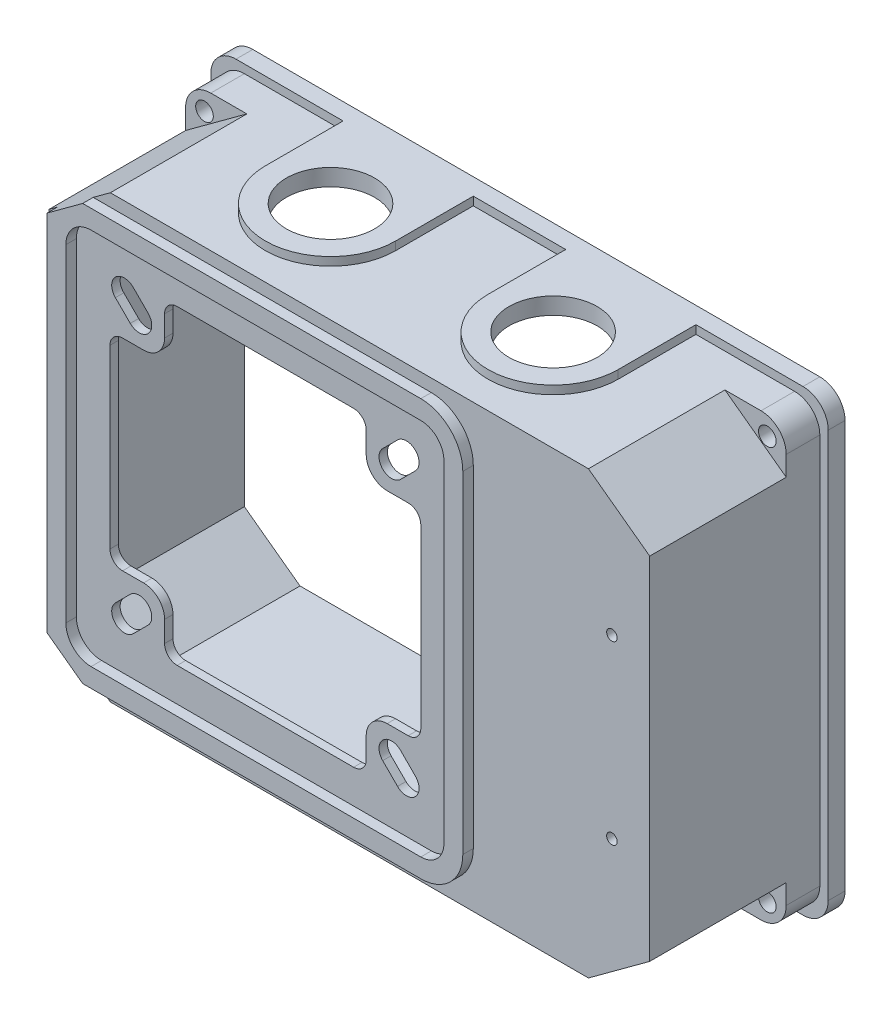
ISO-10303-21;
HEADER;
FILE_DESCRIPTION(('STEP AP214'),'2;1');
FILE_NAME('part.step','',(''),(''),'','','');
FILE_SCHEMA(('AUTOMOTIVE_DESIGN { 1 0 10303 214 1 1 1 1 }'));
ENDSEC;
DATA;
#1=APPLICATION_CONTEXT('core data for automotive mechanical design processes');
#2=APPLICATION_PROTOCOL_DEFINITION('international standard','automotive_design',2000,#1);
#3=PRODUCT_CONTEXT('',#1,'mechanical');
#4=PRODUCT('Part','Part','',(#3));
#5=PRODUCT_RELATED_PRODUCT_CATEGORY('part','',(#4));
#6=PRODUCT_DEFINITION_FORMATION('','',#4);
#7=PRODUCT_DEFINITION_CONTEXT('part definition',#1,'design');
#8=PRODUCT_DEFINITION('design','',#6,#7);
#9=PRODUCT_DEFINITION_SHAPE('','',#8);
#10=(LENGTH_UNIT() NAMED_UNIT(*) SI_UNIT(.MILLI.,.METRE.));
#11=(NAMED_UNIT(*) PLANE_ANGLE_UNIT() SI_UNIT($,.RADIAN.));
#12=(NAMED_UNIT(*) SI_UNIT($,.STERADIAN.) SOLID_ANGLE_UNIT());
#13=UNCERTAINTY_MEASURE_WITH_UNIT(LENGTH_MEASURE(1.E-05),#10,'distance_accuracy_value','');
#14=(GEOMETRIC_REPRESENTATION_CONTEXT(3) GLOBAL_UNCERTAINTY_ASSIGNED_CONTEXT((#13)) GLOBAL_UNIT_ASSIGNED_CONTEXT((#10,
#11,#12)) REPRESENTATION_CONTEXT('',''));
#15=CARTESIAN_POINT('',(0.,0.,0.));
#16=DIRECTION('',(0.,0.,1.));
#17=DIRECTION('',(1.,0.,0.));
#18=AXIS2_PLACEMENT_3D('',#15,#16,#17);
#19=CARTESIAN_POINT('',(0.,0.,0.));
#20=DIRECTION('',(0.,0.,-1.));
#21=DIRECTION('',(-1.,0.,0.));
#22=AXIS2_PLACEMENT_3D('',#19,#20,#21);
#23=PLANE('',#22);
#24=DIRECTION('',(0.,-1.,0.));
#25=VECTOR('',#24,1.);
#26=CARTESIAN_POINT('',(11.,0.,0.));
#27=LINE('',#26,#25);
#28=CARTESIAN_POINT('',(11.,-52.5,0.));
#29=VERTEX_POINT('',#28);
#30=CARTESIAN_POINT('',(11.,-54.5,0.));
#31=VERTEX_POINT('',#30);
#32=EDGE_CURVE('E838',#29,#31,#27,.T.);
#33=ORIENTED_EDGE('',*,*,#32,.F.);
#34=DIRECTION('',(1.,0.,0.));
#35=VECTOR('',#34,1.);
#36=CARTESIAN_POINT('',(-60.2896406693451,-52.5,0.));
#37=LINE('',#36,#35);
#38=CARTESIAN_POINT('',(-11.,-52.5,0.));
#39=VERTEX_POINT('',#38);
#40=EDGE_CURVE('E1673',#39,#29,#37,.T.);
#41=ORIENTED_EDGE('',*,*,#40,.F.);
#42=DIRECTION('',(0.,1.,0.));
#43=VECTOR('',#42,1.);
#44=CARTESIAN_POINT('',(-11.,0.,0.));
#45=LINE('',#44,#43);
#46=CARTESIAN_POINT('',(-10.9999999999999,-54.5,0.));
#47=VERTEX_POINT('',#46);
#48=EDGE_CURVE('E852',#47,#39,#45,.T.);
#49=ORIENTED_EDGE('',*,*,#48,.F.);
#50=DIRECTION('',(-1.,0.,0.));
#51=VECTOR('',#50,1.);
#52=CARTESIAN_POINT('',(73.5,-54.5,0.));
#53=LINE('',#52,#51);
#54=EDGE_CURVE('E1619',#31,#47,#53,.T.);
#55=ORIENTED_EDGE('',*,*,#54,.F.);
#56=EDGE_LOOP('',(#33,#41,#49,#55));
#57=FACE_BOUND('',#56,.T.);
#58=ADVANCED_FACE('F38',(#57),#23,.F.);
#59=DIRECTION('',(0.,1.,0.));
#60=VECTOR('',#59,1.);
#61=CARTESIAN_POINT('',(42.,0.,0.));
#62=LINE('',#61,#60);
#63=CARTESIAN_POINT('',(42.,-54.5,0.));
#64=VERTEX_POINT('',#63);
#65=CARTESIAN_POINT('',(42.,-52.5,0.));
#66=VERTEX_POINT('',#65);
#67=EDGE_CURVE('E824',#64,#66,#62,.T.);
#68=ORIENTED_EDGE('',*,*,#67,.F.);
#69=CARTESIAN_POINT('',(67.5,-54.5,0.));
#70=VERTEX_POINT('',#69);
#71=EDGE_CURVE('E1615',#70,#64,#53,.T.);
#72=ORIENTED_EDGE('',*,*,#71,.F.);
#73=CARTESIAN_POINT('',(67.5,-48.5,0.));
#74=DIRECTION('',(0.,0.,-1.));
#75=DIRECTION('',(-1.,0.,0.));
#76=AXIS2_PLACEMENT_3D('',#73,#74,#75);
#77=CIRCLE('',#76,6.);
#78=CARTESIAN_POINT('',(73.5,-48.5,0.));
#79=VERTEX_POINT('',#78);
#80=EDGE_CURVE('E1719',#70,#79,#77,.F.);
#81=ORIENTED_EDGE('',*,*,#80,.T.);
#82=DIRECTION('',(0.,-1.,0.));
#83=VECTOR('',#82,1.);
#84=CARTESIAN_POINT('',(73.5,54.5,0.));
#85=LINE('',#84,#83);
#86=CARTESIAN_POINT('',(73.5,48.5,0.));
#87=VERTEX_POINT('',#86);
#88=EDGE_CURVE('E1599',#87,#79,#85,.T.);
#89=ORIENTED_EDGE('',*,*,#88,.F.);
#90=CARTESIAN_POINT('',(67.5,48.5,0.));
#91=DIRECTION('',(0.,0.,-1.));
#92=DIRECTION('',(-1.,0.,0.));
#93=AXIS2_PLACEMENT_3D('',#90,#91,#92);
#94=CIRCLE('',#93,6.);
#95=CARTESIAN_POINT('',(67.5,54.5,0.));
#96=VERTEX_POINT('',#95);
#97=EDGE_CURVE('E1726',#87,#96,#94,.F.);
#98=ORIENTED_EDGE('',*,*,#97,.T.);
#99=DIRECTION('',(1.,0.,0.));
#100=VECTOR('',#99,1.);
#101=CARTESIAN_POINT('',(-73.5,54.5,0.));
#102=LINE('',#101,#100);
#103=CARTESIAN_POINT('',(42.,54.5,0.));
#104=VERTEX_POINT('',#103);
#105=EDGE_CURVE('E1622',#104,#96,#102,.T.);
#106=ORIENTED_EDGE('',*,*,#105,.F.);
#107=DIRECTION('',(0.,1.,0.));
#108=VECTOR('',#107,1.);
#109=CARTESIAN_POINT('',(42.,0.,0.));
#110=LINE('',#109,#108);
#111=CARTESIAN_POINT('',(42.,52.5,0.));
#112=VERTEX_POINT('',#111);
#113=EDGE_CURVE('E926',#112,#104,#110,.T.);
#114=ORIENTED_EDGE('',*,*,#113,.F.);
#115=DIRECTION('',(-1.,0.,0.));
#116=VECTOR('',#115,1.);
#117=CARTESIAN_POINT('',(-60.2896406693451,52.5,0.));
#118=LINE('',#117,#116);
#119=CARTESIAN_POINT('',(65.5,52.5,0.));
#120=VERTEX_POINT('',#119);
#121=EDGE_CURVE('E1663',#120,#112,#118,.T.);
#122=ORIENTED_EDGE('',*,*,#121,.F.);
#123=CARTESIAN_POINT('',(65.5,46.5,0.));
#124=DIRECTION('',(0.,0.,-1.));
#125=DIRECTION('',(-1.,0.,0.));
#126=AXIS2_PLACEMENT_3D('',#123,#124,#125);
#127=CIRCLE('',#126,6.);
#128=CARTESIAN_POINT('',(71.5,46.5,0.));
#129=VERTEX_POINT('',#128);
#130=EDGE_CURVE('E1706',#120,#129,#127,.T.);
#131=ORIENTED_EDGE('',*,*,#130,.T.);
#132=DIRECTION('',(0.,1.,0.));
#133=VECTOR('',#132,1.);
#134=CARTESIAN_POINT('',(71.5,-44.268617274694,0.));
#135=LINE('',#134,#133);
#136=CARTESIAN_POINT('',(71.5,-46.5,0.));
#137=VERTEX_POINT('',#136);
#138=EDGE_CURVE('E1653',#137,#129,#135,.T.);
#139=ORIENTED_EDGE('',*,*,#138,.F.);
#140=CARTESIAN_POINT('',(65.5,-46.5,0.));
#141=DIRECTION('',(0.,0.,-1.));
#142=DIRECTION('',(-1.,0.,0.));
#143=AXIS2_PLACEMENT_3D('',#140,#141,#142);
#144=CIRCLE('',#143,6.);
#145=CARTESIAN_POINT('',(65.5,-52.5,0.));
#146=VERTEX_POINT('',#145);
#147=EDGE_CURVE('E1703',#137,#146,#144,.T.);
#148=ORIENTED_EDGE('',*,*,#147,.T.);
#149=EDGE_CURVE('E1669',#66,#146,#37,.T.);
#150=ORIENTED_EDGE('',*,*,#149,.F.);
#151=EDGE_LOOP('',(#68,#72,#81,#89,#98,#106,#114,#122,#131,#139,#148,#150));
#152=FACE_BOUND('',#151,.T.);
#153=ADVANCED_FACE('F1875',(#152),#23,.F.);
#154=CARTESIAN_POINT('',(-60.2896406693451,-52.5,40.5));
#155=DIRECTION('',(0.,1.,0.));
#156=DIRECTION('',(0.,0.,1.));
#157=AXIS2_PLACEMENT_3D('',#154,#155,#156);
#158=PLANE('',#157);
#159=DIRECTION('',(0.,0.,-1.));
#160=VECTOR('',#159,1.);
#161=CARTESIAN_POINT('',(11.,-52.5,-4.));
#162=LINE('',#161,#160);
#163=CARTESIAN_POINT('',(11.,-52.5,18.5));
#164=VERTEX_POINT('',#163);
#165=EDGE_CURVE('E55',#164,#29,#162,.T.);
#166=ORIENTED_EDGE('',*,*,#165,.F.);
#167=CARTESIAN_POINT('',(26.5,-52.5,18.5));
#168=DIRECTION('',(0.,-1.,0.));
#169=DIRECTION('',(0.,0.,-1.));
#170=AXIS2_PLACEMENT_3D('',#167,#168,#169);
#171=CIRCLE('',#170,15.5);
#172=CARTESIAN_POINT('',(42.,-52.5,18.5));
#173=VERTEX_POINT('',#172);
#174=EDGE_CURVE('E811',#173,#164,#171,.T.);
#175=ORIENTED_EDGE('',*,*,#174,.F.);
#176=DIRECTION('',(0.,0.,1.));
#177=VECTOR('',#176,1.);
#178=CARTESIAN_POINT('',(42.,-52.5,-4.));
#179=LINE('',#178,#177);
#180=EDGE_CURVE('E61',#66,#173,#179,.T.);
#181=ORIENTED_EDGE('',*,*,#180,.F.);
#182=ORIENTED_EDGE('',*,*,#149,.T.);
#183=DIRECTION('',(0.,0.,-1.));
#184=VECTOR('',#183,1.);
#185=CARTESIAN_POINT('',(65.5,-52.5,40.5));
#186=LINE('',#185,#184);
#187=CARTESIAN_POINT('',(65.5,-52.5,8.));
#188=VERTEX_POINT('',#187);
#189=EDGE_CURVE('E1683',#146,#188,#186,.F.);
#190=ORIENTED_EDGE('',*,*,#189,.T.);
#191=DIRECTION('',(-1.,0.,0.));
#192=VECTOR('',#191,1.);
#193=CARTESIAN_POINT('',(71.5,-52.5,8.));
#194=LINE('',#193,#192);
#195=CARTESIAN_POINT('',(56.9104191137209,-52.5,8.));
#196=VERTEX_POINT('',#195);
#197=EDGE_CURVE('E1633',#188,#196,#194,.T.);
#198=ORIENTED_EDGE('',*,*,#197,.T.);
#199=DIRECTION('',(0.,0.,-1.));
#200=VECTOR('',#199,1.);
#201=CARTESIAN_POINT('',(56.9104191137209,-52.5,58.6001739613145));
#202=LINE('',#201,#200);
#203=CARTESIAN_POINT('',(56.9104191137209,-52.5,40.5));
#204=VERTEX_POINT('',#203);
#205=EDGE_CURVE('E1372',#204,#196,#202,.T.);
#206=ORIENTED_EDGE('',*,*,#205,.F.);
#207=DIRECTION('',(1.,0.,0.));
#208=VECTOR('',#207,1.);
#209=CARTESIAN_POINT('',(-60.2896406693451,-52.5,40.5));
#210=LINE('',#209,#208);
#211=CARTESIAN_POINT('',(-56.9104191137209,-52.5,40.5));
#212=VERTEX_POINT('',#211);
#213=EDGE_CURVE('E1656',#212,#204,#210,.T.);
#214=ORIENTED_EDGE('',*,*,#213,.F.);
#215=DIRECTION('',(0.,0.,-1.));
#216=VECTOR('',#215,1.);
#217=CARTESIAN_POINT('',(-56.9104191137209,-52.5,61.1001739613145));
#218=LINE('',#217,#216);
#219=CARTESIAN_POINT('',(-56.9104191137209,-52.5,8.));
#220=VERTEX_POINT('',#219);
#221=EDGE_CURVE('E1437',#212,#220,#218,.T.);
#222=ORIENTED_EDGE('',*,*,#221,.T.);
#223=CARTESIAN_POINT('',(-65.5,-52.5,8.));
#224=VERTEX_POINT('',#223);
#225=EDGE_CURVE('E1632',#220,#224,#194,.T.);
#226=ORIENTED_EDGE('',*,*,#225,.T.);
#227=DIRECTION('',(0.,0.,-1.));
#228=VECTOR('',#227,1.);
#229=CARTESIAN_POINT('',(-65.5,-52.5,40.5));
#230=LINE('',#229,#228);
#231=CARTESIAN_POINT('',(-65.5,-52.5,0.));
#232=VERTEX_POINT('',#231);
#233=EDGE_CURVE('E1680',#224,#232,#230,.T.);
#234=ORIENTED_EDGE('',*,*,#233,.T.);
#235=CARTESIAN_POINT('',(-42.,-52.5,0.));
#236=VERTEX_POINT('',#235);
#237=EDGE_CURVE('E1670',#232,#236,#37,.T.);
#238=ORIENTED_EDGE('',*,*,#237,.T.);
#239=DIRECTION('',(0.,0.,-1.));
#240=VECTOR('',#239,1.);
#241=CARTESIAN_POINT('',(-42.,-52.5,-4.00000000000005));
#242=LINE('',#241,#240);
#243=CARTESIAN_POINT('',(-42.,-52.5,18.5));
#244=VERTEX_POINT('',#243);
#245=EDGE_CURVE('E858',#244,#236,#242,.T.);
#246=ORIENTED_EDGE('',*,*,#245,.F.);
#247=CARTESIAN_POINT('',(-26.5,-52.5,18.5));
#248=DIRECTION('',(0.,-1.,0.));
#249=DIRECTION('',(0.,0.,1.));
#250=AXIS2_PLACEMENT_3D('',#247,#248,#249);
#251=CIRCLE('',#250,15.5);
#252=CARTESIAN_POINT('',(-11.,-52.5,18.5));
#253=VERTEX_POINT('',#252);
#254=EDGE_CURVE('E855',#253,#244,#251,.T.);
#255=ORIENTED_EDGE('',*,*,#254,.F.);
#256=DIRECTION('',(0.,0.,1.));
#257=VECTOR('',#256,1.);
#258=CARTESIAN_POINT('',(-11.,-52.5,-4.00000000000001));
#259=LINE('',#258,#257);
#260=EDGE_CURVE('E842',#39,#253,#259,.T.);
#261=ORIENTED_EDGE('',*,*,#260,.F.);
#262=ORIENTED_EDGE('',*,*,#40,.T.);
#263=EDGE_LOOP('',(#166,#175,#181,#182,#190,#198,#206,#214,#222,#226,#234,#238,#246,#255,#261,#262));
#264=FACE_BOUND('',#263,.T.);
#265=ADVANCED_FACE('F812',(#264),#158,.F.);
#266=DIRECTION('',(0.,-1.,0.));
#267=VECTOR('',#266,1.);
#268=CARTESIAN_POINT('',(-42.,0.,0.));
#269=LINE('',#268,#267);
#270=CARTESIAN_POINT('',(-41.9999999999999,-54.5,0.));
#271=VERTEX_POINT('',#270);
#272=EDGE_CURVE('E868',#236,#271,#269,.T.);
#273=ORIENTED_EDGE('',*,*,#272,.F.);
#274=ORIENTED_EDGE('',*,*,#237,.F.);
#275=CARTESIAN_POINT('',(-65.5,-46.5,0.));
#276=DIRECTION('',(0.,0.,-1.));
#277=DIRECTION('',(-1.,0.,0.));
#278=AXIS2_PLACEMENT_3D('',#275,#276,#277);
#279=CIRCLE('',#278,6.);
#280=CARTESIAN_POINT('',(-71.5,-46.5,0.));
#281=VERTEX_POINT('',#280);
#282=EDGE_CURVE('E1711',#232,#281,#279,.T.);
#283=ORIENTED_EDGE('',*,*,#282,.T.);
#284=DIRECTION('',(0.,-1.,0.));
#285=VECTOR('',#284,1.);
#286=CARTESIAN_POINT('',(-71.5,-44.268617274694,0.));
#287=LINE('',#286,#285);
#288=CARTESIAN_POINT('',(-71.5,46.5,0.));
#289=VERTEX_POINT('',#288);
#290=EDGE_CURVE('E1666',#289,#281,#287,.T.);
#291=ORIENTED_EDGE('',*,*,#290,.F.);
#292=CARTESIAN_POINT('',(-65.5,46.5,0.));
#293=DIRECTION('',(0.,0.,-1.));
#294=DIRECTION('',(-1.,0.,0.));
#295=AXIS2_PLACEMENT_3D('',#292,#293,#294);
#296=CIRCLE('',#295,6.);
#297=CARTESIAN_POINT('',(-65.5,52.5,0.));
#298=VERTEX_POINT('',#297);
#299=EDGE_CURVE('E1708',#289,#298,#296,.T.);
#300=ORIENTED_EDGE('',*,*,#299,.T.);
#301=CARTESIAN_POINT('',(-42.,52.5,0.));
#302=VERTEX_POINT('',#301);
#303=EDGE_CURVE('E1649',#302,#298,#118,.T.);
#304=ORIENTED_EDGE('',*,*,#303,.F.);
#305=DIRECTION('',(0.,-1.,0.));
#306=VECTOR('',#305,1.);
#307=CARTESIAN_POINT('',(-42.,0.,0.));
#308=LINE('',#307,#306);
#309=CARTESIAN_POINT('',(-42.,54.5,0.));
#310=VERTEX_POINT('',#309);
#311=EDGE_CURVE('E889',#310,#302,#308,.T.);
#312=ORIENTED_EDGE('',*,*,#311,.F.);
#313=CARTESIAN_POINT('',(-67.5,54.5,0.));
#314=VERTEX_POINT('',#313);
#315=EDGE_CURVE('E1604',#314,#310,#102,.T.);
#316=ORIENTED_EDGE('',*,*,#315,.F.);
#317=CARTESIAN_POINT('',(-67.5,48.5,0.));
#318=DIRECTION('',(0.,0.,-1.));
#319=DIRECTION('',(-1.,0.,0.));
#320=AXIS2_PLACEMENT_3D('',#317,#318,#319);
#321=CIRCLE('',#320,6.);
#322=CARTESIAN_POINT('',(-73.5,48.5,0.));
#323=VERTEX_POINT('',#322);
#324=EDGE_CURVE('E1724',#314,#323,#321,.F.);
#325=ORIENTED_EDGE('',*,*,#324,.T.);
#326=DIRECTION('',(0.,1.,0.));
#327=VECTOR('',#326,1.);
#328=CARTESIAN_POINT('',(-73.5,-54.5,0.));
#329=LINE('',#328,#327);
#330=CARTESIAN_POINT('',(-73.5,-48.5,0.));
#331=VERTEX_POINT('',#330);
#332=EDGE_CURVE('E1618',#331,#323,#329,.T.);
#333=ORIENTED_EDGE('',*,*,#332,.F.);
#334=CARTESIAN_POINT('',(-67.5,-48.5,0.));
#335=DIRECTION('',(0.,0.,-1.));
#336=DIRECTION('',(-1.,0.,0.));
#337=AXIS2_PLACEMENT_3D('',#334,#335,#336);
#338=CIRCLE('',#337,6.);
#339=CARTESIAN_POINT('',(-67.5,-54.5,0.));
#340=VERTEX_POINT('',#339);
#341=EDGE_CURVE('E1721',#331,#340,#338,.F.);
#342=ORIENTED_EDGE('',*,*,#341,.T.);
#343=EDGE_CURVE('E1614',#271,#340,#53,.T.);
#344=ORIENTED_EDGE('',*,*,#343,.F.);
#345=EDGE_LOOP('',(#273,#274,#283,#291,#300,#304,#312,#316,#325,#333,#342,#344));
#346=FACE_BOUND('',#345,.T.);
#347=ADVANCED_FACE('F1916',(#346),#23,.F.);
#348=CARTESIAN_POINT('',(-73.5,54.5,-4.));
#349=DIRECTION('',(0.,-1.,0.));
#350=DIRECTION('',(1.,0.,0.));
#351=AXIS2_PLACEMENT_3D('',#348,#349,#350);
#352=PLANE('',#351);
#353=CARTESIAN_POINT('',(26.5,54.5,18.5));
#354=DIRECTION('',(0.,1.,0.));
#355=DIRECTION('',(0.,0.,1.));
#356=AXIS2_PLACEMENT_3D('',#353,#354,#355);
#357=CIRCLE('',#356,10.5);
#358=CARTESIAN_POINT('',(26.5,54.5,29.));
#359=VERTEX_POINT('',#358);
#360=EDGE_CURVE('E871',#359,#359,#357,.T.);
#361=ORIENTED_EDGE('',*,*,#360,.F.);
#362=EDGE_LOOP('',(#361));
#363=FACE_BOUND('',#362,.T.);
#364=ORIENTED_EDGE('',*,*,#315,.T.);
#365=DIRECTION('',(0.,0.,-1.));
#366=VECTOR('',#365,1.);
#367=CARTESIAN_POINT('',(-42.,54.5,-4.));
#368=LINE('',#367,#366);
#369=CARTESIAN_POINT('',(-42.,54.5,18.5));
#370=VERTEX_POINT('',#369);
#371=EDGE_CURVE('E887',#370,#310,#368,.T.);
#372=ORIENTED_EDGE('',*,*,#371,.F.);
#373=CARTESIAN_POINT('',(-26.5,54.5,18.5));
#374=DIRECTION('',(0.,-1.,0.));
#375=DIRECTION('',(1.,0.,0.));
#376=AXIS2_PLACEMENT_3D('',#373,#374,#375);
#377=CIRCLE('',#376,15.5);
#378=CARTESIAN_POINT('',(-11.,54.5,18.5));
#379=VERTEX_POINT('',#378);
#380=EDGE_CURVE('E883',#379,#370,#377,.T.);
#381=ORIENTED_EDGE('',*,*,#380,.F.);
#382=DIRECTION('',(0.,0.,1.));
#383=VECTOR('',#382,1.);
#384=CARTESIAN_POINT('',(-11.,54.5,-4.));
#385=LINE('',#384,#383);
#386=CARTESIAN_POINT('',(-11.,54.5,0.));
#387=VERTEX_POINT('',#386);
#388=EDGE_CURVE('E881',#387,#379,#385,.T.);
#389=ORIENTED_EDGE('',*,*,#388,.F.);
#390=CARTESIAN_POINT('',(11.,54.5,0.));
#391=VERTEX_POINT('',#390);
#392=EDGE_CURVE('E1625',#387,#391,#102,.T.);
#393=ORIENTED_EDGE('',*,*,#392,.T.);
#394=DIRECTION('',(0.,0.,-1.));
#395=VECTOR('',#394,1.);
#396=CARTESIAN_POINT('',(11.,54.5,-4.00000000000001));
#397=LINE('',#396,#395);
#398=CARTESIAN_POINT('',(11.,54.5,18.5));
#399=VERTEX_POINT('',#398);
#400=EDGE_CURVE('E908',#399,#391,#397,.T.);
#401=ORIENTED_EDGE('',*,*,#400,.F.);
#402=CARTESIAN_POINT('',(26.5,54.5,18.5));
#403=DIRECTION('',(0.,-1.,0.));
#404=DIRECTION('',(1.,0.,0.));
#405=AXIS2_PLACEMENT_3D('',#402,#403,#404);
#406=CIRCLE('',#405,15.5);
#407=CARTESIAN_POINT('',(42.,54.5,18.5));
#408=VERTEX_POINT('',#407);
#409=EDGE_CURVE('E905',#408,#399,#406,.T.);
#410=ORIENTED_EDGE('',*,*,#409,.F.);
#411=DIRECTION('',(0.,0.,1.));
#412=VECTOR('',#411,1.);
#413=CARTESIAN_POINT('',(42.,54.5,-4.00000000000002));
#414=LINE('',#413,#412);
#415=EDGE_CURVE('E909',#104,#408,#414,.T.);
#416=ORIENTED_EDGE('',*,*,#415,.F.);
#417=ORIENTED_EDGE('',*,*,#105,.T.);
#418=DIRECTION('',(0.,0.,1.));
#419=VECTOR('',#418,1.);
#420=CARTESIAN_POINT('',(67.5,54.5,-4.));
#421=LINE('',#420,#419);
#422=CARTESIAN_POINT('',(67.5,54.5,-4.));
#423=VERTEX_POINT('',#422);
#424=EDGE_CURVE('E1732',#96,#423,#421,.F.);
#425=ORIENTED_EDGE('',*,*,#424,.T.);
#426=DIRECTION('',(1.,0.,0.));
#427=VECTOR('',#426,1.);
#428=CARTESIAN_POINT('',(-73.5,54.5,-4.));
#429=LINE('',#428,#427);
#430=CARTESIAN_POINT('',(-67.5,54.5,-4.));
#431=VERTEX_POINT('',#430);
#432=EDGE_CURVE('E1609',#431,#423,#429,.T.);
#433=ORIENTED_EDGE('',*,*,#432,.F.);
#434=DIRECTION('',(0.,0.,1.));
#435=VECTOR('',#434,1.);
#436=CARTESIAN_POINT('',(-67.5,54.5,-4.));
#437=LINE('',#436,#435);
#438=EDGE_CURVE('E1729',#431,#314,#437,.T.);
#439=ORIENTED_EDGE('',*,*,#438,.T.);
#440=EDGE_LOOP('',(#364,#372,#381,#389,#393,#401,#410,#416,#417,#425,#433,#439));
#441=FACE_BOUND('',#440,.T.);
#442=CARTESIAN_POINT('',(-26.5,54.5,18.5));
#443=DIRECTION('',(0.,1.,0.));
#444=DIRECTION('',(0.,0.,1.));
#445=AXIS2_PLACEMENT_3D('',#442,#443,#444);
#446=CIRCLE('',#445,10.5);
#447=CARTESIAN_POINT('',(-26.5,54.5,29.));
#448=VERTEX_POINT('',#447);
#449=EDGE_CURVE('E874',#448,#448,#446,.T.);
#450=ORIENTED_EDGE('',*,*,#449,.F.);
#451=EDGE_LOOP('',(#450));
#452=FACE_BOUND('',#451,.T.);
#453=ADVANCED_FACE('F1992',(#363,#441,#452),#352,.F.);
#454=CARTESIAN_POINT('',(-60.2896406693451,52.5,40.5));
#455=DIRECTION('',(0.,-1.,0.));
#456=DIRECTION('',(0.,0.,-1.));
#457=AXIS2_PLACEMENT_3D('',#454,#455,#456);
#458=PLANE('',#457);
#459=DIRECTION('',(0.,0.,-1.));
#460=VECTOR('',#459,1.);
#461=CARTESIAN_POINT('',(-11.,52.5,-4.));
#462=LINE('',#461,#460);
#463=CARTESIAN_POINT('',(-11.,52.5,18.5));
#464=VERTEX_POINT('',#463);
#465=CARTESIAN_POINT('',(-11.,52.5,0.));
#466=VERTEX_POINT('',#465);
#467=EDGE_CURVE('E894',#464,#466,#462,.T.);
#468=ORIENTED_EDGE('',*,*,#467,.F.);
#469=CARTESIAN_POINT('',(-26.5,52.5,18.5));
#470=DIRECTION('',(0.,1.,0.));
#471=DIRECTION('',(0.,0.,1.));
#472=AXIS2_PLACEMENT_3D('',#469,#470,#471);
#473=CIRCLE('',#472,15.5);
#474=CARTESIAN_POINT('',(-42.,52.5,18.5));
#475=VERTEX_POINT('',#474);
#476=EDGE_CURVE('E891',#475,#464,#473,.T.);
#477=ORIENTED_EDGE('',*,*,#476,.F.);
#478=DIRECTION('',(0.,0.,1.));
#479=VECTOR('',#478,1.);
#480=CARTESIAN_POINT('',(-42.,52.5,-4.));
#481=LINE('',#480,#479);
#482=EDGE_CURVE('E880',#302,#475,#481,.T.);
#483=ORIENTED_EDGE('',*,*,#482,.F.);
#484=ORIENTED_EDGE('',*,*,#303,.T.);
#485=DIRECTION('',(0.,0.,-1.));
#486=VECTOR('',#485,1.);
#487=CARTESIAN_POINT('',(-65.5,52.5,40.5));
#488=LINE('',#487,#486);
#489=CARTESIAN_POINT('',(-65.5,52.5,8.));
#490=VERTEX_POINT('',#489);
#491=EDGE_CURVE('E1687',#298,#490,#488,.F.);
#492=ORIENTED_EDGE('',*,*,#491,.T.);
#493=DIRECTION('',(1.,0.,0.));
#494=VECTOR('',#493,1.);
#495=CARTESIAN_POINT('',(-71.5,52.5,8.));
#496=LINE('',#495,#494);
#497=CARTESIAN_POINT('',(-56.9104191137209,52.5,8.));
#498=VERTEX_POINT('',#497);
#499=EDGE_CURVE('E1626',#490,#498,#496,.T.);
#500=ORIENTED_EDGE('',*,*,#499,.T.);
#501=DIRECTION('',(0.,0.,-1.));
#502=VECTOR('',#501,1.);
#503=CARTESIAN_POINT('',(-56.9104191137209,52.5,61.1001739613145));
#504=LINE('',#503,#502);
#505=CARTESIAN_POINT('',(-56.9104191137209,52.5,40.5));
#506=VERTEX_POINT('',#505);
#507=EDGE_CURVE('E1454',#506,#498,#504,.T.);
#508=ORIENTED_EDGE('',*,*,#507,.F.);
#509=DIRECTION('',(-1.,0.,0.));
#510=VECTOR('',#509,1.);
#511=CARTESIAN_POINT('',(-60.2896406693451,52.5,40.5));
#512=LINE('',#511,#510);
#513=CARTESIAN_POINT('',(56.9104191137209,52.5,40.5));
#514=VERTEX_POINT('',#513);
#515=EDGE_CURVE('E1650',#514,#506,#512,.T.);
#516=ORIENTED_EDGE('',*,*,#515,.F.);
#517=DIRECTION('',(0.,0.,-1.));
#518=VECTOR('',#517,1.);
#519=CARTESIAN_POINT('',(56.9104191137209,52.5,58.6001739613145));
#520=LINE('',#519,#518);
#521=CARTESIAN_POINT('',(56.9104191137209,52.5,8.));
#522=VERTEX_POINT('',#521);
#523=EDGE_CURVE('E1322',#514,#522,#520,.T.);
#524=ORIENTED_EDGE('',*,*,#523,.T.);
#525=CARTESIAN_POINT('',(65.5,52.5,8.));
#526=VERTEX_POINT('',#525);
#527=EDGE_CURVE('E1611',#522,#526,#496,.T.);
#528=ORIENTED_EDGE('',*,*,#527,.T.);
#529=DIRECTION('',(0.,0.,-1.));
#530=VECTOR('',#529,1.);
#531=CARTESIAN_POINT('',(65.5,52.5,40.5));
#532=LINE('',#531,#530);
#533=EDGE_CURVE('E1689',#526,#120,#532,.T.);
#534=ORIENTED_EDGE('',*,*,#533,.T.);
#535=ORIENTED_EDGE('',*,*,#121,.T.);
#536=DIRECTION('',(0.,0.,-1.));
#537=VECTOR('',#536,1.);
#538=CARTESIAN_POINT('',(42.,52.5,-4.00000000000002));
#539=LINE('',#538,#537);
#540=CARTESIAN_POINT('',(42.,52.5,18.5));
#541=VERTEX_POINT('',#540);
#542=EDGE_CURVE('E917',#541,#112,#539,.T.);
#543=ORIENTED_EDGE('',*,*,#542,.F.);
#544=CARTESIAN_POINT('',(26.5,52.5,18.5));
#545=DIRECTION('',(0.,1.,0.));
#546=DIRECTION('',(0.,0.,-1.));
#547=AXIS2_PLACEMENT_3D('',#544,#545,#546);
#548=CIRCLE('',#547,15.5);
#549=CARTESIAN_POINT('',(11.,52.5,18.5));
#550=VERTEX_POINT('',#549);
#551=EDGE_CURVE('E914',#550,#541,#548,.T.);
#552=ORIENTED_EDGE('',*,*,#551,.F.);
#553=DIRECTION('',(0.,0.,1.));
#554=VECTOR('',#553,1.);
#555=CARTESIAN_POINT('',(11.,52.5,-4.00000000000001));
#556=LINE('',#555,#554);
#557=CARTESIAN_POINT('',(11.,52.5,0.));
#558=VERTEX_POINT('',#557);
#559=EDGE_CURVE('E904',#558,#550,#556,.T.);
#560=ORIENTED_EDGE('',*,*,#559,.F.);
#561=EDGE_CURVE('E1667',#558,#466,#118,.T.);
#562=ORIENTED_EDGE('',*,*,#561,.T.);
#563=EDGE_LOOP('',(#468,#477,#483,#484,#492,#500,#508,#516,#524,#528,#534,#535,#543,#552,#560,#562));
#564=FACE_BOUND('',#563,.T.);
#565=ADVANCED_FACE('F1890',(#564),#458,.F.);
#566=DIRECTION('',(0.,1.,0.));
#567=VECTOR('',#566,1.);
#568=CARTESIAN_POINT('',(-11.,0.,0.));
#569=LINE('',#568,#567);
#570=EDGE_CURVE('E901',#466,#387,#569,.T.);
#571=ORIENTED_EDGE('',*,*,#570,.F.);
#572=ORIENTED_EDGE('',*,*,#561,.F.);
#573=DIRECTION('',(0.,-1.,0.));
#574=VECTOR('',#573,1.);
#575=CARTESIAN_POINT('',(11.,0.,0.));
#576=LINE('',#575,#574);
#577=EDGE_CURVE('E912',#391,#558,#576,.T.);
#578=ORIENTED_EDGE('',*,*,#577,.F.);
#579=ORIENTED_EDGE('',*,*,#392,.F.);
#580=EDGE_LOOP('',(#571,#572,#578,#579));
#581=FACE_BOUND('',#580,.T.);
#582=ADVANCED_FACE('F1979',(#581),#23,.F.);
#583=CARTESIAN_POINT('',(0.,0.,38.5));
#584=DIRECTION('',(0.,0.,1.));
#585=DIRECTION('',(1.,0.,0.));
#586=AXIS2_PLACEMENT_3D('',#583,#584,#585);
#587=PLANE('',#586);
#588=CARTESIAN_POINT('',(62.5,-21.,38.5));
#589=DIRECTION('',(0.,0.,1.));
#590=DIRECTION('',(1.,0.,0.));
#591=AXIS2_PLACEMENT_3D('',#588,#589,#590);
#592=CIRCLE('',#591,3.5);
#593=CARTESIAN_POINT('',(66.,-21.,38.5));
#594=VERTEX_POINT('',#593);
#595=EDGE_CURVE('E11',#594,#594,#592,.F.);
#596=ORIENTED_EDGE('',*,*,#595,.F.);
#597=EDGE_LOOP('',(#596));
#598=FACE_BOUND('',#597,.T.);
#599=CARTESIAN_POINT('',(62.5,21.,38.5));
#600=DIRECTION('',(0.,0.,1.));
#601=DIRECTION('',(1.,0.,0.));
#602=AXIS2_PLACEMENT_3D('',#599,#600,#601);
#603=CIRCLE('',#602,3.5);
#604=CARTESIAN_POINT('',(66.,21.,38.5));
#605=VERTEX_POINT('',#604);
#606=EDGE_CURVE('E47',#605,#605,#603,.F.);
#607=ORIENTED_EDGE('',*,*,#606,.F.);
#608=EDGE_LOOP('',(#607));
#609=FACE_BOUND('',#608,.T.);
#610=DIRECTION('',(0.806046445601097,-0.591852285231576,0.));
#611=VECTOR('',#610,1.);
#612=CARTESIAN_POINT('',(-53.5311975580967,-52.5,38.5));
#613=LINE('',#612,#611);
#614=CARTESIAN_POINT('',(-69.5,-40.7746555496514,38.5));
#615=VERTEX_POINT('',#614);
#616=CARTESIAN_POINT('',(-56.2550070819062,-50.5,38.5));
#617=VERTEX_POINT('',#616);
#618=EDGE_CURVE('E1376',#615,#617,#613,.T.);
#619=ORIENTED_EDGE('',*,*,#618,.F.);
#620=DIRECTION('',(0.,-1.,0.));
#621=VECTOR('',#620,1.);
#622=CARTESIAN_POINT('',(-69.5,-44.268617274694,38.5));
#623=LINE('',#622,#621);
#624=CARTESIAN_POINT('',(-69.5,40.7746555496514,38.5));
#625=VERTEX_POINT('',#624);
#626=EDGE_CURVE('E1642',#625,#615,#623,.T.);
#627=ORIENTED_EDGE('',*,*,#626,.F.);
#628=DIRECTION('',(-0.806046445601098,-0.591852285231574,0.));
#629=VECTOR('',#628,1.);
#630=CARTESIAN_POINT('',(-69.5,40.7746555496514,38.5));
#631=LINE('',#630,#629);
#632=CARTESIAN_POINT('',(-56.2550070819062,50.5,38.5));
#633=VERTEX_POINT('',#632);
#634=EDGE_CURVE('E1401',#633,#625,#631,.T.);
#635=ORIENTED_EDGE('',*,*,#634,.F.);
#636=DIRECTION('',(-1.,0.,0.));
#637=VECTOR('',#636,1.);
#638=CARTESIAN_POINT('',(-60.2896406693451,50.5,38.5));
#639=LINE('',#638,#637);
#640=CARTESIAN_POINT('',(56.2550070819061,50.5,38.5));
#641=VERTEX_POINT('',#640);
#642=EDGE_CURVE('E1639',#641,#633,#639,.T.);
#643=ORIENTED_EDGE('',*,*,#642,.F.);
#644=DIRECTION('',(-0.806046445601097,0.591852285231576,0.));
#645=VECTOR('',#644,1.);
#646=CARTESIAN_POINT('',(56.2550070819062,50.5,38.5));
#647=LINE('',#646,#645);
#648=CARTESIAN_POINT('',(69.5,40.7746555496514,38.5));
#649=VERTEX_POINT('',#648);
#650=EDGE_CURVE('E1423',#649,#641,#647,.T.);
#651=ORIENTED_EDGE('',*,*,#650,.F.);
#652=DIRECTION('',(0.,1.,0.));
#653=VECTOR('',#652,1.);
#654=CARTESIAN_POINT('',(69.5,-44.268617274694,38.5));
#655=LINE('',#654,#653);
#656=CARTESIAN_POINT('',(69.5,-40.7746555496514,38.5));
#657=VERTEX_POINT('',#656);
#658=EDGE_CURVE('E1647',#657,#649,#655,.T.);
#659=ORIENTED_EDGE('',*,*,#658,.F.);
#660=DIRECTION('',(0.806046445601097,0.591852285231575,0.));
#661=VECTOR('',#660,1.);
#662=CARTESIAN_POINT('',(69.5,-40.7746555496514,38.5));
#663=LINE('',#662,#661);
#664=CARTESIAN_POINT('',(56.2550070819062,-50.5,38.5));
#665=VERTEX_POINT('',#664);
#666=EDGE_CURVE('E1412',#665,#657,#663,.T.);
#667=ORIENTED_EDGE('',*,*,#666,.F.);
#668=DIRECTION('',(1.,0.,0.));
#669=VECTOR('',#668,1.);
#670=CARTESIAN_POINT('',(-60.2896406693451,-50.5,38.5));
#671=LINE('',#670,#669);
#672=EDGE_CURVE('E1645',#617,#665,#671,.T.);
#673=ORIENTED_EDGE('',*,*,#672,.F.);
#674=EDGE_LOOP('',(#619,#627,#635,#643,#651,#659,#667,#673));
#675=FACE_BOUND('',#674,.T.);
#676=DIRECTION('',(1.,0.,0.));
#677=VECTOR('',#676,1.);
#678=CARTESIAN_POINT('',(0.,-24.,38.5));
#679=LINE('',#678,#677);
#680=CARTESIAN_POINT('',(9.00000000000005,-24.,38.5));
#681=VERTEX_POINT('',#680);
#682=CARTESIAN_POINT('',(14.,-24.,38.5));
#683=VERTEX_POINT('',#682);
#684=EDGE_CURVE('E1827',#681,#683,#679,.T.);
#685=ORIENTED_EDGE('',*,*,#684,.T.);
#686=CARTESIAN_POINT('',(14.,-21.,38.5));
#687=DIRECTION('',(0.,0.,1.));
#688=DIRECTION('',(1.,0.,0.));
#689=AXIS2_PLACEMENT_3D('',#686,#687,#688);
#690=CIRCLE('',#689,3.);
#691=CARTESIAN_POINT('',(17.,-21.,38.5));
#692=VERTEX_POINT('',#691);
#693=EDGE_CURVE('E1830',#683,#692,#690,.T.);
#694=ORIENTED_EDGE('',*,*,#693,.T.);
#695=DIRECTION('',(0.,1.,0.));
#696=VECTOR('',#695,1.);
#697=CARTESIAN_POINT('',(17.,0.,38.5));
#698=LINE('',#697,#696);
#699=CARTESIAN_POINT('',(17.,21.,38.5));
#700=VERTEX_POINT('',#699);
#701=EDGE_CURVE('E1761',#692,#700,#698,.T.);
#702=ORIENTED_EDGE('',*,*,#701,.T.);
#703=CARTESIAN_POINT('',(14.,21.,38.5));
#704=DIRECTION('',(0.,0.,1.));
#705=DIRECTION('',(1.,0.,0.));
#706=AXIS2_PLACEMENT_3D('',#703,#704,#705);
#707=CIRCLE('',#706,3.);
#708=CARTESIAN_POINT('',(14.,24.,38.5));
#709=VERTEX_POINT('',#708);
#710=EDGE_CURVE('E1764',#700,#709,#707,.T.);
#711=ORIENTED_EDGE('',*,*,#710,.T.);
#712=DIRECTION('',(-1.,0.,0.));
#713=VECTOR('',#712,1.);
#714=CARTESIAN_POINT('',(0.,24.,38.5));
#715=LINE('',#714,#713);
#716=CARTESIAN_POINT('',(9.00000000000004,24.,38.5));
#717=VERTEX_POINT('',#716);
#718=EDGE_CURVE('E1767',#709,#717,#715,.T.);
#719=ORIENTED_EDGE('',*,*,#718,.T.);
#720=CARTESIAN_POINT('',(9.00000000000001,29.,38.5));
#721=DIRECTION('',(0.,0.,1.));
#722=DIRECTION('',(1.,0.,0.));
#723=AXIS2_PLACEMENT_3D('',#720,#721,#722);
#724=CIRCLE('',#723,5.);
#725=CARTESIAN_POINT('',(4.00000000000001,29.,38.5));
#726=VERTEX_POINT('',#725);
#727=EDGE_CURVE('E1770',#717,#726,#724,.F.);
#728=ORIENTED_EDGE('',*,*,#727,.T.);
#729=DIRECTION('',(0.,1.,0.));
#730=VECTOR('',#729,1.);
#731=CARTESIAN_POINT('',(4.00000000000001,0.,38.5));
#732=LINE('',#731,#730);
#733=CARTESIAN_POINT('',(4.00000000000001,34.,38.5));
#734=VERTEX_POINT('',#733);
#735=EDGE_CURVE('E1773',#726,#734,#732,.T.);
#736=ORIENTED_EDGE('',*,*,#735,.T.);
#737=CARTESIAN_POINT('',(1.00000000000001,34.,38.5));
#738=DIRECTION('',(0.,0.,1.));
#739=DIRECTION('',(1.,0.,0.));
#740=AXIS2_PLACEMENT_3D('',#737,#738,#739);
#741=CIRCLE('',#740,3.);
#742=CARTESIAN_POINT('',(0.999999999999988,37.,38.5));
#743=VERTEX_POINT('',#742);
#744=EDGE_CURVE('E1776',#734,#743,#741,.T.);
#745=ORIENTED_EDGE('',*,*,#744,.T.);
#746=DIRECTION('',(-1.,0.,0.));
#747=VECTOR('',#746,1.);
#748=CARTESIAN_POINT('',(0.,37.,38.5));
#749=LINE('',#748,#747);
#750=CARTESIAN_POINT('',(-41.,37.,38.5));
#751=VERTEX_POINT('',#750);
#752=EDGE_CURVE('E1779',#743,#751,#749,.T.);
#753=ORIENTED_EDGE('',*,*,#752,.T.);
#754=CARTESIAN_POINT('',(-41.,34.,38.5));
#755=DIRECTION('',(0.,0.,1.));
#756=DIRECTION('',(1.,0.,0.));
#757=AXIS2_PLACEMENT_3D('',#754,#755,#756);
#758=CIRCLE('',#757,3.);
#759=CARTESIAN_POINT('',(-44.,34.,38.5));
#760=VERTEX_POINT('',#759);
#761=EDGE_CURVE('E1782',#751,#760,#758,.T.);
#762=ORIENTED_EDGE('',*,*,#761,.T.);
#763=DIRECTION('',(0.,-1.,0.));
#764=VECTOR('',#763,1.);
#765=CARTESIAN_POINT('',(-44.,0.,38.5));
#766=LINE('',#765,#764);
#767=CARTESIAN_POINT('',(-44.,29.,38.5));
#768=VERTEX_POINT('',#767);
#769=EDGE_CURVE('E1785',#760,#768,#766,.T.);
#770=ORIENTED_EDGE('',*,*,#769,.T.);
#771=CARTESIAN_POINT('',(-49.,29.,38.5));
#772=DIRECTION('',(0.,0.,1.));
#773=DIRECTION('',(1.,0.,0.));
#774=AXIS2_PLACEMENT_3D('',#771,#772,#773);
#775=CIRCLE('',#774,5.);
#776=CARTESIAN_POINT('',(-49.,24.,38.5));
#777=VERTEX_POINT('',#776);
#778=EDGE_CURVE('E1788',#768,#777,#775,.F.);
#779=ORIENTED_EDGE('',*,*,#778,.T.);
#780=DIRECTION('',(-1.,0.,0.));
#781=VECTOR('',#780,1.);
#782=CARTESIAN_POINT('',(0.,24.,38.5));
#783=LINE('',#782,#781);
#784=CARTESIAN_POINT('',(-54.,24.,38.5));
#785=VERTEX_POINT('',#784);
#786=EDGE_CURVE('E1791',#777,#785,#783,.T.);
#787=ORIENTED_EDGE('',*,*,#786,.T.);
#788=CARTESIAN_POINT('',(-54.,21.,38.5));
#789=DIRECTION('',(0.,0.,1.));
#790=DIRECTION('',(1.,0.,0.));
#791=AXIS2_PLACEMENT_3D('',#788,#789,#790);
#792=CIRCLE('',#791,3.);
#793=CARTESIAN_POINT('',(-57.,21.,38.5));
#794=VERTEX_POINT('',#793);
#795=EDGE_CURVE('E1794',#785,#794,#792,.T.);
#796=ORIENTED_EDGE('',*,*,#795,.T.);
#797=DIRECTION('',(0.,-1.,0.));
#798=VECTOR('',#797,1.);
#799=CARTESIAN_POINT('',(-57.,0.,38.5));
#800=LINE('',#799,#798);
#801=CARTESIAN_POINT('',(-57.,-21.,38.5));
#802=VERTEX_POINT('',#801);
#803=EDGE_CURVE('E1797',#794,#802,#800,.T.);
#804=ORIENTED_EDGE('',*,*,#803,.T.);
#805=CARTESIAN_POINT('',(-54.,-21.,38.5));
#806=DIRECTION('',(0.,0.,1.));
#807=DIRECTION('',(1.,0.,0.));
#808=AXIS2_PLACEMENT_3D('',#805,#806,#807);
#809=CIRCLE('',#808,3.);
#810=CARTESIAN_POINT('',(-54.,-24.,38.5));
#811=VERTEX_POINT('',#810);
#812=EDGE_CURVE('E1800',#802,#811,#809,.T.);
#813=ORIENTED_EDGE('',*,*,#812,.T.);
#814=DIRECTION('',(1.,0.,0.));
#815=VECTOR('',#814,1.);
#816=CARTESIAN_POINT('',(0.,-24.,38.5));
#817=LINE('',#816,#815);
#818=CARTESIAN_POINT('',(-49.,-24.,38.5));
#819=VERTEX_POINT('',#818);
#820=EDGE_CURVE('E1803',#811,#819,#817,.T.);
#821=ORIENTED_EDGE('',*,*,#820,.T.);
#822=CARTESIAN_POINT('',(-49.,-29.,38.5));
#823=DIRECTION('',(0.,0.,1.));
#824=DIRECTION('',(1.,0.,0.));
#825=AXIS2_PLACEMENT_3D('',#822,#823,#824);
#826=CIRCLE('',#825,5.);
#827=CARTESIAN_POINT('',(-44.,-29.,38.5));
#828=VERTEX_POINT('',#827);
#829=EDGE_CURVE('E1806',#819,#828,#826,.F.);
#830=ORIENTED_EDGE('',*,*,#829,.T.);
#831=DIRECTION('',(0.,-1.,0.));
#832=VECTOR('',#831,1.);
#833=CARTESIAN_POINT('',(-44.,0.,38.5));
#834=LINE('',#833,#832);
#835=CARTESIAN_POINT('',(-44.,-34.,38.5));
#836=VERTEX_POINT('',#835);
#837=EDGE_CURVE('E1809',#828,#836,#834,.T.);
#838=ORIENTED_EDGE('',*,*,#837,.T.);
#839=CARTESIAN_POINT('',(-41.,-34.,38.5));
#840=DIRECTION('',(0.,0.,1.));
#841=DIRECTION('',(1.,0.,0.));
#842=AXIS2_PLACEMENT_3D('',#839,#840,#841);
#843=CIRCLE('',#842,3.);
#844=CARTESIAN_POINT('',(-41.,-37.,38.5));
#845=VERTEX_POINT('',#844);
#846=EDGE_CURVE('E1812',#836,#845,#843,.T.);
#847=ORIENTED_EDGE('',*,*,#846,.T.);
#848=DIRECTION('',(1.,0.,0.));
#849=VECTOR('',#848,1.);
#850=CARTESIAN_POINT('',(0.,-37.,38.5));
#851=LINE('',#850,#849);
#852=CARTESIAN_POINT('',(0.999999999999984,-37.,38.5));
#853=VERTEX_POINT('',#852);
#854=EDGE_CURVE('E1815',#845,#853,#851,.T.);
#855=ORIENTED_EDGE('',*,*,#854,.T.);
#856=CARTESIAN_POINT('',(1.00000000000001,-34.,38.5));
#857=DIRECTION('',(0.,0.,1.));
#858=DIRECTION('',(1.,0.,0.));
#859=AXIS2_PLACEMENT_3D('',#856,#857,#858);
#860=CIRCLE('',#859,3.);
#861=CARTESIAN_POINT('',(4.00000000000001,-34.,38.5));
#862=VERTEX_POINT('',#861);
#863=EDGE_CURVE('E1818',#853,#862,#860,.T.);
#864=ORIENTED_EDGE('',*,*,#863,.T.);
#865=DIRECTION('',(0.,1.,0.));
#866=VECTOR('',#865,1.);
#867=CARTESIAN_POINT('',(4.00000000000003,0.,38.5));
#868=LINE('',#867,#866);
#869=CARTESIAN_POINT('',(4.00000000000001,-29.,38.5));
#870=VERTEX_POINT('',#869);
#871=EDGE_CURVE('E1821',#862,#870,#868,.T.);
#872=ORIENTED_EDGE('',*,*,#871,.T.);
#873=CARTESIAN_POINT('',(9.00000000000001,-29.,38.5));
#874=DIRECTION('',(0.,0.,1.));
#875=DIRECTION('',(1.,0.,0.));
#876=AXIS2_PLACEMENT_3D('',#873,#874,#875);
#877=CIRCLE('',#876,5.);
#878=EDGE_CURVE('E1824',#870,#681,#877,.F.);
#879=ORIENTED_EDGE('',*,*,#878,.T.);
#880=EDGE_LOOP('',(#685,#694,#702,#711,#719,#728,#736,#745,#753,#762,#770,#779,#787,#796,#804,
#813,#821,#830,#838,#847,#855,#864,#872,#879));
#881=FACE_BOUND('',#880,.T.);
#882=DIRECTION('',(-0.707106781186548,-0.707106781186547,0.));
#883=VECTOR('',#882,1.);
#884=CARTESIAN_POINT('',(-12.1213203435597,12.1213203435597,38.5));
#885=LINE('',#884,#883);
#886=CARTESIAN_POINT('',(11.4662517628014,35.7088924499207,38.5));
#887=VERTEX_POINT('',#886);
#888=CARTESIAN_POINT('',(7.93071785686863,32.173358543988,38.5));
#889=VERTEX_POINT('',#888);
#890=EDGE_CURVE('E1206',#887,#889,#885,.T.);
#891=ORIENTED_EDGE('',*,*,#890,.T.);
#892=CARTESIAN_POINT('',(10.0520382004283,30.0520382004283,38.5));
#893=DIRECTION('',(0.,0.,1.));
#894=DIRECTION('',(1.,0.,0.));
#895=AXIS2_PLACEMENT_3D('',#892,#893,#894);
#896=CIRCLE('',#895,3.);
#897=CARTESIAN_POINT('',(12.1733585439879,27.9307178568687,38.5));
#898=VERTEX_POINT('',#897);
#899=EDGE_CURVE('E1209',#889,#898,#896,.T.);
#900=ORIENTED_EDGE('',*,*,#899,.T.);
#901=DIRECTION('',(0.707106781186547,0.707106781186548,0.));
#902=VECTOR('',#901,1.);
#903=CARTESIAN_POINT('',(-7.87867965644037,7.87867965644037,38.5));
#904=LINE('',#903,#902);
#905=CARTESIAN_POINT('',(15.7088924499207,31.4662517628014,38.5));
#906=VERTEX_POINT('',#905);
#907=EDGE_CURVE('E1194',#898,#906,#904,.T.);
#908=ORIENTED_EDGE('',*,*,#907,.T.);
#909=CARTESIAN_POINT('',(13.587572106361,33.5875721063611,38.5));
#910=DIRECTION('',(0.,0.,1.));
#911=DIRECTION('',(1.,0.,0.));
#912=AXIS2_PLACEMENT_3D('',#909,#910,#911);
#913=CIRCLE('',#912,3.);
#914=EDGE_CURVE('E1203',#906,#887,#913,.T.);
#915=ORIENTED_EDGE('',*,*,#914,.T.);
#916=EDGE_LOOP('',(#891,#900,#908,#915));
#917=FACE_BOUND('',#916,.T.);
#918=DIRECTION('',(-0.707106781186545,0.70710678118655,0.));
#919=VECTOR('',#918,1.);
#920=CARTESIAN_POINT('',(-7.87867965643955,-7.87867965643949,38.5));
#921=LINE('',#920,#919);
#922=CARTESIAN_POINT('',(15.7088924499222,-31.4662517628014,38.5));
#923=VERTEX_POINT('',#922);
#924=CARTESIAN_POINT('',(12.1733585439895,-27.9307178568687,38.5));
#925=VERTEX_POINT('',#924);
#926=EDGE_CURVE('E1218',#923,#925,#921,.T.);
#927=ORIENTED_EDGE('',*,*,#926,.T.);
#928=CARTESIAN_POINT('',(10.0520382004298,-30.0520382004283,38.5));
#929=DIRECTION('',(0.,0.,1.));
#930=DIRECTION('',(1.,0.,0.));
#931=AXIS2_PLACEMENT_3D('',#928,#929,#930);
#932=CIRCLE('',#931,3.);
#933=CARTESIAN_POINT('',(7.9307178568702,-32.173358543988,38.5));
#934=VERTEX_POINT('',#933);
#935=EDGE_CURVE('E1221',#925,#934,#932,.T.);
#936=ORIENTED_EDGE('',*,*,#935,.T.);
#937=DIRECTION('',(0.707106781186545,-0.70710678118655,0.));
#938=VECTOR('',#937,1.);
#939=CARTESIAN_POINT('',(-12.1213203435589,-12.1213203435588,38.5));
#940=LINE('',#939,#938);
#941=CARTESIAN_POINT('',(11.4662517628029,-35.7088924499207,38.5));
#942=VERTEX_POINT('',#941);
#943=EDGE_CURVE('E1212',#934,#942,#940,.T.);
#944=ORIENTED_EDGE('',*,*,#943,.T.);
#945=CARTESIAN_POINT('',(13.5875721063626,-33.5875721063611,38.5));
#946=DIRECTION('',(0.,0.,1.));
#947=DIRECTION('',(1.,0.,0.));
#948=AXIS2_PLACEMENT_3D('',#945,#946,#947);
#949=CIRCLE('',#948,3.);
#950=EDGE_CURVE('E1215',#942,#923,#949,.T.);
#951=ORIENTED_EDGE('',*,*,#950,.T.);
#952=EDGE_LOOP('',(#927,#936,#944,#951));
#953=FACE_BOUND('',#952,.T.);
#954=DIRECTION('',(0.707106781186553,0.707106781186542,0.));
#955=VECTOR('',#954,1.);
#956=CARTESIAN_POINT('',(-7.87867965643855,7.87867965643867,38.5));
#957=LINE('',#956,#955);
#958=CARTESIAN_POINT('',(-51.4662517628,-35.7088924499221,38.5));
#959=VERTEX_POINT('',#958);
#960=CARTESIAN_POINT('',(-47.9307178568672,-32.1733585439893,38.5));
#961=VERTEX_POINT('',#960);
#962=EDGE_CURVE('E1230',#959,#961,#957,.T.);
#963=ORIENTED_EDGE('',*,*,#962,.T.);
#964=CARTESIAN_POINT('',(-50.0520382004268,-30.0520382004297,38.5));
#965=DIRECTION('',(0.,0.,1.));
#966=DIRECTION('',(1.,0.,0.));
#967=AXIS2_PLACEMENT_3D('',#964,#965,#966);
#968=CIRCLE('',#967,3.);
#969=CARTESIAN_POINT('',(-52.1733585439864,-27.93071785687,38.5));
#970=VERTEX_POINT('',#969);
#971=EDGE_CURVE('E1233',#961,#970,#968,.T.);
#972=ORIENTED_EDGE('',*,*,#971,.T.);
#973=DIRECTION('',(-0.707106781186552,-0.707106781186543,0.));
#974=VECTOR('',#973,1.);
#975=CARTESIAN_POINT('',(-12.1213203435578,12.121320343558,38.5));
#976=LINE('',#975,#974);
#977=CARTESIAN_POINT('',(-55.7088924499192,-31.4662517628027,38.5));
#978=VERTEX_POINT('',#977);
#979=EDGE_CURVE('E1224',#970,#978,#976,.T.);
#980=ORIENTED_EDGE('',*,*,#979,.T.);
#981=CARTESIAN_POINT('',(-53.5875721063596,-33.5875721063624,38.5));
#982=DIRECTION('',(0.,0.,1.));
#983=DIRECTION('',(1.,0.,0.));
#984=AXIS2_PLACEMENT_3D('',#981,#982,#983);
#985=CIRCLE('',#984,3.);
#986=EDGE_CURVE('E1227',#978,#959,#985,.T.);
#987=ORIENTED_EDGE('',*,*,#986,.T.);
#988=EDGE_LOOP('',(#963,#972,#980,#987));
#989=FACE_BOUND('',#988,.T.);
#990=DIRECTION('',(0.707106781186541,-0.707106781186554,0.));
#991=VECTOR('',#990,1.);
#992=CARTESIAN_POINT('',(-12.1213203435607,-12.1213203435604,38.5));
#993=LINE('',#992,#991);
#994=CARTESIAN_POINT('',(-55.7088924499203,31.4662517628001,38.5));
#995=VERTEX_POINT('',#994);
#996=CARTESIAN_POINT('',(-52.1733585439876,27.9307178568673,38.5));
#997=VERTEX_POINT('',#996);
#998=EDGE_CURVE('E1242',#995,#997,#993,.T.);
#999=ORIENTED_EDGE('',*,*,#998,.T.);
#1000=CARTESIAN_POINT('',(-50.052038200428,30.052038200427,38.5));
#1001=DIRECTION('',(0.,0.,1.));
#1002=DIRECTION('',(1.,0.,0.));
#1003=AXIS2_PLACEMENT_3D('',#1000,#1001,#1002);
#1004=CIRCLE('',#1003,3.);
#1005=CARTESIAN_POINT('',(-47.9307178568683,32.1733585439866,38.5));
#1006=VERTEX_POINT('',#1005);
#1007=EDGE_CURVE('E1245',#997,#1006,#1004,.T.);
#1008=ORIENTED_EDGE('',*,*,#1007,.T.);
#1009=DIRECTION('',(-0.707106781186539,0.707106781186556,0.));
#1010=VECTOR('',#1009,1.);
#1011=CARTESIAN_POINT('',(-7.87867965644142,-7.87867965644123,38.5));
#1012=LINE('',#1011,#1010);
#1013=CARTESIAN_POINT('',(-51.466251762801,35.7088924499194,38.5));
#1014=VERTEX_POINT('',#1013);
#1015=EDGE_CURVE('E1236',#1006,#1014,#1012,.T.);
#1016=ORIENTED_EDGE('',*,*,#1015,.T.);
#1017=CARTESIAN_POINT('',(-53.5875721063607,33.5875721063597,38.5));
#1018=DIRECTION('',(0.,0.,1.));
#1019=DIRECTION('',(1.,0.,0.));
#1020=AXIS2_PLACEMENT_3D('',#1017,#1018,#1019);
#1021=CIRCLE('',#1020,3.);
#1022=EDGE_CURVE('E1239',#1014,#995,#1021,.T.);
#1023=ORIENTED_EDGE('',*,*,#1022,.T.);
#1024=EDGE_LOOP('',(#999,#1008,#1016,#1023));
#1025=FACE_BOUND('',#1024,.T.);
#1026=CARTESIAN_POINT('',(36.5,30.,38.5));
#1027=DIRECTION('',(0.,0.,-1.));
#1028=DIRECTION('',(-1.,0.,0.));
#1029=AXIS2_PLACEMENT_3D('',#1026,#1027,#1028);
#1030=CIRCLE('',#1029,6.5);
#1031=CARTESIAN_POINT('',(30.,30.,38.5));
#1032=VERTEX_POINT('',#1031);
#1033=CARTESIAN_POINT('',(43.,30.,38.5));
#1034=VERTEX_POINT('',#1033);
#1035=EDGE_CURVE('E943',#1032,#1034,#1030,.T.);
#1036=ORIENTED_EDGE('',*,*,#1035,.F.);
#1037=DIRECTION('',(0.,1.,0.));
#1038=VECTOR('',#1037,1.);
#1039=CARTESIAN_POINT('',(30.,30.,38.5));
#1040=LINE('',#1039,#1038);
#1041=CARTESIAN_POINT('',(30.,7.,38.5));
#1042=VERTEX_POINT('',#1041);
#1043=EDGE_CURVE('E1006',#1042,#1032,#1040,.T.);
#1044=ORIENTED_EDGE('',*,*,#1043,.F.);
#1045=CARTESIAN_POINT('',(28.,7.,38.5));
#1046=DIRECTION('',(0.,0.,1.));
#1047=DIRECTION('',(1.,0.,0.));
#1048=AXIS2_PLACEMENT_3D('',#1045,#1046,#1047);
#1049=CIRCLE('',#1048,2.);
#1050=CARTESIAN_POINT('',(28.,5.,38.5));
#1051=VERTEX_POINT('',#1050);
#1052=EDGE_CURVE('E1003',#1051,#1042,#1049,.T.);
#1053=ORIENTED_EDGE('',*,*,#1052,.F.);
#1054=DIRECTION('',(1.,0.,0.));
#1055=VECTOR('',#1054,1.);
#1056=CARTESIAN_POINT('',(27.,5.,38.5));
#1057=LINE('',#1056,#1055);
#1058=CARTESIAN_POINT('',(27.,5.,38.5));
#1059=VERTEX_POINT('',#1058);
#1060=EDGE_CURVE('E1000',#1059,#1051,#1057,.T.);
#1061=ORIENTED_EDGE('',*,*,#1060,.F.);
#1062=CARTESIAN_POINT('',(27.,0.,38.5));
#1063=DIRECTION('',(0.,0.,-1.));
#1064=DIRECTION('',(-1.,0.,0.));
#1065=AXIS2_PLACEMENT_3D('',#1062,#1063,#1064);
#1066=CIRCLE('',#1065,5.);
#1067=CARTESIAN_POINT('',(27.,-5.,38.5));
#1068=VERTEX_POINT('',#1067);
#1069=EDGE_CURVE('E997',#1068,#1059,#1066,.T.);
#1070=ORIENTED_EDGE('',*,*,#1069,.F.);
#1071=DIRECTION('',(-1.,0.,0.));
#1072=VECTOR('',#1071,1.);
#1073=CARTESIAN_POINT('',(27.,-5.,38.5));
#1074=LINE('',#1073,#1072);
#1075=CARTESIAN_POINT('',(28.,-5.,38.5));
#1076=VERTEX_POINT('',#1075);
#1077=EDGE_CURVE('E994',#1076,#1068,#1074,.T.);
#1078=ORIENTED_EDGE('',*,*,#1077,.F.);
#1079=CARTESIAN_POINT('',(28.,-7.,38.5));
#1080=DIRECTION('',(0.,0.,1.));
#1081=DIRECTION('',(1.,0.,0.));
#1082=AXIS2_PLACEMENT_3D('',#1079,#1080,#1081);
#1083=CIRCLE('',#1082,2.);
#1084=CARTESIAN_POINT('',(30.,-7.,38.5));
#1085=VERTEX_POINT('',#1084);
#1086=EDGE_CURVE('E991',#1085,#1076,#1083,.T.);
#1087=ORIENTED_EDGE('',*,*,#1086,.F.);
#1088=DIRECTION('',(0.,1.,0.));
#1089=VECTOR('',#1088,1.);
#1090=CARTESIAN_POINT('',(30.,-7.00000000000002,38.5));
#1091=LINE('',#1090,#1089);
#1092=CARTESIAN_POINT('',(30.,-30.,38.5));
#1093=VERTEX_POINT('',#1092);
#1094=EDGE_CURVE('E988',#1093,#1085,#1091,.T.);
#1095=ORIENTED_EDGE('',*,*,#1094,.F.);
#1096=CARTESIAN_POINT('',(36.5,-30.,38.5));
#1097=DIRECTION('',(0.,0.,-1.));
#1098=DIRECTION('',(-1.,0.,0.));
#1099=AXIS2_PLACEMENT_3D('',#1096,#1097,#1098);
#1100=CIRCLE('',#1099,6.5);
#1101=CARTESIAN_POINT('',(43.,-30.,38.5));
#1102=VERTEX_POINT('',#1101);
#1103=EDGE_CURVE('E985',#1102,#1093,#1100,.T.);
#1104=ORIENTED_EDGE('',*,*,#1103,.F.);
#1105=DIRECTION('',(0.,-1.,0.));
#1106=VECTOR('',#1105,1.);
#1107=CARTESIAN_POINT('',(43.,-11.9175199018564,38.5));
#1108=LINE('',#1107,#1106);
#1109=CARTESIAN_POINT('',(43.,-11.9175199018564,38.5));
#1110=VERTEX_POINT('',#1109);
#1111=EDGE_CURVE('E982',#1110,#1102,#1108,.T.);
#1112=ORIENTED_EDGE('',*,*,#1111,.F.);
#1113=CARTESIAN_POINT('',(44.,-11.9175199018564,38.5));
#1114=DIRECTION('',(0.,0.,1.));
#1115=DIRECTION('',(-1.,0.,0.));
#1116=AXIS2_PLACEMENT_3D('',#1113,#1114,#1115);
#1117=CIRCLE('',#1116,1.);
#1118=CARTESIAN_POINT('',(44.,-10.9175199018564,38.5));
#1119=VERTEX_POINT('',#1118);
#1120=EDGE_CURVE('E979',#1119,#1110,#1117,.T.);
#1121=ORIENTED_EDGE('',*,*,#1120,.F.);
#1122=DIRECTION('',(-1.,0.,0.));
#1123=VECTOR('',#1122,1.);
#1124=CARTESIAN_POINT('',(45.,-10.9175199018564,38.5));
#1125=LINE('',#1124,#1123);
#1126=CARTESIAN_POINT('',(45.,-10.9175199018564,38.5));
#1127=VERTEX_POINT('',#1126);
#1128=EDGE_CURVE('E976',#1127,#1119,#1125,.T.);
#1129=ORIENTED_EDGE('',*,*,#1128,.F.);
#1130=CARTESIAN_POINT('',(45.,-8.91751990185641,38.5));
#1131=DIRECTION('',(0.,0.,-1.));
#1132=DIRECTION('',(1.,0.,0.));
#1133=AXIS2_PLACEMENT_3D('',#1130,#1131,#1132);
#1134=CIRCLE('',#1133,2.);
#1135=CARTESIAN_POINT('',(47.,-8.91751990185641,38.5));
#1136=VERTEX_POINT('',#1135);
#1137=EDGE_CURVE('E973',#1136,#1127,#1134,.T.);
#1138=ORIENTED_EDGE('',*,*,#1137,.F.);
#1139=DIRECTION('',(0.,-1.,0.));
#1140=VECTOR('',#1139,1.);
#1141=CARTESIAN_POINT('',(47.,-6.70820393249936,38.5));
#1142=LINE('',#1141,#1140);
#1143=CARTESIAN_POINT('',(47.,-6.70820393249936,38.5));
#1144=VERTEX_POINT('',#1143);
#1145=EDGE_CURVE('E970',#1144,#1136,#1142,.T.);
#1146=ORIENTED_EDGE('',*,*,#1145,.F.);
#1147=CARTESIAN_POINT('',(49.,-6.70820393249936,38.5));
#1148=DIRECTION('',(0.,0.,1.));
#1149=DIRECTION('',(-1.,0.,0.));
#1150=AXIS2_PLACEMENT_3D('',#1147,#1148,#1149);
#1151=CIRCLE('',#1150,2.);
#1152=CARTESIAN_POINT('',(48.4285714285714,-4.79157423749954,38.5));
#1153=VERTEX_POINT('',#1152);
#1154=EDGE_CURVE('E967',#1153,#1144,#1151,.T.);
#1155=ORIENTED_EDGE('',*,*,#1154,.F.);
#1156=CARTESIAN_POINT('',(47.,0.,38.5));
#1157=DIRECTION('',(0.,0.,-1.));
#1158=DIRECTION('',(-1.,0.,0.));
#1159=AXIS2_PLACEMENT_3D('',#1156,#1157,#1158);
#1160=CIRCLE('',#1159,5.);
#1161=CARTESIAN_POINT('',(48.4285714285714,4.79157423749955,38.5));
#1162=VERTEX_POINT('',#1161);
#1163=EDGE_CURVE('E964',#1162,#1153,#1160,.T.);
#1164=ORIENTED_EDGE('',*,*,#1163,.F.);
#1165=CARTESIAN_POINT('',(49.,6.70820393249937,38.5));
#1166=DIRECTION('',(0.,0.,1.));
#1167=DIRECTION('',(1.,0.,0.));
#1168=AXIS2_PLACEMENT_3D('',#1165,#1166,#1167);
#1169=CIRCLE('',#1168,2.);
#1170=CARTESIAN_POINT('',(47.,6.70820393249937,38.5));
#1171=VERTEX_POINT('',#1170);
#1172=EDGE_CURVE('E961',#1171,#1162,#1169,.T.);
#1173=ORIENTED_EDGE('',*,*,#1172,.F.);
#1174=DIRECTION('',(0.,-1.,0.));
#1175=VECTOR('',#1174,1.);
#1176=CARTESIAN_POINT('',(47.,11.0824800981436,38.5));
#1177=LINE('',#1176,#1175);
#1178=CARTESIAN_POINT('',(47.,11.0824800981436,38.5));
#1179=VERTEX_POINT('',#1178);
#1180=EDGE_CURVE('E958',#1179,#1171,#1177,.T.);
#1181=ORIENTED_EDGE('',*,*,#1180,.F.);
#1182=CARTESIAN_POINT('',(45.,11.0824800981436,38.5));
#1183=DIRECTION('',(0.,0.,-1.));
#1184=DIRECTION('',(1.,0.,0.));
#1185=AXIS2_PLACEMENT_3D('',#1182,#1183,#1184);
#1186=CIRCLE('',#1185,2.);
#1187=CARTESIAN_POINT('',(45.,13.0824800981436,38.5));
#1188=VERTEX_POINT('',#1187);
#1189=EDGE_CURVE('E955',#1188,#1179,#1186,.T.);
#1190=ORIENTED_EDGE('',*,*,#1189,.F.);
#1191=DIRECTION('',(1.,0.,0.));
#1192=VECTOR('',#1191,1.);
#1193=CARTESIAN_POINT('',(45.,13.0824800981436,38.5));
#1194=LINE('',#1193,#1192);
#1195=CARTESIAN_POINT('',(44.,13.0824800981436,38.5));
#1196=VERTEX_POINT('',#1195);
#1197=EDGE_CURVE('E952',#1196,#1188,#1194,.T.);
#1198=ORIENTED_EDGE('',*,*,#1197,.F.);
#1199=CARTESIAN_POINT('',(44.,14.0824800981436,38.5));
#1200=DIRECTION('',(0.,0.,1.));
#1201=DIRECTION('',(1.,0.,0.));
#1202=AXIS2_PLACEMENT_3D('',#1199,#1200,#1201);
#1203=CIRCLE('',#1202,1.);
#1204=CARTESIAN_POINT('',(43.,14.0824800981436,38.5));
#1205=VERTEX_POINT('',#1204);
#1206=EDGE_CURVE('E949',#1205,#1196,#1203,.T.);
#1207=ORIENTED_EDGE('',*,*,#1206,.F.);
#1208=DIRECTION('',(0.,-1.,0.));
#1209=VECTOR('',#1208,1.);
#1210=CARTESIAN_POINT('',(43.,30.,38.5));
#1211=LINE('',#1210,#1209);
#1212=EDGE_CURVE('E946',#1034,#1205,#1211,.T.);
#1213=ORIENTED_EDGE('',*,*,#1212,.F.);
#1214=EDGE_LOOP('',(#1036,#1044,#1053,#1061,#1070,#1078,#1087,#1095,#1104,#1112,#1121,#1129,
#1138,#1146,#1155,#1164,#1173,#1181,#1190,#1198,#1207,#1213));
#1215=FACE_BOUND('',#1214,.T.);
#1216=ADVANCED_FACE('F1846',(#598,#609,#675,#881,#917,#953,#989,#1025,#1215),#587,.F.);
#1217=CARTESIAN_POINT('',(0.,0.,40.5));
#1218=DIRECTION('',(0.,0.,1.));
#1219=DIRECTION('',(1.,0.,0.));
#1220=AXIS2_PLACEMENT_3D('',#1217,#1218,#1219);
#1221=PLANE('',#1220);
#1222=CARTESIAN_POINT('',(62.5,21.,40.5));
#1223=DIRECTION('',(0.,0.,1.));
#1224=DIRECTION('',(1.,0.,0.));
#1225=AXIS2_PLACEMENT_3D('',#1222,#1223,#1224);
#1226=CIRCLE('',#1225,1.25);
#1227=CARTESIAN_POINT('',(63.75,21.,40.5));
#1228=VERTEX_POINT('',#1227);
#1229=EDGE_CURVE('E932',#1228,#1228,#1226,.T.);
#1230=ORIENTED_EDGE('',*,*,#1229,.F.);
#1231=EDGE_LOOP('',(#1230));
#1232=FACE_BOUND('',#1231,.T.);
#1233=CARTESIAN_POINT('',(62.5,-21.,40.5));
#1234=DIRECTION('',(0.,0.,1.));
#1235=DIRECTION('',(1.,0.,0.));
#1236=AXIS2_PLACEMENT_3D('',#1233,#1234,#1235);
#1237=CIRCLE('',#1236,1.25);
#1238=CARTESIAN_POINT('',(63.75,-21.,40.5));
#1239=VERTEX_POINT('',#1238);
#1240=EDGE_CURVE('E936',#1239,#1239,#1237,.T.);
#1241=ORIENTED_EDGE('',*,*,#1240,.F.);
#1242=EDGE_LOOP('',(#1241));
#1243=FACE_BOUND('',#1242,.T.);
#1244=ORIENTED_EDGE('',*,*,#213,.T.);
#1245=DIRECTION('',(-0.806046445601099,-0.591852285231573,0.));
#1246=VECTOR('',#1245,1.);
#1247=CARTESIAN_POINT('',(71.5,-41.787370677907,40.5));
#1248=LINE('',#1247,#1246);
#1249=CARTESIAN_POINT('',(71.5,-41.787370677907,40.5));
#1250=VERTEX_POINT('',#1249);
#1251=EDGE_CURVE('E1374',#1250,#204,#1248,.T.);
#1252=ORIENTED_EDGE('',*,*,#1251,.F.);
#1253=DIRECTION('',(0.,1.,0.));
#1254=VECTOR('',#1253,1.);
#1255=CARTESIAN_POINT('',(71.5,-44.268617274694,40.5));
#1256=LINE('',#1255,#1254);
#1257=CARTESIAN_POINT('',(71.5,41.7873706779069,40.5));
#1258=VERTEX_POINT('',#1257);
#1259=EDGE_CURVE('E1659',#1250,#1258,#1256,.T.);
#1260=ORIENTED_EDGE('',*,*,#1259,.T.);
#1261=DIRECTION('',(0.806046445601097,-0.591852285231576,0.));
#1262=VECTOR('',#1261,1.);
#1263=CARTESIAN_POINT('',(56.9104191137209,52.5,40.5));
#1264=LINE('',#1263,#1262);
#1265=EDGE_CURVE('E1381',#514,#1258,#1264,.T.);
#1266=ORIENTED_EDGE('',*,*,#1265,.F.);
#1267=ORIENTED_EDGE('',*,*,#515,.T.);
#1268=DIRECTION('',(-0.806046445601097,-0.591852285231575,0.));
#1269=VECTOR('',#1268,1.);
#1270=CARTESIAN_POINT('',(-44.9807736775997,61.2595298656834,40.5));
#1271=LINE('',#1270,#1269);
#1272=CARTESIAN_POINT('',(-60.9961333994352,49.5,40.5));
#1273=VERTEX_POINT('',#1272);
#1274=EDGE_CURVE('E1466',#506,#1273,#1271,.T.);
#1275=ORIENTED_EDGE('',*,*,#1274,.T.);
#1276=DIRECTION('',(-1.,0.,0.));
#1277=VECTOR('',#1276,1.);
#1278=CARTESIAN_POINT('',(-64.3753549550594,49.5,40.5));
#1279=LINE('',#1278,#1277);
#1280=CARTESIAN_POINT('',(19.5,49.5,40.5));
#1281=VERTEX_POINT('',#1280);
#1282=EDGE_CURVE('E1575',#1281,#1273,#1279,.T.);
#1283=ORIENTED_EDGE('',*,*,#1282,.F.);
#1284=CARTESIAN_POINT('',(19.5,39.5,40.5));
#1285=DIRECTION('',(0.,0.,1.));
#1286=DIRECTION('',(1.,0.,0.));
#1287=AXIS2_PLACEMENT_3D('',#1284,#1285,#1286);
#1288=CIRCLE('',#1287,10.);
#1289=CARTESIAN_POINT('',(29.5,39.5,40.5));
#1290=VERTEX_POINT('',#1289);
#1291=EDGE_CURVE('E1572',#1290,#1281,#1288,.T.);
#1292=ORIENTED_EDGE('',*,*,#1291,.F.);
#1293=DIRECTION('',(0.,1.,0.));
#1294=VECTOR('',#1293,1.);
#1295=CARTESIAN_POINT('',(29.5,39.5,40.5));
#1296=LINE('',#1295,#1294);
#1297=CARTESIAN_POINT('',(29.5,-39.5,40.5));
#1298=VERTEX_POINT('',#1297);
#1299=EDGE_CURVE('E1569',#1298,#1290,#1296,.T.);
#1300=ORIENTED_EDGE('',*,*,#1299,.F.);
#1301=CARTESIAN_POINT('',(19.5,-39.5,40.5));
#1302=DIRECTION('',(0.,0.,1.));
#1303=DIRECTION('',(1.,0.,0.));
#1304=AXIS2_PLACEMENT_3D('',#1301,#1302,#1303);
#1305=CIRCLE('',#1304,10.);
#1306=CARTESIAN_POINT('',(19.5,-49.5,40.5));
#1307=VERTEX_POINT('',#1306);
#1308=EDGE_CURVE('E1566',#1307,#1298,#1305,.T.);
#1309=ORIENTED_EDGE('',*,*,#1308,.F.);
#1310=DIRECTION('',(1.,0.,0.));
#1311=VECTOR('',#1310,1.);
#1312=CARTESIAN_POINT('',(-64.3753549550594,-49.5,40.5));
#1313=LINE('',#1312,#1311);
#1314=CARTESIAN_POINT('',(-60.9961333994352,-49.5,40.5));
#1315=VERTEX_POINT('',#1314);
#1316=EDGE_CURVE('E1548',#1315,#1307,#1313,.T.);
#1317=ORIENTED_EDGE('',*,*,#1316,.F.);
#1318=DIRECTION('',(0.806046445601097,-0.591852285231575,0.));
#1319=VECTOR('',#1318,1.);
#1320=CARTESIAN_POINT('',(-44.9807736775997,-61.2595298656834,40.5));
#1321=LINE('',#1320,#1319);
#1322=EDGE_CURVE('E1443',#1315,#212,#1321,.T.);
#1323=ORIENTED_EDGE('',*,*,#1322,.T.);
#1324=EDGE_LOOP('',(#1244,#1252,#1260,#1266,#1267,#1275,#1283,#1292,#1300,#1309,#1317,#1323));
#1325=FACE_BOUND('',#1324,.T.);
#1326=ADVANCED_FACE('F1842',(#1232,#1243,#1325),#1221,.T.);
#1327=CARTESIAN_POINT('',(71.5,-44.268617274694,40.5));
#1328=DIRECTION('',(-1.,0.,0.));
#1329=DIRECTION('',(0.,-1.,0.));
#1330=AXIS2_PLACEMENT_3D('',#1327,#1328,#1329);
#1331=PLANE('',#1330);
#1332=DIRECTION('',(0.,0.,-1.));
#1333=VECTOR('',#1332,1.);
#1334=CARTESIAN_POINT('',(71.5,-41.787370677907,58.6001739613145));
#1335=LINE('',#1334,#1333);
#1336=CARTESIAN_POINT('',(71.5,-41.787370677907,8.));
#1337=VERTEX_POINT('',#1336);
#1338=EDGE_CURVE('E1373',#1250,#1337,#1335,.T.);
#1339=ORIENTED_EDGE('',*,*,#1338,.T.);
#1340=DIRECTION('',(0.,-1.,0.));
#1341=VECTOR('',#1340,1.);
#1342=CARTESIAN_POINT('',(71.5,52.5,8.));
#1343=LINE('',#1342,#1341);
#1344=CARTESIAN_POINT('',(71.5,-46.5,8.));
#1345=VERTEX_POINT('',#1344);
#1346=EDGE_CURVE('E1629',#1337,#1345,#1343,.T.);
#1347=ORIENTED_EDGE('',*,*,#1346,.T.);
#1348=DIRECTION('',(0.,0.,-1.));
#1349=VECTOR('',#1348,1.);
#1350=CARTESIAN_POINT('',(71.5,-46.5,40.5));
#1351=LINE('',#1350,#1349);
#1352=EDGE_CURVE('E1677',#1345,#137,#1351,.T.);
#1353=ORIENTED_EDGE('',*,*,#1352,.T.);
#1354=ORIENTED_EDGE('',*,*,#138,.T.);
#1355=DIRECTION('',(0.,0.,-1.));
#1356=VECTOR('',#1355,1.);
#1357=CARTESIAN_POINT('',(71.5,46.5,40.5));
#1358=LINE('',#1357,#1356);
#1359=CARTESIAN_POINT('',(71.5,46.5,8.));
#1360=VERTEX_POINT('',#1359);
#1361=EDGE_CURVE('E1662',#129,#1360,#1358,.F.);
#1362=ORIENTED_EDGE('',*,*,#1361,.T.);
#1363=CARTESIAN_POINT('',(71.5,41.7873706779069,8.));
#1364=VERTEX_POINT('',#1363);
#1365=EDGE_CURVE('E1630',#1360,#1364,#1343,.T.);
#1366=ORIENTED_EDGE('',*,*,#1365,.T.);
#1367=DIRECTION('',(0.,0.,-1.));
#1368=VECTOR('',#1367,1.);
#1369=CARTESIAN_POINT('',(71.5,41.7873706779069,58.6001739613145));
#1370=LINE('',#1369,#1368);
#1371=EDGE_CURVE('E1385',#1258,#1364,#1370,.T.);
#1372=ORIENTED_EDGE('',*,*,#1371,.F.);
#1373=ORIENTED_EDGE('',*,*,#1259,.F.);
#1374=EDGE_LOOP('',(#1339,#1347,#1353,#1354,#1362,#1366,#1372,#1373));
#1375=FACE_BOUND('',#1374,.T.);
#1376=ADVANCED_FACE('F1845',(#1375),#1331,.F.);
#1377=CARTESIAN_POINT('',(67.,47.9999999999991,-4.));
#1378=DIRECTION('',(0.,0.,-1.));
#1379=DIRECTION('',(-1.,0.,0.));
#1380=AXIS2_PLACEMENT_3D('',#1377,#1378,#1379);
#1381=CYLINDRICAL_SURFACE('',#1380,2.09999999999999);
#1382=CARTESIAN_POINT('',(67.,47.9999999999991,-4.));
#1383=DIRECTION('',(0.,0.,-1.));
#1384=DIRECTION('',(-1.,0.,0.));
#1385=AXIS2_PLACEMENT_3D('',#1382,#1383,#1384);
#1386=CIRCLE('',#1385,2.09999999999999);
#1387=CARTESIAN_POINT('',(64.9,47.9999999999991,-4.));
#1388=VERTEX_POINT('',#1387);
#1389=EDGE_CURVE('E1487',#1388,#1388,#1386,.T.);
#1390=ORIENTED_EDGE('',*,*,#1389,.T.);
#1391=EDGE_LOOP('',(#1390));
#1392=FACE_BOUND('',#1391,.T.);
#1393=CARTESIAN_POINT('',(67.,47.9999999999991,8.));
#1394=DIRECTION('',(0.,0.,-1.));
#1395=DIRECTION('',(-1.,0.,0.));
#1396=AXIS2_PLACEMENT_3D('',#1393,#1394,#1395);
#1397=CIRCLE('',#1396,2.09999999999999);
#1398=CARTESIAN_POINT('',(64.9,47.9999999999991,8.));
#1399=VERTEX_POINT('',#1398);
#1400=EDGE_CURVE('E1754',#1399,#1399,#1397,.T.);
#1401=ORIENTED_EDGE('',*,*,#1400,.F.);
#1402=EDGE_LOOP('',(#1401));
#1403=FACE_BOUND('',#1402,.T.);
#1404=ADVANCED_FACE('F2445',(#1392,#1403),#1381,.F.);
#1405=CARTESIAN_POINT('',(66.999999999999,-48.0000000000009,-4.));
#1406=DIRECTION('',(0.,0.,-1.));
#1407=DIRECTION('',(-1.,0.,0.));
#1408=AXIS2_PLACEMENT_3D('',#1405,#1406,#1407);
#1409=CYLINDRICAL_SURFACE('',#1408,2.09999999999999);
#1410=CARTESIAN_POINT('',(66.999999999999,-48.0000000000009,-4.));
#1411=DIRECTION('',(0.,0.,-1.));
#1412=DIRECTION('',(-1.,0.,0.));
#1413=AXIS2_PLACEMENT_3D('',#1410,#1411,#1412);
#1414=CIRCLE('',#1413,2.09999999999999);
#1415=CARTESIAN_POINT('',(64.899999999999,-48.0000000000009,-4.));
#1416=VERTEX_POINT('',#1415);
#1417=EDGE_CURVE('E1481',#1416,#1416,#1414,.T.);
#1418=ORIENTED_EDGE('',*,*,#1417,.T.);
#1419=EDGE_LOOP('',(#1418));
#1420=FACE_BOUND('',#1419,.T.);
#1421=CARTESIAN_POINT('',(66.999999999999,-48.0000000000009,8.));
#1422=DIRECTION('',(0.,0.,-1.));
#1423=DIRECTION('',(-1.,0.,0.));
#1424=AXIS2_PLACEMENT_3D('',#1421,#1422,#1423);
#1425=CIRCLE('',#1424,2.09999999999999);
#1426=CARTESIAN_POINT('',(64.899999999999,-48.0000000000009,8.));
#1427=VERTEX_POINT('',#1426);
#1428=EDGE_CURVE('E1484',#1427,#1427,#1425,.T.);
#1429=ORIENTED_EDGE('',*,*,#1428,.F.);
#1430=EDGE_LOOP('',(#1429));
#1431=FACE_BOUND('',#1430,.T.);
#1432=ADVANCED_FACE('F2441',(#1420,#1431),#1409,.F.);
#1433=CARTESIAN_POINT('',(-69.5,-44.268617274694,40.5));
#1434=DIRECTION('',(1.,0.,0.));
#1435=DIRECTION('',(0.,0.,-1.));
#1436=AXIS2_PLACEMENT_3D('',#1433,#1434,#1435);
#1437=PLANE('',#1436);
#1438=ORIENTED_EDGE('',*,*,#626,.T.);
#1439=DIRECTION('',(0.,0.,-1.));
#1440=VECTOR('',#1439,1.);
#1441=CARTESIAN_POINT('',(-69.5,-40.7746555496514,40.5));
#1442=LINE('',#1441,#1440);
#1443=CARTESIAN_POINT('',(-69.5,-40.7746555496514,-4.));
#1444=VERTEX_POINT('',#1443);
#1445=EDGE_CURVE('E1398',#615,#1444,#1442,.T.);
#1446=ORIENTED_EDGE('',*,*,#1445,.T.);
#1447=DIRECTION('',(0.,1.,0.));
#1448=VECTOR('',#1447,1.);
#1449=CARTESIAN_POINT('',(-69.5,-43.2559021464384,-4.));
#1450=LINE('',#1449,#1448);
#1451=CARTESIAN_POINT('',(-69.5,40.7746555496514,-4.));
#1452=VERTEX_POINT('',#1451);
#1453=EDGE_CURVE('E1595',#1444,#1452,#1450,.T.);
#1454=ORIENTED_EDGE('',*,*,#1453,.T.);
#1455=DIRECTION('',(0.,0.,1.));
#1456=VECTOR('',#1455,1.);
#1457=CARTESIAN_POINT('',(-69.5,40.7746555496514,-26.2925149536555));
#1458=LINE('',#1457,#1456);
#1459=EDGE_CURVE('E1400',#1452,#625,#1458,.T.);
#1460=ORIENTED_EDGE('',*,*,#1459,.T.);
#1461=EDGE_LOOP('',(#1438,#1446,#1454,#1460));
#1462=FACE_BOUND('',#1461,.T.);
#1463=ADVANCED_FACE('F2444',(#1462),#1437,.T.);
#1464=CARTESIAN_POINT('',(-60.2896406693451,-50.5,40.5));
#1465=DIRECTION('',(0.,1.,0.));
#1466=DIRECTION('',(0.,0.,1.));
#1467=AXIS2_PLACEMENT_3D('',#1464,#1465,#1466);
#1468=PLANE('',#1467);
#1469=CARTESIAN_POINT('',(26.5,-50.5,18.5));
#1470=DIRECTION('',(0.,1.,0.));
#1471=DIRECTION('',(0.,0.,1.));
#1472=AXIS2_PLACEMENT_3D('',#1469,#1470,#1471);
#1473=CIRCLE('',#1472,10.5);
#1474=CARTESIAN_POINT('',(26.5,-50.5,29.));
#1475=VERTEX_POINT('',#1474);
#1476=EDGE_CURVE('E825',#1475,#1475,#1473,.T.);
#1477=ORIENTED_EDGE('',*,*,#1476,.F.);
#1478=EDGE_LOOP('',(#1477));
#1479=FACE_BOUND('',#1478,.T.);
#1480=DIRECTION('',(-1.,0.,0.));
#1481=VECTOR('',#1480,1.);
#1482=CARTESIAN_POINT('',(59.6342286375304,-50.5,-4.));
#1483=LINE('',#1482,#1481);
#1484=CARTESIAN_POINT('',(56.2550070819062,-50.5,-4.));
#1485=VERTEX_POINT('',#1484);
#1486=CARTESIAN_POINT('',(-56.2550070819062,-50.5,-4.));
#1487=VERTEX_POINT('',#1486);
#1488=EDGE_CURVE('E1593',#1485,#1487,#1483,.T.);
#1489=ORIENTED_EDGE('',*,*,#1488,.T.);
#1490=DIRECTION('',(0.,0.,1.));
#1491=VECTOR('',#1490,1.);
#1492=CARTESIAN_POINT('',(-56.2550070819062,-50.5,40.5));
#1493=LINE('',#1492,#1491);
#1494=EDGE_CURVE('E1396',#1487,#617,#1493,.T.);
#1495=ORIENTED_EDGE('',*,*,#1494,.T.);
#1496=ORIENTED_EDGE('',*,*,#672,.T.);
#1497=DIRECTION('',(0.,0.,1.));
#1498=VECTOR('',#1497,1.);
#1499=CARTESIAN_POINT('',(56.2550070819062,-50.5,-26.2925149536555));
#1500=LINE('',#1499,#1498);
#1501=EDGE_CURVE('E1408',#1485,#665,#1500,.T.);
#1502=ORIENTED_EDGE('',*,*,#1501,.F.);
#1503=EDGE_LOOP('',(#1489,#1495,#1496,#1502));
#1504=FACE_BOUND('',#1503,.T.);
#1505=ADVANCED_FACE('F2980',(#1479,#1504),#1468,.T.);
#1506=CARTESIAN_POINT('',(-60.2896406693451,50.5,40.5));
#1507=DIRECTION('',(0.,-1.,0.));
#1508=DIRECTION('',(0.,0.,-1.));
#1509=AXIS2_PLACEMENT_3D('',#1506,#1507,#1508);
#1510=PLANE('',#1509);
#1511=CARTESIAN_POINT('',(26.5,50.5,18.5));
#1512=DIRECTION('',(0.,-1.,0.));
#1513=DIRECTION('',(0.,0.,-1.));
#1514=AXIS2_PLACEMENT_3D('',#1511,#1512,#1513);
#1515=CIRCLE('',#1514,10.5);
#1516=CARTESIAN_POINT('',(26.5,50.5,7.99999999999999));
#1517=VERTEX_POINT('',#1516);
#1518=EDGE_CURVE('E42',#1517,#1517,#1515,.T.);
#1519=ORIENTED_EDGE('',*,*,#1518,.F.);
#1520=EDGE_LOOP('',(#1519));
#1521=FACE_BOUND('',#1520,.T.);
#1522=CARTESIAN_POINT('',(-26.5,50.5,18.5));
#1523=DIRECTION('',(0.,-1.,0.));
#1524=DIRECTION('',(0.,0.,-1.));
#1525=AXIS2_PLACEMENT_3D('',#1522,#1523,#1524);
#1526=CIRCLE('',#1525,10.5);
#1527=CARTESIAN_POINT('',(-26.5,50.5,8.));
#1528=VERTEX_POINT('',#1527);
#1529=EDGE_CURVE('E877',#1528,#1528,#1526,.T.);
#1530=ORIENTED_EDGE('',*,*,#1529,.F.);
#1531=EDGE_LOOP('',(#1530));
#1532=FACE_BOUND('',#1531,.T.);
#1533=ORIENTED_EDGE('',*,*,#642,.T.);
#1534=DIRECTION('',(0.,0.,1.));
#1535=VECTOR('',#1534,1.);
#1536=CARTESIAN_POINT('',(-56.2550070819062,50.5,-26.2925149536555));
#1537=LINE('',#1536,#1535);
#1538=CARTESIAN_POINT('',(-56.2550070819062,50.5,-4.));
#1539=VERTEX_POINT('',#1538);
#1540=EDGE_CURVE('E1405',#1539,#633,#1537,.T.);
#1541=ORIENTED_EDGE('',*,*,#1540,.F.);
#1542=DIRECTION('',(1.,0.,0.));
#1543=VECTOR('',#1542,1.);
#1544=CARTESIAN_POINT('',(-59.6342286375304,50.5,-4.));
#1545=LINE('',#1544,#1543);
#1546=CARTESIAN_POINT('',(56.2550070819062,50.5,-4.));
#1547=VERTEX_POINT('',#1546);
#1548=EDGE_CURVE('E1597',#1539,#1547,#1545,.T.);
#1549=ORIENTED_EDGE('',*,*,#1548,.T.);
#1550=DIRECTION('',(0.,0.,1.));
#1551=VECTOR('',#1550,1.);
#1552=CARTESIAN_POINT('',(56.2550070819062,50.5,-26.2925149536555));
#1553=LINE('',#1552,#1551);
#1554=EDGE_CURVE('E1419',#1547,#641,#1553,.T.);
#1555=ORIENTED_EDGE('',*,*,#1554,.T.);
#1556=EDGE_LOOP('',(#1533,#1541,#1549,#1555));
#1557=FACE_BOUND('',#1556,.T.);
#1558=ADVANCED_FACE('F2984',(#1521,#1532,#1557),#1510,.T.);
#1559=CARTESIAN_POINT('',(69.5,-44.268617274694,40.5));
#1560=DIRECTION('',(-1.,0.,0.));
#1561=DIRECTION('',(0.,-1.,0.));
#1562=AXIS2_PLACEMENT_3D('',#1559,#1560,#1561);
#1563=PLANE('',#1562);
#1564=DIRECTION('',(0.,-1.,0.));
#1565=VECTOR('',#1564,1.);
#1566=CARTESIAN_POINT('',(69.5,43.2559021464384,-4.));
#1567=LINE('',#1566,#1565);
#1568=CARTESIAN_POINT('',(69.5,40.7746555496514,-4.));
#1569=VERTEX_POINT('',#1568);
#1570=CARTESIAN_POINT('',(69.5,-40.7746555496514,-4.));
#1571=VERTEX_POINT('',#1570);
#1572=EDGE_CURVE('E1591',#1569,#1571,#1567,.T.);
#1573=ORIENTED_EDGE('',*,*,#1572,.T.);
#1574=DIRECTION('',(0.,0.,1.));
#1575=VECTOR('',#1574,1.);
#1576=CARTESIAN_POINT('',(69.5,-40.7746555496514,-26.2925149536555));
#1577=LINE('',#1576,#1575);
#1578=EDGE_CURVE('E1415',#1571,#657,#1577,.T.);
#1579=ORIENTED_EDGE('',*,*,#1578,.T.);
#1580=ORIENTED_EDGE('',*,*,#658,.T.);
#1581=DIRECTION('',(0.,0.,1.));
#1582=VECTOR('',#1581,1.);
#1583=CARTESIAN_POINT('',(69.5,40.7746555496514,-26.2925149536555));
#1584=LINE('',#1583,#1582);
#1585=EDGE_CURVE('E1427',#1569,#649,#1584,.T.);
#1586=ORIENTED_EDGE('',*,*,#1585,.F.);
#1587=EDGE_LOOP('',(#1573,#1579,#1580,#1586));
#1588=FACE_BOUND('',#1587,.T.);
#1589=ADVANCED_FACE('F2999',(#1588),#1563,.T.);
#1590=DIRECTION('',(0.,-1.,0.));
#1591=VECTOR('',#1590,1.);
#1592=CARTESIAN_POINT('',(-71.5,-44.268617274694,40.5));
#1593=LINE('',#1592,#1591);
#1594=CARTESIAN_POINT('',(-71.5,41.7873706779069,40.5));
#1595=VERTEX_POINT('',#1594);
#1596=CARTESIAN_POINT('',(-71.5,-41.7873706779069,40.5));
#1597=VERTEX_POINT('',#1596);
#1598=EDGE_CURVE('E1652',#1595,#1597,#1593,.T.);
#1599=ORIENTED_EDGE('',*,*,#1598,.T.);
#1600=DIRECTION('',(0.806046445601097,-0.591852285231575,0.));
#1601=VECTOR('',#1600,1.);
#1602=CARTESIAN_POINT('',(-44.9807736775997,-61.2595298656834,40.5));
#1603=LINE('',#1602,#1601);
#1604=CARTESIAN_POINT('',(-69.5,-43.2559021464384,40.5));
#1605=VERTEX_POINT('',#1604);
#1606=EDGE_CURVE('E1448',#1597,#1605,#1603,.T.);
#1607=ORIENTED_EDGE('',*,*,#1606,.T.);
#1608=DIRECTION('',(0.,-1.,0.));
#1609=VECTOR('',#1608,1.);
#1610=CARTESIAN_POINT('',(-69.5,45.7371487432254,40.5));
#1611=LINE('',#1610,#1609);
#1612=CARTESIAN_POINT('',(-69.5,43.2559021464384,40.5));
#1613=VERTEX_POINT('',#1612);
#1614=EDGE_CURVE('E1552',#1613,#1605,#1611,.T.);
#1615=ORIENTED_EDGE('',*,*,#1614,.F.);
#1616=DIRECTION('',(-0.806046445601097,-0.591852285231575,0.));
#1617=VECTOR('',#1616,1.);
#1618=CARTESIAN_POINT('',(-44.9807736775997,61.2595298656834,40.5));
#1619=LINE('',#1618,#1617);
#1620=EDGE_CURVE('E1457',#1613,#1595,#1619,.T.);
#1621=ORIENTED_EDGE('',*,*,#1620,.T.);
#1622=EDGE_LOOP('',(#1599,#1607,#1615,#1621));
#1623=FACE_BOUND('',#1622,.T.);
#1624=ADVANCED_FACE('F1849',(#1623),#1221,.T.);
#1625=CARTESIAN_POINT('',(-71.5,-44.268617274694,40.5));
#1626=DIRECTION('',(1.,0.,0.));
#1627=DIRECTION('',(0.,0.,-1.));
#1628=AXIS2_PLACEMENT_3D('',#1625,#1626,#1627);
#1629=PLANE('',#1628);
#1630=ORIENTED_EDGE('',*,*,#290,.T.);
#1631=DIRECTION('',(0.,0.,-1.));
#1632=VECTOR('',#1631,1.);
#1633=CARTESIAN_POINT('',(-71.5,-46.5,40.5));
#1634=LINE('',#1633,#1632);
#1635=CARTESIAN_POINT('',(-71.5,-46.5,8.));
#1636=VERTEX_POINT('',#1635);
#1637=EDGE_CURVE('E1694',#281,#1636,#1634,.F.);
#1638=ORIENTED_EDGE('',*,*,#1637,.T.);
#1639=DIRECTION('',(0.,1.,0.));
#1640=VECTOR('',#1639,1.);
#1641=CARTESIAN_POINT('',(-71.5,-52.5,8.));
#1642=LINE('',#1641,#1640);
#1643=CARTESIAN_POINT('',(-71.5,-41.7873706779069,8.));
#1644=VERTEX_POINT('',#1643);
#1645=EDGE_CURVE('E1636',#1636,#1644,#1642,.T.);
#1646=ORIENTED_EDGE('',*,*,#1645,.T.);
#1647=DIRECTION('',(0.,0.,-1.));
#1648=VECTOR('',#1647,1.);
#1649=CARTESIAN_POINT('',(-71.5,-41.7873706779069,61.1001739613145));
#1650=LINE('',#1649,#1648);
#1651=EDGE_CURVE('E1440',#1597,#1644,#1650,.T.);
#1652=ORIENTED_EDGE('',*,*,#1651,.F.);
#1653=ORIENTED_EDGE('',*,*,#1598,.F.);
#1654=DIRECTION('',(0.,0.,-1.));
#1655=VECTOR('',#1654,1.);
#1656=CARTESIAN_POINT('',(-71.5,41.7873706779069,61.1001739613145));
#1657=LINE('',#1656,#1655);
#1658=CARTESIAN_POINT('',(-71.5,41.7873706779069,8.));
#1659=VERTEX_POINT('',#1658);
#1660=EDGE_CURVE('E1451',#1595,#1659,#1657,.T.);
#1661=ORIENTED_EDGE('',*,*,#1660,.T.);
#1662=CARTESIAN_POINT('',(-71.5,46.5,8.));
#1663=VERTEX_POINT('',#1662);
#1664=EDGE_CURVE('E1635',#1659,#1663,#1642,.T.);
#1665=ORIENTED_EDGE('',*,*,#1664,.T.);
#1666=DIRECTION('',(0.,0.,-1.));
#1667=VECTOR('',#1666,1.);
#1668=CARTESIAN_POINT('',(-71.5,46.5,40.5));
#1669=LINE('',#1668,#1667);
#1670=EDGE_CURVE('E1696',#1663,#289,#1669,.T.);
#1671=ORIENTED_EDGE('',*,*,#1670,.T.);
#1672=EDGE_LOOP('',(#1630,#1638,#1646,#1652,#1653,#1661,#1665,#1671));
#1673=FACE_BOUND('',#1672,.T.);
#1674=ADVANCED_FACE('F1914',(#1673),#1629,.F.);
#1675=CARTESIAN_POINT('',(19.5,-39.5,43.));
#1676=DIRECTION('',(0.,0.,1.));
#1677=DIRECTION('',(1.,0.,0.));
#1678=AXIS2_PLACEMENT_3D('',#1675,#1676,#1677);
#1679=PLANE('',#1678);
#1680=DIRECTION('',(-1.,0.,0.));
#1681=VECTOR('',#1680,1.);
#1682=CARTESIAN_POINT('',(-59.,45.,43.));
#1683=LINE('',#1682,#1681);
#1684=CARTESIAN_POINT('',(19.5,45.,43.));
#1685=VERTEX_POINT('',#1684);
#1686=CARTESIAN_POINT('',(-59.,45.,43.));
#1687=VERTEX_POINT('',#1686);
#1688=EDGE_CURVE('E1493',#1685,#1687,#1683,.T.);
#1689=ORIENTED_EDGE('',*,*,#1688,.F.);
#1690=CARTESIAN_POINT('',(19.5,39.5,43.));
#1691=DIRECTION('',(0.,0.,1.));
#1692=DIRECTION('',(1.,0.,0.));
#1693=AXIS2_PLACEMENT_3D('',#1690,#1691,#1692);
#1694=CIRCLE('',#1693,5.5);
#1695=CARTESIAN_POINT('',(25.,39.5,43.));
#1696=VERTEX_POINT('',#1695);
#1697=EDGE_CURVE('E1491',#1696,#1685,#1694,.T.);
#1698=ORIENTED_EDGE('',*,*,#1697,.F.);
#1699=DIRECTION('',(0.,1.,0.));
#1700=VECTOR('',#1699,1.);
#1701=CARTESIAN_POINT('',(25.,39.5,43.));
#1702=LINE('',#1701,#1700);
#1703=CARTESIAN_POINT('',(25.,-39.5,43.));
#1704=VERTEX_POINT('',#1703);
#1705=EDGE_CURVE('E1507',#1704,#1696,#1702,.T.);
#1706=ORIENTED_EDGE('',*,*,#1705,.F.);
#1707=CARTESIAN_POINT('',(19.5,-39.5,43.));
#1708=DIRECTION('',(0.,0.,1.));
#1709=DIRECTION('',(1.,0.,0.));
#1710=AXIS2_PLACEMENT_3D('',#1707,#1708,#1709);
#1711=CIRCLE('',#1710,5.5);
#1712=CARTESIAN_POINT('',(19.5,-45.,43.));
#1713=VERTEX_POINT('',#1712);
#1714=EDGE_CURVE('E1504',#1713,#1704,#1711,.T.);
#1715=ORIENTED_EDGE('',*,*,#1714,.F.);
#1716=DIRECTION('',(1.,0.,0.));
#1717=VECTOR('',#1716,1.);
#1718=CARTESIAN_POINT('',(-58.9999999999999,-45.,43.));
#1719=LINE('',#1718,#1717);
#1720=CARTESIAN_POINT('',(-58.9999999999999,-45.,43.));
#1721=VERTEX_POINT('',#1720);
#1722=EDGE_CURVE('E1502',#1721,#1713,#1719,.T.);
#1723=ORIENTED_EDGE('',*,*,#1722,.F.);
#1724=CARTESIAN_POINT('',(-59.,-39.,43.));
#1725=DIRECTION('',(0.,0.,1.));
#1726=DIRECTION('',(-1.,0.,0.));
#1727=AXIS2_PLACEMENT_3D('',#1724,#1725,#1726);
#1728=CIRCLE('',#1727,6.);
#1729=CARTESIAN_POINT('',(-65.,-38.9999999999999,43.));
#1730=VERTEX_POINT('',#1729);
#1731=EDGE_CURVE('E1500',#1730,#1721,#1728,.T.);
#1732=ORIENTED_EDGE('',*,*,#1731,.F.);
#1733=DIRECTION('',(0.,-1.,0.));
#1734=VECTOR('',#1733,1.);
#1735=CARTESIAN_POINT('',(-65.,38.9999999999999,43.));
#1736=LINE('',#1735,#1734);
#1737=CARTESIAN_POINT('',(-65.,38.9999999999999,43.));
#1738=VERTEX_POINT('',#1737);
#1739=EDGE_CURVE('E1498',#1738,#1730,#1736,.T.);
#1740=ORIENTED_EDGE('',*,*,#1739,.F.);
#1741=CARTESIAN_POINT('',(-59.,39.,43.));
#1742=DIRECTION('',(0.,0.,1.));
#1743=DIRECTION('',(-1.,0.,0.));
#1744=AXIS2_PLACEMENT_3D('',#1741,#1742,#1743);
#1745=CIRCLE('',#1744,6.);
#1746=EDGE_CURVE('E1496',#1687,#1738,#1745,.T.);
#1747=ORIENTED_EDGE('',*,*,#1746,.F.);
#1748=EDGE_LOOP('',(#1689,#1698,#1706,#1715,#1723,#1732,#1740,#1747));
#1749=FACE_BOUND('',#1748,.T.);
#1750=DIRECTION('',(0.,-1.,0.));
#1751=VECTOR('',#1750,1.);
#1752=CARTESIAN_POINT('',(-69.5,45.7371487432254,43.));
#1753=LINE('',#1752,#1751);
#1754=CARTESIAN_POINT('',(-69.5,43.2559021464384,43.));
#1755=VERTEX_POINT('',#1754);
#1756=CARTESIAN_POINT('',(-69.5,-43.2559021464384,43.));
#1757=VERTEX_POINT('',#1756);
#1758=EDGE_CURVE('E1561',#1755,#1757,#1753,.T.);
#1759=ORIENTED_EDGE('',*,*,#1758,.T.);
#1760=DIRECTION('',(-0.806046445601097,0.591852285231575,0.));
#1761=VECTOR('',#1760,1.);
#1762=CARTESIAN_POINT('',(-56.9104191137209,-52.5,43.));
#1763=LINE('',#1762,#1761);
#1764=CARTESIAN_POINT('',(-60.9961333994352,-49.5,43.));
#1765=VERTEX_POINT('',#1764);
#1766=EDGE_CURVE('E1430',#1765,#1757,#1763,.T.);
#1767=ORIENTED_EDGE('',*,*,#1766,.F.);
#1768=DIRECTION('',(1.,0.,0.));
#1769=VECTOR('',#1768,1.);
#1770=CARTESIAN_POINT('',(-64.3753549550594,-49.5,43.));
#1771=LINE('',#1770,#1769);
#1772=CARTESIAN_POINT('',(19.5,-49.5,43.));
#1773=VERTEX_POINT('',#1772);
#1774=EDGE_CURVE('E1549',#1765,#1773,#1771,.T.);
#1775=ORIENTED_EDGE('',*,*,#1774,.T.);
#1776=CARTESIAN_POINT('',(19.5,-39.5,43.));
#1777=DIRECTION('',(0.,0.,1.));
#1778=DIRECTION('',(1.,0.,0.));
#1779=AXIS2_PLACEMENT_3D('',#1776,#1777,#1778);
#1780=CIRCLE('',#1779,10.);
#1781=CARTESIAN_POINT('',(29.5,-39.5,43.));
#1782=VERTEX_POINT('',#1781);
#1783=EDGE_CURVE('E1551',#1773,#1782,#1780,.T.);
#1784=ORIENTED_EDGE('',*,*,#1783,.T.);
#1785=DIRECTION('',(0.,1.,0.));
#1786=VECTOR('',#1785,1.);
#1787=CARTESIAN_POINT('',(29.5,39.5,43.));
#1788=LINE('',#1787,#1786);
#1789=CARTESIAN_POINT('',(29.5,39.5,43.));
#1790=VERTEX_POINT('',#1789);
#1791=EDGE_CURVE('E1554',#1782,#1790,#1788,.T.);
#1792=ORIENTED_EDGE('',*,*,#1791,.T.);
#1793=CARTESIAN_POINT('',(19.5,39.5,43.));
#1794=DIRECTION('',(0.,0.,1.));
#1795=DIRECTION('',(1.,0.,0.));
#1796=AXIS2_PLACEMENT_3D('',#1793,#1794,#1795);
#1797=CIRCLE('',#1796,10.);
#1798=CARTESIAN_POINT('',(19.5,49.5,43.));
#1799=VERTEX_POINT('',#1798);
#1800=EDGE_CURVE('E1556',#1790,#1799,#1797,.T.);
#1801=ORIENTED_EDGE('',*,*,#1800,.T.);
#1802=DIRECTION('',(-1.,0.,0.));
#1803=VECTOR('',#1802,1.);
#1804=CARTESIAN_POINT('',(-64.3753549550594,49.5,43.));
#1805=LINE('',#1804,#1803);
#1806=CARTESIAN_POINT('',(-60.9961333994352,49.5,43.));
#1807=VERTEX_POINT('',#1806);
#1808=EDGE_CURVE('E1558',#1799,#1807,#1805,.T.);
#1809=ORIENTED_EDGE('',*,*,#1808,.T.);
#1810=DIRECTION('',(0.806046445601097,0.591852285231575,0.));
#1811=VECTOR('',#1810,1.);
#1812=CARTESIAN_POINT('',(-71.5,41.7873706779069,43.));
#1813=LINE('',#1812,#1811);
#1814=EDGE_CURVE('E1455',#1755,#1807,#1813,.T.);
#1815=ORIENTED_EDGE('',*,*,#1814,.F.);
#1816=EDGE_LOOP('',(#1759,#1767,#1775,#1784,#1792,#1801,#1809,#1815));
#1817=FACE_BOUND('',#1816,.T.);
#1818=ADVANCED_FACE('F1942',(#1749,#1817),#1679,.T.);
#1819=CARTESIAN_POINT('',(-69.5,45.7371487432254,43.));
#1820=DIRECTION('',(1.,0.,0.));
#1821=DIRECTION('',(0.,1.,0.));
#1822=AXIS2_PLACEMENT_3D('',#1819,#1820,#1821);
#1823=PLANE('',#1822);
#1824=DIRECTION('',(0.,0.,-1.));
#1825=VECTOR('',#1824,1.);
#1826=CARTESIAN_POINT('',(-69.5,-43.2559021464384,43.));
#1827=LINE('',#1826,#1825);
#1828=EDGE_CURVE('E1446',#1757,#1605,#1827,.T.);
#1829=ORIENTED_EDGE('',*,*,#1828,.F.);
#1830=ORIENTED_EDGE('',*,*,#1758,.F.);
#1831=DIRECTION('',(0.,0.,1.));
#1832=VECTOR('',#1831,1.);
#1833=CARTESIAN_POINT('',(-69.5,43.2559021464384,43.));
#1834=LINE('',#1833,#1832);
#1835=EDGE_CURVE('E1757',#1613,#1755,#1834,.T.);
#1836=ORIENTED_EDGE('',*,*,#1835,.F.);
#1837=ORIENTED_EDGE('',*,*,#1614,.T.);
#1838=EDGE_LOOP('',(#1829,#1830,#1836,#1837));
#1839=FACE_BOUND('',#1838,.T.);
#1840=ADVANCED_FACE('F1939',(#1839),#1823,.F.);
#1841=CARTESIAN_POINT('',(-64.3753549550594,-49.5,43.));
#1842=DIRECTION('',(0.,1.,0.));
#1843=DIRECTION('',(0.,0.,1.));
#1844=AXIS2_PLACEMENT_3D('',#1841,#1842,#1843);
#1845=PLANE('',#1844);
#1846=DIRECTION('',(0.,0.,1.));
#1847=VECTOR('',#1846,1.);
#1848=CARTESIAN_POINT('',(-60.9961333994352,-49.5,43.));
#1849=LINE('',#1848,#1847);
#1850=EDGE_CURVE('E1759',#1315,#1765,#1849,.T.);
#1851=ORIENTED_EDGE('',*,*,#1850,.F.);
#1852=ORIENTED_EDGE('',*,*,#1316,.T.);
#1853=DIRECTION('',(0.,0.,-1.));
#1854=VECTOR('',#1853,1.);
#1855=CARTESIAN_POINT('',(19.5,-49.5,43.));
#1856=LINE('',#1855,#1854);
#1857=EDGE_CURVE('E1588',#1773,#1307,#1856,.T.);
#1858=ORIENTED_EDGE('',*,*,#1857,.F.);
#1859=ORIENTED_EDGE('',*,*,#1774,.F.);
#1860=EDGE_LOOP('',(#1851,#1852,#1858,#1859));
#1861=FACE_BOUND('',#1860,.T.);
#1862=ADVANCED_FACE('F1963',(#1861),#1845,.F.);
#1863=CARTESIAN_POINT('',(-67.000000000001,-48.,-4.));
#1864=DIRECTION('',(0.,0.,-1.));
#1865=DIRECTION('',(-1.,0.,0.));
#1866=AXIS2_PLACEMENT_3D('',#1863,#1864,#1865);
#1867=CYLINDRICAL_SURFACE('',#1866,2.09999999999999);
#1868=CARTESIAN_POINT('',(-67.000000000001,-48.,-4.));
#1869=DIRECTION('',(0.,0.,-1.));
#1870=DIRECTION('',(-1.,0.,0.));
#1871=AXIS2_PLACEMENT_3D('',#1868,#1869,#1870);
#1872=CIRCLE('',#1871,2.09999999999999);
#1873=CARTESIAN_POINT('',(-69.100000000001,-48.,-4.));
#1874=VERTEX_POINT('',#1873);
#1875=EDGE_CURVE('E1475',#1874,#1874,#1872,.T.);
#1876=ORIENTED_EDGE('',*,*,#1875,.T.);
#1877=EDGE_LOOP('',(#1876));
#1878=FACE_BOUND('',#1877,.T.);
#1879=CARTESIAN_POINT('',(-67.000000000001,-48.,8.));
#1880=DIRECTION('',(0.,0.,-1.));
#1881=DIRECTION('',(-1.,0.,0.));
#1882=AXIS2_PLACEMENT_3D('',#1879,#1880,#1881);
#1883=CIRCLE('',#1882,2.09999999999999);
#1884=CARTESIAN_POINT('',(-69.100000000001,-48.,8.));
#1885=VERTEX_POINT('',#1884);
#1886=EDGE_CURVE('E1478',#1885,#1885,#1883,.T.);
#1887=ORIENTED_EDGE('',*,*,#1886,.F.);
#1888=EDGE_LOOP('',(#1887));
#1889=FACE_BOUND('',#1888,.T.);
#1890=ADVANCED_FACE('F1965',(#1878,#1889),#1867,.F.);
#1891=CARTESIAN_POINT('',(-64.3753549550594,49.5,43.));
#1892=DIRECTION('',(0.,-1.,0.));
#1893=DIRECTION('',(1.,0.,0.));
#1894=AXIS2_PLACEMENT_3D('',#1891,#1892,#1893);
#1895=PLANE('',#1894);
#1896=DIRECTION('',(0.,0.,-1.));
#1897=VECTOR('',#1896,1.);
#1898=CARTESIAN_POINT('',(-60.9961333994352,49.5,43.));
#1899=LINE('',#1898,#1897);
#1900=EDGE_CURVE('E1464',#1807,#1273,#1899,.T.);
#1901=ORIENTED_EDGE('',*,*,#1900,.F.);
#1902=ORIENTED_EDGE('',*,*,#1808,.F.);
#1903=DIRECTION('',(0.,0.,-1.));
#1904=VECTOR('',#1903,1.);
#1905=CARTESIAN_POINT('',(19.5,49.5,43.));
#1906=LINE('',#1905,#1904);
#1907=EDGE_CURVE('E1564',#1799,#1281,#1906,.T.);
#1908=ORIENTED_EDGE('',*,*,#1907,.T.);
#1909=ORIENTED_EDGE('',*,*,#1282,.T.);
#1910=EDGE_LOOP('',(#1901,#1902,#1908,#1909));
#1911=FACE_BOUND('',#1910,.T.);
#1912=ADVANCED_FACE('F1946',(#1911),#1895,.F.);
#1913=CARTESIAN_POINT('',(-67.,48.,-4.));
#1914=DIRECTION('',(0.,0.,-1.));
#1915=DIRECTION('',(-1.,0.,0.));
#1916=AXIS2_PLACEMENT_3D('',#1913,#1914,#1915);
#1917=CYLINDRICAL_SURFACE('',#1916,2.09999999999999);
#1918=CARTESIAN_POINT('',(-67.,48.,-4.));
#1919=DIRECTION('',(0.,0.,-1.));
#1920=DIRECTION('',(-1.,0.,0.));
#1921=AXIS2_PLACEMENT_3D('',#1918,#1919,#1920);
#1922=CIRCLE('',#1921,2.09999999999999);
#1923=CARTESIAN_POINT('',(-69.1,48.,-4.));
#1924=VERTEX_POINT('',#1923);
#1925=EDGE_CURVE('E1469',#1924,#1924,#1922,.T.);
#1926=ORIENTED_EDGE('',*,*,#1925,.T.);
#1927=EDGE_LOOP('',(#1926));
#1928=FACE_BOUND('',#1927,.T.);
#1929=CARTESIAN_POINT('',(-67.,48.,8.));
#1930=DIRECTION('',(0.,0.,-1.));
#1931=DIRECTION('',(-1.,0.,0.));
#1932=AXIS2_PLACEMENT_3D('',#1929,#1930,#1931);
#1933=CIRCLE('',#1932,2.09999999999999);
#1934=CARTESIAN_POINT('',(-69.1,48.,8.));
#1935=VERTEX_POINT('',#1934);
#1936=EDGE_CURVE('E1472',#1935,#1935,#1933,.T.);
#1937=ORIENTED_EDGE('',*,*,#1936,.F.);
#1938=EDGE_LOOP('',(#1937));
#1939=FACE_BOUND('',#1938,.T.);
#1940=ADVANCED_FACE('F2437',(#1928,#1939),#1917,.F.);
#1941=CARTESIAN_POINT('',(0.,0.,-4.));
#1942=DIRECTION('',(0.,0.,-1.));
#1943=DIRECTION('',(-1.,0.,0.));
#1944=AXIS2_PLACEMENT_3D('',#1941,#1942,#1943);
#1945=PLANE('',#1944);
#1946=DIRECTION('',(-1.,0.,0.));
#1947=VECTOR('',#1946,1.);
#1948=CARTESIAN_POINT('',(73.5,-54.5,-4.));
#1949=LINE('',#1948,#1947);
#1950=CARTESIAN_POINT('',(67.5,-54.5,-4.));
#1951=VERTEX_POINT('',#1950);
#1952=CARTESIAN_POINT('',(-67.5,-54.5,-4.));
#1953=VERTEX_POINT('',#1952);
#1954=EDGE_CURVE('E1603',#1951,#1953,#1949,.T.);
#1955=ORIENTED_EDGE('',*,*,#1954,.T.);
#1956=CARTESIAN_POINT('',(-67.5,-48.5,-4.));
#1957=DIRECTION('',(0.,0.,-1.));
#1958=DIRECTION('',(-1.,0.,0.));
#1959=AXIS2_PLACEMENT_3D('',#1956,#1957,#1958);
#1960=CIRCLE('',#1959,6.);
#1961=CARTESIAN_POINT('',(-73.5,-48.5,-4.));
#1962=VERTEX_POINT('',#1961);
#1963=EDGE_CURVE('E1737',#1953,#1962,#1960,.T.);
#1964=ORIENTED_EDGE('',*,*,#1963,.T.);
#1965=DIRECTION('',(0.,1.,0.));
#1966=VECTOR('',#1965,1.);
#1967=CARTESIAN_POINT('',(-73.5,-54.5,-4.));
#1968=LINE('',#1967,#1966);
#1969=CARTESIAN_POINT('',(-73.5,48.5,-4.));
#1970=VERTEX_POINT('',#1969);
#1971=EDGE_CURVE('E1606',#1962,#1970,#1968,.T.);
#1972=ORIENTED_EDGE('',*,*,#1971,.T.);
#1973=CARTESIAN_POINT('',(-67.5,48.5,-4.));
#1974=DIRECTION('',(0.,0.,-1.));
#1975=DIRECTION('',(-1.,0.,0.));
#1976=AXIS2_PLACEMENT_3D('',#1973,#1974,#1975);
#1977=CIRCLE('',#1976,6.);
#1978=EDGE_CURVE('E1739',#1970,#431,#1977,.T.);
#1979=ORIENTED_EDGE('',*,*,#1978,.T.);
#1980=ORIENTED_EDGE('',*,*,#432,.T.);
#1981=CARTESIAN_POINT('',(67.5,48.5,-4.));
#1982=DIRECTION('',(0.,0.,-1.));
#1983=DIRECTION('',(-1.,0.,0.));
#1984=AXIS2_PLACEMENT_3D('',#1981,#1982,#1983);
#1985=CIRCLE('',#1984,6.);
#1986=CARTESIAN_POINT('',(73.5,48.5,-4.));
#1987=VERTEX_POINT('',#1986);
#1988=EDGE_CURVE('E1741',#423,#1987,#1985,.T.);
#1989=ORIENTED_EDGE('',*,*,#1988,.T.);
#1990=DIRECTION('',(0.,-1.,0.));
#1991=VECTOR('',#1990,1.);
#1992=CARTESIAN_POINT('',(73.5,54.5,-4.));
#1993=LINE('',#1992,#1991);
#1994=CARTESIAN_POINT('',(73.5,-48.5,-4.));
#1995=VERTEX_POINT('',#1994);
#1996=EDGE_CURVE('E1600',#1987,#1995,#1993,.T.);
#1997=ORIENTED_EDGE('',*,*,#1996,.T.);
#1998=CARTESIAN_POINT('',(67.5,-48.5,-4.));
#1999=DIRECTION('',(0.,0.,-1.));
#2000=DIRECTION('',(-1.,0.,0.));
#2001=AXIS2_PLACEMENT_3D('',#1998,#1999,#2000);
#2002=CIRCLE('',#2001,6.);
#2003=EDGE_CURVE('E1735',#1995,#1951,#2002,.T.);
#2004=ORIENTED_EDGE('',*,*,#2003,.T.);
#2005=EDGE_LOOP('',(#1955,#1964,#1972,#1979,#1980,#1989,#1997,#2004));
#2006=FACE_BOUND('',#2005,.T.);
#2007=ORIENTED_EDGE('',*,*,#1453,.F.);
#2008=DIRECTION('',(0.806046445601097,-0.591852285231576,0.));
#2009=VECTOR('',#2008,1.);
#2010=CARTESIAN_POINT('',(-53.5311975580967,-52.5,-4.));
#2011=LINE('',#2010,#2009);
#2012=EDGE_CURVE('E1393',#1444,#1487,#2011,.T.);
#2013=ORIENTED_EDGE('',*,*,#2012,.T.);
#2014=ORIENTED_EDGE('',*,*,#1488,.F.);
#2015=DIRECTION('',(0.806046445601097,0.591852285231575,0.));
#2016=VECTOR('',#2015,1.);
#2017=CARTESIAN_POINT('',(69.5,-40.7746555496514,-4.));
#2018=LINE('',#2017,#2016);
#2019=EDGE_CURVE('E1416',#1485,#1571,#2018,.T.);
#2020=ORIENTED_EDGE('',*,*,#2019,.T.);
#2021=ORIENTED_EDGE('',*,*,#1572,.F.);
#2022=DIRECTION('',(-0.806046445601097,0.591852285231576,0.));
#2023=VECTOR('',#2022,1.);
#2024=CARTESIAN_POINT('',(56.2550070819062,50.5,-4.));
#2025=LINE('',#2024,#2023);
#2026=EDGE_CURVE('E1426',#1569,#1547,#2025,.T.);
#2027=ORIENTED_EDGE('',*,*,#2026,.T.);
#2028=ORIENTED_EDGE('',*,*,#1548,.F.);
#2029=DIRECTION('',(-0.806046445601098,-0.591852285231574,0.));
#2030=VECTOR('',#2029,1.);
#2031=CARTESIAN_POINT('',(-69.5,40.7746555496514,-4.));
#2032=LINE('',#2031,#2030);
#2033=EDGE_CURVE('E1404',#1539,#1452,#2032,.T.);
#2034=ORIENTED_EDGE('',*,*,#2033,.T.);
#2035=EDGE_LOOP('',(#2007,#2013,#2014,#2020,#2021,#2027,#2028,#2034));
#2036=FACE_BOUND('',#2035,.T.);
#2037=ORIENTED_EDGE('',*,*,#1925,.F.);
#2038=EDGE_LOOP('',(#2037));
#2039=FACE_BOUND('',#2038,.T.);
#2040=ORIENTED_EDGE('',*,*,#1875,.F.);
#2041=EDGE_LOOP('',(#2040));
#2042=FACE_BOUND('',#2041,.T.);
#2043=ORIENTED_EDGE('',*,*,#1417,.F.);
#2044=EDGE_LOOP('',(#2043));
#2045=FACE_BOUND('',#2044,.T.);
#2046=ORIENTED_EDGE('',*,*,#1389,.F.);
#2047=EDGE_LOOP('',(#2046));
#2048=FACE_BOUND('',#2047,.T.);
#2049=ADVANCED_FACE('F2035',(#2006,#2036,#2039,#2042,#2045,#2048),#1945,.T.);
#2050=CARTESIAN_POINT('',(73.5,54.5,-4.));
#2051=DIRECTION('',(-1.,0.,0.));
#2052=DIRECTION('',(0.,-1.,0.));
#2053=AXIS2_PLACEMENT_3D('',#2050,#2051,#2052);
#2054=PLANE('',#2053);
#2055=ORIENTED_EDGE('',*,*,#1996,.F.);
#2056=DIRECTION('',(0.,0.,1.));
#2057=VECTOR('',#2056,1.);
#2058=CARTESIAN_POINT('',(73.5,48.5,-4.));
#2059=LINE('',#2058,#2057);
#2060=EDGE_CURVE('E1716',#1987,#87,#2059,.T.);
#2061=ORIENTED_EDGE('',*,*,#2060,.T.);
#2062=ORIENTED_EDGE('',*,*,#88,.T.);
#2063=DIRECTION('',(0.,0.,1.));
#2064=VECTOR('',#2063,1.);
#2065=CARTESIAN_POINT('',(73.5,-48.5,-4.));
#2066=LINE('',#2065,#2064);
#2067=EDGE_CURVE('E1714',#79,#1995,#2066,.F.);
#2068=ORIENTED_EDGE('',*,*,#2067,.T.);
#2069=EDGE_LOOP('',(#2055,#2061,#2062,#2068));
#2070=FACE_BOUND('',#2069,.T.);
#2071=ADVANCED_FACE('F2055',(#2070),#2054,.F.);
#2072=CARTESIAN_POINT('',(73.5,-54.5,-4.));
#2073=DIRECTION('',(0.,1.,0.));
#2074=DIRECTION('',(0.,0.,1.));
#2075=AXIS2_PLACEMENT_3D('',#2072,#2073,#2074);
#2076=PLANE('',#2075);
#2077=CARTESIAN_POINT('',(26.5,-54.5,18.5));
#2078=DIRECTION('',(0.,-1.,0.));
#2079=DIRECTION('',(0.,0.,-1.));
#2080=AXIS2_PLACEMENT_3D('',#2077,#2078,#2079);
#2081=CIRCLE('',#2080,10.5);
#2082=CARTESIAN_POINT('',(26.5,-54.5,8.00000000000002));
#2083=VERTEX_POINT('',#2082);
#2084=EDGE_CURVE('E3665',#2083,#2083,#2081,.T.);
#2085=ORIENTED_EDGE('',*,*,#2084,.F.);
#2086=EDGE_LOOP('',(#2085));
#2087=FACE_BOUND('',#2086,.T.);
#2088=ORIENTED_EDGE('',*,*,#71,.T.);
#2089=DIRECTION('',(0.,0.,-1.));
#2090=VECTOR('',#2089,1.);
#2091=CARTESIAN_POINT('',(42.,-54.5,-4.));
#2092=LINE('',#2091,#2090);
#2093=CARTESIAN_POINT('',(42.,-54.5,18.5));
#2094=VERTEX_POINT('',#2093);
#2095=EDGE_CURVE('E839',#2094,#64,#2092,.T.);
#2096=ORIENTED_EDGE('',*,*,#2095,.F.);
#2097=CARTESIAN_POINT('',(26.5,-54.5,18.5));
#2098=DIRECTION('',(0.,1.,0.));
#2099=DIRECTION('',(0.,0.,1.));
#2100=AXIS2_PLACEMENT_3D('',#2097,#2098,#2099);
#2101=CIRCLE('',#2100,15.5);
#2102=CARTESIAN_POINT('',(11.,-54.5,18.5));
#2103=VERTEX_POINT('',#2102);
#2104=EDGE_CURVE('E829',#2103,#2094,#2101,.T.);
#2105=ORIENTED_EDGE('',*,*,#2104,.F.);
#2106=DIRECTION('',(0.,0.,1.));
#2107=VECTOR('',#2106,1.);
#2108=CARTESIAN_POINT('',(11.,-54.5,-4.));
#2109=LINE('',#2108,#2107);
#2110=EDGE_CURVE('E830',#31,#2103,#2109,.T.);
#2111=ORIENTED_EDGE('',*,*,#2110,.F.);
#2112=ORIENTED_EDGE('',*,*,#54,.T.);
#2113=DIRECTION('',(0.,0.,-1.));
#2114=VECTOR('',#2113,1.);
#2115=CARTESIAN_POINT('',(-11.,-54.5,-4.00000000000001));
#2116=LINE('',#2115,#2114);
#2117=CARTESIAN_POINT('',(-11.,-54.5,18.5));
#2118=VERTEX_POINT('',#2117);
#2119=EDGE_CURVE('E849',#2118,#47,#2116,.T.);
#2120=ORIENTED_EDGE('',*,*,#2119,.F.);
#2121=CARTESIAN_POINT('',(-26.5,-54.5,18.5));
#2122=DIRECTION('',(0.,1.,0.));
#2123=DIRECTION('',(0.,0.,1.));
#2124=AXIS2_PLACEMENT_3D('',#2121,#2122,#2123);
#2125=CIRCLE('',#2124,15.5);
#2126=CARTESIAN_POINT('',(-42.,-54.5,18.5));
#2127=VERTEX_POINT('',#2126);
#2128=EDGE_CURVE('E845',#2127,#2118,#2125,.T.);
#2129=ORIENTED_EDGE('',*,*,#2128,.F.);
#2130=DIRECTION('',(0.,0.,1.));
#2131=VECTOR('',#2130,1.);
#2132=CARTESIAN_POINT('',(-42.,-54.5,-4.00000000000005));
#2133=LINE('',#2132,#2131);
#2134=EDGE_CURVE('E843',#271,#2127,#2133,.T.);
#2135=ORIENTED_EDGE('',*,*,#2134,.F.);
#2136=ORIENTED_EDGE('',*,*,#343,.T.);
#2137=DIRECTION('',(0.,0.,1.));
#2138=VECTOR('',#2137,1.);
#2139=CARTESIAN_POINT('',(-67.5,-54.5,-4.));
#2140=LINE('',#2139,#2138);
#2141=EDGE_CURVE('E1751',#340,#1953,#2140,.F.);
#2142=ORIENTED_EDGE('',*,*,#2141,.T.);
#2143=ORIENTED_EDGE('',*,*,#1954,.F.);
#2144=DIRECTION('',(0.,0.,1.));
#2145=VECTOR('',#2144,1.);
#2146=CARTESIAN_POINT('',(67.5,-54.5,-4.));
#2147=LINE('',#2146,#2145);
#2148=EDGE_CURVE('E1748',#1951,#70,#2147,.T.);
#2149=ORIENTED_EDGE('',*,*,#2148,.T.);
#2150=EDGE_LOOP('',(#2088,#2096,#2105,#2111,#2112,#2120,#2129,#2135,#2136,#2142,#2143,#2149));
#2151=FACE_BOUND('',#2150,.T.);
#2152=ADVANCED_FACE('F2060',(#2087,#2151),#2076,.F.);
#2153=CARTESIAN_POINT('',(-73.5,-54.5,-4.));
#2154=DIRECTION('',(1.,0.,0.));
#2155=DIRECTION('',(0.,0.,-1.));
#2156=AXIS2_PLACEMENT_3D('',#2153,#2154,#2155);
#2157=PLANE('',#2156);
#2158=ORIENTED_EDGE('',*,*,#332,.T.);
#2159=DIRECTION('',(0.,0.,1.));
#2160=VECTOR('',#2159,1.);
#2161=CARTESIAN_POINT('',(-73.5,48.5,-4.));
#2162=LINE('',#2161,#2160);
#2163=EDGE_CURVE('E1746',#323,#1970,#2162,.F.);
#2164=ORIENTED_EDGE('',*,*,#2163,.T.);
#2165=ORIENTED_EDGE('',*,*,#1971,.F.);
#2166=DIRECTION('',(0.,0.,1.));
#2167=VECTOR('',#2166,1.);
#2168=CARTESIAN_POINT('',(-73.5,-48.5,-4.));
#2169=LINE('',#2168,#2167);
#2170=EDGE_CURVE('E1743',#1962,#331,#2169,.T.);
#2171=ORIENTED_EDGE('',*,*,#2170,.T.);
#2172=EDGE_LOOP('',(#2158,#2164,#2165,#2171));
#2173=FACE_BOUND('',#2172,.T.);
#2174=ADVANCED_FACE('F2040',(#2173),#2157,.F.);
#2175=CARTESIAN_POINT('',(0.,0.,8.));
#2176=DIRECTION('',(0.,0.,-1.));
#2177=DIRECTION('',(-1.,0.,0.));
#2178=AXIS2_PLACEMENT_3D('',#2175,#2176,#2177);
#2179=PLANE('',#2178);
#2180=DIRECTION('',(0.806046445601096,-0.591852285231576,0.));
#2181=VECTOR('',#2180,1.);
#2182=CARTESIAN_POINT('',(56.9104191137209,52.5,8.));
#2183=LINE('',#2182,#2181);
#2184=EDGE_CURVE('E1382',#522,#1364,#2183,.T.);
#2185=ORIENTED_EDGE('',*,*,#2184,.T.);
#2186=ORIENTED_EDGE('',*,*,#1365,.F.);
#2187=CARTESIAN_POINT('',(65.5,46.5,8.));
#2188=DIRECTION('',(0.,0.,-1.));
#2189=DIRECTION('',(-1.,0.,0.));
#2190=AXIS2_PLACEMENT_3D('',#2187,#2188,#2189);
#2191=CIRCLE('',#2190,6.);
#2192=EDGE_CURVE('E1692',#1360,#526,#2191,.F.);
#2193=ORIENTED_EDGE('',*,*,#2192,.T.);
#2194=ORIENTED_EDGE('',*,*,#527,.F.);
#2195=EDGE_LOOP('',(#2185,#2186,#2193,#2194));
#2196=FACE_BOUND('',#2195,.T.);
#2197=ORIENTED_EDGE('',*,*,#1400,.T.);
#2198=EDGE_LOOP('',(#2197));
#2199=FACE_BOUND('',#2198,.T.);
#2200=ADVANCED_FACE('F1885',(#2196,#2199),#2179,.F.);
#2201=DIRECTION('',(-0.806046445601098,-0.591852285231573,0.));
#2202=VECTOR('',#2201,1.);
#2203=CARTESIAN_POINT('',(71.5,-41.787370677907,8.));
#2204=LINE('',#2203,#2202);
#2205=EDGE_CURVE('E1369',#1337,#196,#2204,.T.);
#2206=ORIENTED_EDGE('',*,*,#2205,.T.);
#2207=ORIENTED_EDGE('',*,*,#197,.F.);
#2208=CARTESIAN_POINT('',(65.5,-46.5,8.));
#2209=DIRECTION('',(0.,0.,-1.));
#2210=DIRECTION('',(-1.,0.,0.));
#2211=AXIS2_PLACEMENT_3D('',#2208,#2209,#2210);
#2212=CIRCLE('',#2211,6.);
#2213=EDGE_CURVE('E1685',#188,#1345,#2212,.F.);
#2214=ORIENTED_EDGE('',*,*,#2213,.T.);
#2215=ORIENTED_EDGE('',*,*,#1346,.F.);
#2216=EDGE_LOOP('',(#2206,#2207,#2214,#2215));
#2217=FACE_BOUND('',#2216,.T.);
#2218=ORIENTED_EDGE('',*,*,#1428,.T.);
#2219=EDGE_LOOP('',(#2218));
#2220=FACE_BOUND('',#2219,.T.);
#2221=ADVANCED_FACE('F1864',(#2217,#2220),#2179,.F.);
#2222=DIRECTION('',(0.806046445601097,0.591852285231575,0.));
#2223=VECTOR('',#2222,1.);
#2224=CARTESIAN_POINT('',(-71.5,41.7873706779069,8.));
#2225=LINE('',#2224,#2223);
#2226=EDGE_CURVE('E1452',#1659,#498,#2225,.T.);
#2227=ORIENTED_EDGE('',*,*,#2226,.T.);
#2228=ORIENTED_EDGE('',*,*,#499,.F.);
#2229=CARTESIAN_POINT('',(-65.5,46.5,8.));
#2230=DIRECTION('',(0.,0.,-1.));
#2231=DIRECTION('',(-1.,0.,0.));
#2232=AXIS2_PLACEMENT_3D('',#2229,#2230,#2231);
#2233=CIRCLE('',#2232,6.);
#2234=EDGE_CURVE('E1699',#490,#1663,#2233,.F.);
#2235=ORIENTED_EDGE('',*,*,#2234,.T.);
#2236=ORIENTED_EDGE('',*,*,#1664,.F.);
#2237=EDGE_LOOP('',(#2227,#2228,#2235,#2236));
#2238=FACE_BOUND('',#2237,.T.);
#2239=ORIENTED_EDGE('',*,*,#1936,.T.);
#2240=EDGE_LOOP('',(#2239));
#2241=FACE_BOUND('',#2240,.T.);
#2242=ADVANCED_FACE('F1905',(#2238,#2241),#2179,.F.);
#2243=DIRECTION('',(-0.806046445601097,0.591852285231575,0.));
#2244=VECTOR('',#2243,1.);
#2245=CARTESIAN_POINT('',(-56.9104191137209,-52.5,8.));
#2246=LINE('',#2245,#2244);
#2247=EDGE_CURVE('E1435',#220,#1644,#2246,.T.);
#2248=ORIENTED_EDGE('',*,*,#2247,.T.);
#2249=ORIENTED_EDGE('',*,*,#1645,.F.);
#2250=CARTESIAN_POINT('',(-65.5,-46.5,8.));
#2251=DIRECTION('',(0.,0.,-1.));
#2252=DIRECTION('',(-1.,0.,0.));
#2253=AXIS2_PLACEMENT_3D('',#2250,#2251,#2252);
#2254=CIRCLE('',#2253,6.);
#2255=EDGE_CURVE('E1701',#1636,#224,#2254,.F.);
#2256=ORIENTED_EDGE('',*,*,#2255,.T.);
#2257=ORIENTED_EDGE('',*,*,#225,.F.);
#2258=EDGE_LOOP('',(#2248,#2249,#2256,#2257));
#2259=FACE_BOUND('',#2258,.T.);
#2260=ORIENTED_EDGE('',*,*,#1886,.T.);
#2261=EDGE_LOOP('',(#2260));
#2262=FACE_BOUND('',#2261,.T.);
#2263=ADVANCED_FACE('F1927',(#2259,#2262),#2179,.F.);
#2264=CARTESIAN_POINT('',(65.5,-46.5,40.5));
#2265=DIRECTION('',(0.,0.,-1.));
#2266=DIRECTION('',(-1.,0.,0.));
#2267=AXIS2_PLACEMENT_3D('',#2264,#2265,#2266);
#2268=CYLINDRICAL_SURFACE('',#2267,6.);
#2269=ORIENTED_EDGE('',*,*,#2213,.F.);
#2270=ORIENTED_EDGE('',*,*,#189,.F.);
#2271=ORIENTED_EDGE('',*,*,#147,.F.);
#2272=ORIENTED_EDGE('',*,*,#1352,.F.);
#2273=EDGE_LOOP('',(#2269,#2270,#2271,#2272));
#2274=FACE_BOUND('',#2273,.T.);
#2275=ADVANCED_FACE('F1872',(#2274),#2268,.T.);
#2276=CARTESIAN_POINT('',(65.5,46.5,40.5));
#2277=DIRECTION('',(0.,0.,-1.));
#2278=DIRECTION('',(-1.,0.,0.));
#2279=AXIS2_PLACEMENT_3D('',#2276,#2277,#2278);
#2280=CYLINDRICAL_SURFACE('',#2279,6.);
#2281=ORIENTED_EDGE('',*,*,#2192,.F.);
#2282=ORIENTED_EDGE('',*,*,#1361,.F.);
#2283=ORIENTED_EDGE('',*,*,#130,.F.);
#2284=ORIENTED_EDGE('',*,*,#533,.F.);
#2285=EDGE_LOOP('',(#2281,#2282,#2283,#2284));
#2286=FACE_BOUND('',#2285,.T.);
#2287=ADVANCED_FACE('F1881',(#2286),#2280,.T.);
#2288=CARTESIAN_POINT('',(-65.5,46.5,40.5));
#2289=DIRECTION('',(0.,0.,-1.));
#2290=DIRECTION('',(-1.,0.,0.));
#2291=AXIS2_PLACEMENT_3D('',#2288,#2289,#2290);
#2292=CYLINDRICAL_SURFACE('',#2291,6.);
#2293=ORIENTED_EDGE('',*,*,#2234,.F.);
#2294=ORIENTED_EDGE('',*,*,#491,.F.);
#2295=ORIENTED_EDGE('',*,*,#299,.F.);
#2296=ORIENTED_EDGE('',*,*,#1670,.F.);
#2297=EDGE_LOOP('',(#2293,#2294,#2295,#2296));
#2298=FACE_BOUND('',#2297,.T.);
#2299=ADVANCED_FACE('F1911',(#2298),#2292,.T.);
#2300=CARTESIAN_POINT('',(-65.5,-46.5,40.5));
#2301=DIRECTION('',(0.,0.,-1.));
#2302=DIRECTION('',(-1.,0.,0.));
#2303=AXIS2_PLACEMENT_3D('',#2300,#2301,#2302);
#2304=CYLINDRICAL_SURFACE('',#2303,6.);
#2305=ORIENTED_EDGE('',*,*,#2255,.F.);
#2306=ORIENTED_EDGE('',*,*,#1637,.F.);
#2307=ORIENTED_EDGE('',*,*,#282,.F.);
#2308=ORIENTED_EDGE('',*,*,#233,.F.);
#2309=EDGE_LOOP('',(#2305,#2306,#2307,#2308));
#2310=FACE_BOUND('',#2309,.T.);
#2311=ADVANCED_FACE('F1923',(#2310),#2304,.T.);
#2312=CARTESIAN_POINT('',(67.5,48.5,-4.));
#2313=DIRECTION('',(0.,0.,1.));
#2314=DIRECTION('',(1.,0.,0.));
#2315=AXIS2_PLACEMENT_3D('',#2312,#2313,#2314);
#2316=CYLINDRICAL_SURFACE('',#2315,6.);
#2317=ORIENTED_EDGE('',*,*,#1988,.F.);
#2318=ORIENTED_EDGE('',*,*,#424,.F.);
#2319=ORIENTED_EDGE('',*,*,#97,.F.);
#2320=ORIENTED_EDGE('',*,*,#2060,.F.);
#2321=EDGE_LOOP('',(#2317,#2318,#2319,#2320));
#2322=FACE_BOUND('',#2321,.T.);
#2323=ADVANCED_FACE('F2016',(#2322),#2316,.T.);
#2324=CARTESIAN_POINT('',(-67.5,48.5,-4.));
#2325=DIRECTION('',(0.,0.,1.));
#2326=DIRECTION('',(1.,0.,0.));
#2327=AXIS2_PLACEMENT_3D('',#2324,#2325,#2326);
#2328=CYLINDRICAL_SURFACE('',#2327,6.);
#2329=ORIENTED_EDGE('',*,*,#1978,.F.);
#2330=ORIENTED_EDGE('',*,*,#2163,.F.);
#2331=ORIENTED_EDGE('',*,*,#324,.F.);
#2332=ORIENTED_EDGE('',*,*,#438,.F.);
#2333=EDGE_LOOP('',(#2329,#2330,#2331,#2332));
#2334=FACE_BOUND('',#2333,.T.);
#2335=ADVANCED_FACE('F2019',(#2334),#2328,.T.);
#2336=CARTESIAN_POINT('',(-67.5,-48.5,-4.));
#2337=DIRECTION('',(0.,0.,1.));
#2338=DIRECTION('',(1.,0.,0.));
#2339=AXIS2_PLACEMENT_3D('',#2336,#2337,#2338);
#2340=CYLINDRICAL_SURFACE('',#2339,6.);
#2341=ORIENTED_EDGE('',*,*,#1963,.F.);
#2342=ORIENTED_EDGE('',*,*,#2141,.F.);
#2343=ORIENTED_EDGE('',*,*,#341,.F.);
#2344=ORIENTED_EDGE('',*,*,#2170,.F.);
#2345=EDGE_LOOP('',(#2341,#2342,#2343,#2344));
#2346=FACE_BOUND('',#2345,.T.);
#2347=ADVANCED_FACE('F2022',(#2346),#2340,.T.);
#2348=CARTESIAN_POINT('',(67.5,-48.5,-4.));
#2349=DIRECTION('',(0.,0.,1.));
#2350=DIRECTION('',(1.,0.,0.));
#2351=AXIS2_PLACEMENT_3D('',#2348,#2349,#2350);
#2352=CYLINDRICAL_SURFACE('',#2351,6.);
#2353=ORIENTED_EDGE('',*,*,#2003,.F.);
#2354=ORIENTED_EDGE('',*,*,#2067,.F.);
#2355=ORIENTED_EDGE('',*,*,#80,.F.);
#2356=ORIENTED_EDGE('',*,*,#2148,.F.);
#2357=EDGE_LOOP('',(#2353,#2354,#2355,#2356));
#2358=FACE_BOUND('',#2357,.T.);
#2359=ADVANCED_FACE('F40',(#2358),#2352,.T.);
#2360=CARTESIAN_POINT('',(19.5,-39.5,43.));
#2361=DIRECTION('',(0.,0.,-1.));
#2362=DIRECTION('',(-1.,0.,0.));
#2363=AXIS2_PLACEMENT_3D('',#2360,#2361,#2362);
#2364=CYLINDRICAL_SURFACE('',#2363,10.);
#2365=ORIENTED_EDGE('',*,*,#1308,.T.);
#2366=DIRECTION('',(0.,0.,-1.));
#2367=VECTOR('',#2366,1.);
#2368=CARTESIAN_POINT('',(29.5,-39.5,43.));
#2369=LINE('',#2368,#2367);
#2370=EDGE_CURVE('E1585',#1782,#1298,#2369,.T.);
#2371=ORIENTED_EDGE('',*,*,#2370,.F.);
#2372=ORIENTED_EDGE('',*,*,#1783,.F.);
#2373=ORIENTED_EDGE('',*,*,#1857,.T.);
#2374=EDGE_LOOP('',(#2365,#2371,#2372,#2373));
#2375=FACE_BOUND('',#2374,.T.);
#2376=ADVANCED_FACE('F1958',(#2375),#2364,.T.);
#2377=CARTESIAN_POINT('',(29.5,39.5,43.));
#2378=DIRECTION('',(-1.,0.,0.));
#2379=DIRECTION('',(0.,-1.,0.));
#2380=AXIS2_PLACEMENT_3D('',#2377,#2378,#2379);
#2381=PLANE('',#2380);
#2382=ORIENTED_EDGE('',*,*,#1299,.T.);
#2383=DIRECTION('',(0.,0.,-1.));
#2384=VECTOR('',#2383,1.);
#2385=CARTESIAN_POINT('',(29.5,39.5,43.));
#2386=LINE('',#2385,#2384);
#2387=EDGE_CURVE('E1582',#1790,#1290,#2386,.T.);
#2388=ORIENTED_EDGE('',*,*,#2387,.F.);
#2389=ORIENTED_EDGE('',*,*,#1791,.F.);
#2390=ORIENTED_EDGE('',*,*,#2370,.T.);
#2391=EDGE_LOOP('',(#2382,#2388,#2389,#2390));
#2392=FACE_BOUND('',#2391,.T.);
#2393=ADVANCED_FACE('F1954',(#2392),#2381,.F.);
#2394=CARTESIAN_POINT('',(19.5,39.5,43.));
#2395=DIRECTION('',(0.,0.,-1.));
#2396=DIRECTION('',(-1.,0.,0.));
#2397=AXIS2_PLACEMENT_3D('',#2394,#2395,#2396);
#2398=CYLINDRICAL_SURFACE('',#2397,10.);
#2399=ORIENTED_EDGE('',*,*,#1291,.T.);
#2400=ORIENTED_EDGE('',*,*,#1907,.F.);
#2401=ORIENTED_EDGE('',*,*,#1800,.F.);
#2402=ORIENTED_EDGE('',*,*,#2387,.T.);
#2403=EDGE_LOOP('',(#2399,#2400,#2401,#2402));
#2404=FACE_BOUND('',#2403,.T.);
#2405=ADVANCED_FACE('F1949',(#2404),#2398,.T.);
#2406=CARTESIAN_POINT('',(19.5,39.5,43.));
#2407=DIRECTION('',(0.,0.,-1.));
#2408=DIRECTION('',(-1.,0.,0.));
#2409=AXIS2_PLACEMENT_3D('',#2406,#2407,#2408);
#2410=CYLINDRICAL_SURFACE('',#2409,5.5);
#2411=CARTESIAN_POINT('',(19.5,39.5,40.5));
#2412=DIRECTION('',(0.,0.,1.));
#2413=DIRECTION('',(1.,0.,0.));
#2414=AXIS2_PLACEMENT_3D('',#2411,#2412,#2413);
#2415=CIRCLE('',#2414,5.5);
#2416=CARTESIAN_POINT('',(25.,39.5,40.5));
#2417=VERTEX_POINT('',#2416);
#2418=CARTESIAN_POINT('',(19.5,45.,40.5));
#2419=VERTEX_POINT('',#2418);
#2420=EDGE_CURVE('E1490',#2417,#2419,#2415,.T.);
#2421=ORIENTED_EDGE('',*,*,#2420,.F.);
#2422=DIRECTION('',(0.,0.,-1.));
#2423=VECTOR('',#2422,1.);
#2424=CARTESIAN_POINT('',(25.,39.5,43.));
#2425=LINE('',#2424,#2423);
#2426=EDGE_CURVE('E1509',#1696,#2417,#2425,.T.);
#2427=ORIENTED_EDGE('',*,*,#2426,.F.);
#2428=ORIENTED_EDGE('',*,*,#1697,.T.);
#2429=DIRECTION('',(0.,0.,-1.));
#2430=VECTOR('',#2429,1.);
#2431=CARTESIAN_POINT('',(19.5,45.,43.));
#2432=LINE('',#2431,#2430);
#2433=EDGE_CURVE('E1545',#1685,#2419,#2432,.T.);
#2434=ORIENTED_EDGE('',*,*,#2433,.T.);
#2435=EDGE_LOOP('',(#2421,#2427,#2428,#2434));
#2436=FACE_BOUND('',#2435,.T.);
#2437=ADVANCED_FACE('F2477',(#2436),#2410,.F.);
#2438=CARTESIAN_POINT('',(-59.,45.,43.));
#2439=DIRECTION('',(0.,-1.,0.));
#2440=DIRECTION('',(0.,0.,-1.));
#2441=AXIS2_PLACEMENT_3D('',#2438,#2439,#2440);
#2442=PLANE('',#2441);
#2443=DIRECTION('',(-1.,0.,0.));
#2444=VECTOR('',#2443,1.);
#2445=CARTESIAN_POINT('',(-59.,45.,40.5));
#2446=LINE('',#2445,#2444);
#2447=CARTESIAN_POINT('',(-59.,45.,40.5));
#2448=VERTEX_POINT('',#2447);
#2449=EDGE_CURVE('E1512',#2419,#2448,#2446,.T.);
#2450=ORIENTED_EDGE('',*,*,#2449,.F.);
#2451=ORIENTED_EDGE('',*,*,#2433,.F.);
#2452=ORIENTED_EDGE('',*,*,#1688,.T.);
#2453=DIRECTION('',(0.,0.,-1.));
#2454=VECTOR('',#2453,1.);
#2455=CARTESIAN_POINT('',(-59.,45.,43.));
#2456=LINE('',#2455,#2454);
#2457=EDGE_CURVE('E1543',#1687,#2448,#2456,.T.);
#2458=ORIENTED_EDGE('',*,*,#2457,.T.);
#2459=EDGE_LOOP('',(#2450,#2451,#2452,#2458));
#2460=FACE_BOUND('',#2459,.T.);
#2461=ADVANCED_FACE('F2473',(#2460),#2442,.T.);
#2462=CARTESIAN_POINT('',(-59.,39.,43.));
#2463=DIRECTION('',(0.,0.,-1.));
#2464=DIRECTION('',(-1.,0.,0.));
#2465=AXIS2_PLACEMENT_3D('',#2462,#2463,#2464);
#2466=CYLINDRICAL_SURFACE('',#2465,6.);
#2467=CARTESIAN_POINT('',(-59.,39.,40.5));
#2468=DIRECTION('',(0.,0.,1.));
#2469=DIRECTION('',(-1.,0.,0.));
#2470=AXIS2_PLACEMENT_3D('',#2467,#2468,#2469);
#2471=CIRCLE('',#2470,6.);
#2472=CARTESIAN_POINT('',(-65.,38.9999999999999,40.5));
#2473=VERTEX_POINT('',#2472);
#2474=EDGE_CURVE('E1515',#2448,#2473,#2471,.T.);
#2475=ORIENTED_EDGE('',*,*,#2474,.F.);
#2476=ORIENTED_EDGE('',*,*,#2457,.F.);
#2477=ORIENTED_EDGE('',*,*,#1746,.T.);
#2478=DIRECTION('',(0.,0.,-1.));
#2479=VECTOR('',#2478,1.);
#2480=CARTESIAN_POINT('',(-65.,38.9999999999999,43.));
#2481=LINE('',#2480,#2479);
#2482=EDGE_CURVE('E1541',#1738,#2473,#2481,.T.);
#2483=ORIENTED_EDGE('',*,*,#2482,.T.);
#2484=EDGE_LOOP('',(#2475,#2476,#2477,#2483));
#2485=FACE_BOUND('',#2484,.T.);
#2486=ADVANCED_FACE('F2469',(#2485),#2466,.F.);
#2487=CARTESIAN_POINT('',(-65.,38.9999999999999,43.));
#2488=DIRECTION('',(1.,0.,0.));
#2489=DIRECTION('',(0.,1.,0.));
#2490=AXIS2_PLACEMENT_3D('',#2487,#2488,#2489);
#2491=PLANE('',#2490);
#2492=DIRECTION('',(0.,-1.,0.));
#2493=VECTOR('',#2492,1.);
#2494=CARTESIAN_POINT('',(-65.,38.9999999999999,40.5));
#2495=LINE('',#2494,#2493);
#2496=CARTESIAN_POINT('',(-65.,-38.9999999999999,40.5));
#2497=VERTEX_POINT('',#2496);
#2498=EDGE_CURVE('E1518',#2473,#2497,#2495,.T.);
#2499=ORIENTED_EDGE('',*,*,#2498,.F.);
#2500=ORIENTED_EDGE('',*,*,#2482,.F.);
#2501=ORIENTED_EDGE('',*,*,#1739,.T.);
#2502=DIRECTION('',(0.,0.,-1.));
#2503=VECTOR('',#2502,1.);
#2504=CARTESIAN_POINT('',(-65.,-38.9999999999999,43.));
#2505=LINE('',#2504,#2503);
#2506=EDGE_CURVE('E1539',#1730,#2497,#2505,.T.);
#2507=ORIENTED_EDGE('',*,*,#2506,.T.);
#2508=EDGE_LOOP('',(#2499,#2500,#2501,#2507));
#2509=FACE_BOUND('',#2508,.T.);
#2510=ADVANCED_FACE('F2465',(#2509),#2491,.T.);
#2511=CARTESIAN_POINT('',(-59.,-39.,43.));
#2512=DIRECTION('',(0.,0.,-1.));
#2513=DIRECTION('',(-1.,0.,0.));
#2514=AXIS2_PLACEMENT_3D('',#2511,#2512,#2513);
#2515=CYLINDRICAL_SURFACE('',#2514,6.);
#2516=CARTESIAN_POINT('',(-59.,-39.,40.5));
#2517=DIRECTION('',(0.,0.,1.));
#2518=DIRECTION('',(-1.,0.,0.));
#2519=AXIS2_PLACEMENT_3D('',#2516,#2517,#2518);
#2520=CIRCLE('',#2519,6.);
#2521=CARTESIAN_POINT('',(-58.9999999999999,-45.,40.5));
#2522=VERTEX_POINT('',#2521);
#2523=EDGE_CURVE('E1521',#2497,#2522,#2520,.T.);
#2524=ORIENTED_EDGE('',*,*,#2523,.F.);
#2525=ORIENTED_EDGE('',*,*,#2506,.F.);
#2526=ORIENTED_EDGE('',*,*,#1731,.T.);
#2527=DIRECTION('',(0.,0.,-1.));
#2528=VECTOR('',#2527,1.);
#2529=CARTESIAN_POINT('',(-58.9999999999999,-45.,43.));
#2530=LINE('',#2529,#2528);
#2531=EDGE_CURVE('E1537',#1721,#2522,#2530,.T.);
#2532=ORIENTED_EDGE('',*,*,#2531,.T.);
#2533=EDGE_LOOP('',(#2524,#2525,#2526,#2532));
#2534=FACE_BOUND('',#2533,.T.);
#2535=ADVANCED_FACE('F2461',(#2534),#2515,.F.);
#2536=CARTESIAN_POINT('',(-58.9999999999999,-45.,43.));
#2537=DIRECTION('',(0.,1.,0.));
#2538=DIRECTION('',(0.,0.,1.));
#2539=AXIS2_PLACEMENT_3D('',#2536,#2537,#2538);
#2540=PLANE('',#2539);
#2541=DIRECTION('',(1.,0.,0.));
#2542=VECTOR('',#2541,1.);
#2543=CARTESIAN_POINT('',(-58.9999999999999,-45.,40.5));
#2544=LINE('',#2543,#2542);
#2545=CARTESIAN_POINT('',(19.5,-45.,40.5));
#2546=VERTEX_POINT('',#2545);
#2547=EDGE_CURVE('E1524',#2522,#2546,#2544,.T.);
#2548=ORIENTED_EDGE('',*,*,#2547,.F.);
#2549=ORIENTED_EDGE('',*,*,#2531,.F.);
#2550=ORIENTED_EDGE('',*,*,#1722,.T.);
#2551=DIRECTION('',(0.,0.,-1.));
#2552=VECTOR('',#2551,1.);
#2553=CARTESIAN_POINT('',(19.5,-45.,43.));
#2554=LINE('',#2553,#2552);
#2555=EDGE_CURVE('E1535',#1713,#2546,#2554,.T.);
#2556=ORIENTED_EDGE('',*,*,#2555,.T.);
#2557=EDGE_LOOP('',(#2548,#2549,#2550,#2556));
#2558=FACE_BOUND('',#2557,.T.);
#2559=ADVANCED_FACE('F2457',(#2558),#2540,.T.);
#2560=CARTESIAN_POINT('',(19.5,-39.5,43.));
#2561=DIRECTION('',(0.,0.,-1.));
#2562=DIRECTION('',(-1.,0.,0.));
#2563=AXIS2_PLACEMENT_3D('',#2560,#2561,#2562);
#2564=CYLINDRICAL_SURFACE('',#2563,5.5);
#2565=CARTESIAN_POINT('',(19.5,-39.5,40.5));
#2566=DIRECTION('',(0.,0.,1.));
#2567=DIRECTION('',(1.,0.,0.));
#2568=AXIS2_PLACEMENT_3D('',#2565,#2566,#2567);
#2569=CIRCLE('',#2568,5.5);
#2570=CARTESIAN_POINT('',(25.,-39.5,40.5));
#2571=VERTEX_POINT('',#2570);
#2572=EDGE_CURVE('E1527',#2546,#2571,#2569,.T.);
#2573=ORIENTED_EDGE('',*,*,#2572,.F.);
#2574=ORIENTED_EDGE('',*,*,#2555,.F.);
#2575=ORIENTED_EDGE('',*,*,#1714,.T.);
#2576=DIRECTION('',(0.,0.,-1.));
#2577=VECTOR('',#2576,1.);
#2578=CARTESIAN_POINT('',(25.,-39.5,43.));
#2579=LINE('',#2578,#2577);
#2580=EDGE_CURVE('E1533',#1704,#2571,#2579,.T.);
#2581=ORIENTED_EDGE('',*,*,#2580,.T.);
#2582=EDGE_LOOP('',(#2573,#2574,#2575,#2581));
#2583=FACE_BOUND('',#2582,.T.);
#2584=ADVANCED_FACE('F2453',(#2583),#2564,.F.);
#2585=CARTESIAN_POINT('',(25.,39.5,43.));
#2586=DIRECTION('',(-1.,0.,0.));
#2587=DIRECTION('',(0.,-1.,0.));
#2588=AXIS2_PLACEMENT_3D('',#2585,#2586,#2587);
#2589=PLANE('',#2588);
#2590=DIRECTION('',(0.,1.,0.));
#2591=VECTOR('',#2590,1.);
#2592=CARTESIAN_POINT('',(25.,39.5,40.5));
#2593=LINE('',#2592,#2591);
#2594=EDGE_CURVE('E1494',#2571,#2417,#2593,.T.);
#2595=ORIENTED_EDGE('',*,*,#2594,.F.);
#2596=ORIENTED_EDGE('',*,*,#2580,.F.);
#2597=ORIENTED_EDGE('',*,*,#1705,.T.);
#2598=ORIENTED_EDGE('',*,*,#2426,.T.);
#2599=EDGE_LOOP('',(#2595,#2596,#2597,#2598));
#2600=FACE_BOUND('',#2599,.T.);
#2601=ADVANCED_FACE('F2450',(#2600),#2589,.T.);
#2602=CARTESIAN_POINT('',(-50.052038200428,30.052038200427,40.5));
#2603=DIRECTION('',(0.,0.,1.));
#2604=DIRECTION('',(1.,0.,0.));
#2605=AXIS2_PLACEMENT_3D('',#2602,#2603,#2604);
#2606=CIRCLE('',#2605,3.);
#2607=CARTESIAN_POINT('',(-52.1733585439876,27.9307178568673,40.5));
#2608=VERTEX_POINT('',#2607);
#2609=CARTESIAN_POINT('',(-47.9307178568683,32.1733585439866,40.5));
#2610=VERTEX_POINT('',#2609);
#2611=EDGE_CURVE('E1013',#2608,#2610,#2606,.T.);
#2612=ORIENTED_EDGE('',*,*,#2611,.F.);
#2613=DIRECTION('',(0.707106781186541,-0.707106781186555,0.));
#2614=VECTOR('',#2613,1.);
#2615=CARTESIAN_POINT('',(-52.1733585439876,27.9307178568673,40.5));
#2616=LINE('',#2615,#2614);
#2617=CARTESIAN_POINT('',(-55.7088924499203,31.4662517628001,40.5));
#2618=VERTEX_POINT('',#2617);
#2619=EDGE_CURVE('E1170',#2618,#2608,#2616,.T.);
#2620=ORIENTED_EDGE('',*,*,#2619,.F.);
#2621=CARTESIAN_POINT('',(-53.5875721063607,33.5875721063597,40.5));
#2622=DIRECTION('',(0.,0.,1.));
#2623=DIRECTION('',(1.,0.,0.));
#2624=AXIS2_PLACEMENT_3D('',#2621,#2622,#2623);
#2625=CIRCLE('',#2624,3.);
#2626=CARTESIAN_POINT('',(-51.466251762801,35.7088924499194,40.5));
#2627=VERTEX_POINT('',#2626);
#2628=EDGE_CURVE('E1167',#2627,#2618,#2625,.T.);
#2629=ORIENTED_EDGE('',*,*,#2628,.F.);
#2630=DIRECTION('',(-0.707106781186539,0.707106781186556,0.));
#2631=VECTOR('',#2630,1.);
#2632=CARTESIAN_POINT('',(-47.9307178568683,32.1733585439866,40.5));
#2633=LINE('',#2632,#2631);
#2634=EDGE_CURVE('E1164',#2610,#2627,#2633,.T.);
#2635=ORIENTED_EDGE('',*,*,#2634,.F.);
#2636=EDGE_LOOP('',(#2612,#2620,#2629,#2635));
#2637=FACE_BOUND('',#2636,.T.);
#2638=CARTESIAN_POINT('',(-50.0520382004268,-30.0520382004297,40.5));
#2639=DIRECTION('',(0.,0.,1.));
#2640=DIRECTION('',(1.,0.,0.));
#2641=AXIS2_PLACEMENT_3D('',#2638,#2639,#2640);
#2642=CIRCLE('',#2641,3.);
#2643=CARTESIAN_POINT('',(-47.9307178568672,-32.1733585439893,40.5));
#2644=VERTEX_POINT('',#2643);
#2645=CARTESIAN_POINT('',(-52.1733585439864,-27.93071785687,40.5));
#2646=VERTEX_POINT('',#2645);
#2647=EDGE_CURVE('E1143',#2644,#2646,#2642,.T.);
#2648=ORIENTED_EDGE('',*,*,#2647,.F.);
#2649=DIRECTION('',(0.707106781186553,0.707106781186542,0.));
#2650=VECTOR('',#2649,1.);
#2651=CARTESIAN_POINT('',(-47.9307178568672,-32.1733585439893,40.5));
#2652=LINE('',#2651,#2650);
#2653=CARTESIAN_POINT('',(-51.4662517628,-35.7088924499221,40.5));
#2654=VERTEX_POINT('',#2653);
#2655=EDGE_CURVE('E1152',#2654,#2644,#2652,.T.);
#2656=ORIENTED_EDGE('',*,*,#2655,.F.);
#2657=CARTESIAN_POINT('',(-53.5875721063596,-33.5875721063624,40.5));
#2658=DIRECTION('',(0.,0.,1.));
#2659=DIRECTION('',(1.,0.,0.));
#2660=AXIS2_PLACEMENT_3D('',#2657,#2658,#2659);
#2661=CIRCLE('',#2660,3.);
#2662=CARTESIAN_POINT('',(-55.7088924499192,-31.4662517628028,40.5));
#2663=VERTEX_POINT('',#2662);
#2664=EDGE_CURVE('E1149',#2663,#2654,#2661,.T.);
#2665=ORIENTED_EDGE('',*,*,#2664,.F.);
#2666=DIRECTION('',(-0.707106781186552,-0.707106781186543,0.));
#2667=VECTOR('',#2666,1.);
#2668=CARTESIAN_POINT('',(-52.1733585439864,-27.93071785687,40.5));
#2669=LINE('',#2668,#2667);
#2670=EDGE_CURVE('E1145',#2646,#2663,#2669,.T.);
#2671=ORIENTED_EDGE('',*,*,#2670,.F.);
#2672=EDGE_LOOP('',(#2648,#2656,#2665,#2671));
#2673=FACE_BOUND('',#2672,.T.);
#2674=CARTESIAN_POINT('',(10.0520382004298,-30.0520382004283,40.5));
#2675=DIRECTION('',(0.,0.,1.));
#2676=DIRECTION('',(1.,0.,0.));
#2677=AXIS2_PLACEMENT_3D('',#2674,#2675,#2676);
#2678=CIRCLE('',#2677,3.);
#2679=CARTESIAN_POINT('',(12.1733585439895,-27.9307178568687,40.5));
#2680=VERTEX_POINT('',#2679);
#2681=CARTESIAN_POINT('',(7.9307178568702,-32.173358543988,40.5));
#2682=VERTEX_POINT('',#2681);
#2683=EDGE_CURVE('E1121',#2680,#2682,#2678,.T.);
#2684=ORIENTED_EDGE('',*,*,#2683,.F.);
#2685=DIRECTION('',(-0.707106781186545,0.70710678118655,0.));
#2686=VECTOR('',#2685,1.);
#2687=CARTESIAN_POINT('',(12.1733585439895,-27.9307178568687,40.5));
#2688=LINE('',#2687,#2686);
#2689=CARTESIAN_POINT('',(15.7088924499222,-31.4662517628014,40.5));
#2690=VERTEX_POINT('',#2689);
#2691=EDGE_CURVE('E1130',#2690,#2680,#2688,.T.);
#2692=ORIENTED_EDGE('',*,*,#2691,.F.);
#2693=CARTESIAN_POINT('',(13.5875721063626,-33.5875721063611,40.5));
#2694=DIRECTION('',(0.,0.,1.));
#2695=DIRECTION('',(1.,0.,0.));
#2696=AXIS2_PLACEMENT_3D('',#2693,#2694,#2695);
#2697=CIRCLE('',#2696,3.);
#2698=CARTESIAN_POINT('',(11.4662517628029,-35.7088924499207,40.5));
#2699=VERTEX_POINT('',#2698);
#2700=EDGE_CURVE('E1127',#2699,#2690,#2697,.T.);
#2701=ORIENTED_EDGE('',*,*,#2700,.F.);
#2702=DIRECTION('',(0.707106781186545,-0.70710678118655,0.));
#2703=VECTOR('',#2702,1.);
#2704=CARTESIAN_POINT('',(7.9307178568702,-32.173358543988,40.5));
#2705=LINE('',#2704,#2703);
#2706=EDGE_CURVE('E1123',#2682,#2699,#2705,.T.);
#2707=ORIENTED_EDGE('',*,*,#2706,.F.);
#2708=EDGE_LOOP('',(#2684,#2692,#2701,#2707));
#2709=FACE_BOUND('',#2708,.T.);
#2710=CARTESIAN_POINT('',(10.0520382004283,30.0520382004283,40.5));
#2711=DIRECTION('',(0.,0.,1.));
#2712=DIRECTION('',(1.,0.,0.));
#2713=AXIS2_PLACEMENT_3D('',#2710,#2711,#2712);
#2714=CIRCLE('',#2713,3.);
#2715=CARTESIAN_POINT('',(7.93071785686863,32.173358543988,40.5));
#2716=VERTEX_POINT('',#2715);
#2717=CARTESIAN_POINT('',(12.1733585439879,27.9307178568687,40.5));
#2718=VERTEX_POINT('',#2717);
#2719=EDGE_CURVE('E1136',#2716,#2718,#2714,.T.);
#2720=ORIENTED_EDGE('',*,*,#2719,.F.);
#2721=DIRECTION('',(-0.707106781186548,-0.707106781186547,0.));
#2722=VECTOR('',#2721,1.);
#2723=CARTESIAN_POINT('',(7.93071785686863,32.173358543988,40.5));
#2724=LINE('',#2723,#2722);
#2725=CARTESIAN_POINT('',(11.4662517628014,35.7088924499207,40.5));
#2726=VERTEX_POINT('',#2725);
#2727=EDGE_CURVE('E1188',#2726,#2716,#2724,.T.);
#2728=ORIENTED_EDGE('',*,*,#2727,.F.);
#2729=CARTESIAN_POINT('',(13.587572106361,33.5875721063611,40.5));
#2730=DIRECTION('',(0.,0.,1.));
#2731=DIRECTION('',(1.,0.,0.));
#2732=AXIS2_PLACEMENT_3D('',#2729,#2730,#2731);
#2733=CIRCLE('',#2732,3.);
#2734=CARTESIAN_POINT('',(15.7088924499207,31.4662517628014,40.5));
#2735=VERTEX_POINT('',#2734);
#2736=EDGE_CURVE('E1185',#2735,#2726,#2733,.T.);
#2737=ORIENTED_EDGE('',*,*,#2736,.F.);
#2738=DIRECTION('',(0.707106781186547,0.707106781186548,0.));
#2739=VECTOR('',#2738,1.);
#2740=CARTESIAN_POINT('',(12.1733585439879,27.9307178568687,40.5));
#2741=LINE('',#2740,#2739);
#2742=EDGE_CURVE('E1182',#2718,#2735,#2741,.T.);
#2743=ORIENTED_EDGE('',*,*,#2742,.F.);
#2744=EDGE_LOOP('',(#2720,#2728,#2737,#2743));
#2745=FACE_BOUND('',#2744,.T.);
#2746=CARTESIAN_POINT('',(14.,-21.,40.5));
#2747=DIRECTION('',(0.,0.,1.));
#2748=DIRECTION('',(-1.,0.,0.));
#2749=AXIS2_PLACEMENT_3D('',#2746,#2747,#2748);
#2750=CIRCLE('',#2749,3.);
#2751=CARTESIAN_POINT('',(14.,-24.,40.5));
#2752=VERTEX_POINT('',#2751);
#2753=CARTESIAN_POINT('',(17.,-21.,40.5));
#2754=VERTEX_POINT('',#2753);
#2755=EDGE_CURVE('E1248',#2752,#2754,#2750,.T.);
#2756=ORIENTED_EDGE('',*,*,#2755,.F.);
#2757=DIRECTION('',(1.,0.,0.));
#2758=VECTOR('',#2757,1.);
#2759=CARTESIAN_POINT('',(9.00000000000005,-24.,40.5));
#2760=LINE('',#2759,#2758);
#2761=CARTESIAN_POINT('',(9.00000000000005,-24.,40.5));
#2762=VERTEX_POINT('',#2761);
#2763=EDGE_CURVE('E1316',#2762,#2752,#2760,.T.);
#2764=ORIENTED_EDGE('',*,*,#2763,.F.);
#2765=CARTESIAN_POINT('',(9.00000000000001,-29.,40.5));
#2766=DIRECTION('',(0.,0.,-1.));
#2767=DIRECTION('',(1.,0.,0.));
#2768=AXIS2_PLACEMENT_3D('',#2765,#2766,#2767);
#2769=CIRCLE('',#2768,5.);
#2770=CARTESIAN_POINT('',(4.00000000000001,-29.,40.5));
#2771=VERTEX_POINT('',#2770);
#2772=EDGE_CURVE('E1314',#2771,#2762,#2769,.T.);
#2773=ORIENTED_EDGE('',*,*,#2772,.F.);
#2774=DIRECTION('',(0.,1.,0.));
#2775=VECTOR('',#2774,1.);
#2776=CARTESIAN_POINT('',(4.00000000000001,-34.,40.5));
#2777=LINE('',#2776,#2775);
#2778=CARTESIAN_POINT('',(4.00000000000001,-34.,40.5));
#2779=VERTEX_POINT('',#2778);
#2780=EDGE_CURVE('E1311',#2779,#2771,#2777,.T.);
#2781=ORIENTED_EDGE('',*,*,#2780,.F.);
#2782=CARTESIAN_POINT('',(1.00000000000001,-34.,40.5));
#2783=DIRECTION('',(0.,0.,1.));
#2784=DIRECTION('',(-1.,0.,0.));
#2785=AXIS2_PLACEMENT_3D('',#2782,#2783,#2784);
#2786=CIRCLE('',#2785,3.);
#2787=CARTESIAN_POINT('',(0.999999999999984,-37.,40.5));
#2788=VERTEX_POINT('',#2787);
#2789=EDGE_CURVE('E1308',#2788,#2779,#2786,.T.);
#2790=ORIENTED_EDGE('',*,*,#2789,.F.);
#2791=DIRECTION('',(1.,0.,0.));
#2792=VECTOR('',#2791,1.);
#2793=CARTESIAN_POINT('',(-41.,-37.,40.5));
#2794=LINE('',#2793,#2792);
#2795=CARTESIAN_POINT('',(-41.,-37.,40.5));
#2796=VERTEX_POINT('',#2795);
#2797=EDGE_CURVE('E1305',#2796,#2788,#2794,.T.);
#2798=ORIENTED_EDGE('',*,*,#2797,.F.);
#2799=CARTESIAN_POINT('',(-41.,-34.,40.5));
#2800=DIRECTION('',(0.,0.,1.));
#2801=DIRECTION('',(-1.,0.,0.));
#2802=AXIS2_PLACEMENT_3D('',#2799,#2800,#2801);
#2803=CIRCLE('',#2802,3.);
#2804=CARTESIAN_POINT('',(-44.,-34.,40.5));
#2805=VERTEX_POINT('',#2804);
#2806=EDGE_CURVE('E1302',#2805,#2796,#2803,.T.);
#2807=ORIENTED_EDGE('',*,*,#2806,.F.);
#2808=DIRECTION('',(0.,-1.,0.));
#2809=VECTOR('',#2808,1.);
#2810=CARTESIAN_POINT('',(-44.,-29.,40.5));
#2811=LINE('',#2810,#2809);
#2812=CARTESIAN_POINT('',(-44.,-29.,40.5));
#2813=VERTEX_POINT('',#2812);
#2814=EDGE_CURVE('E1299',#2813,#2805,#2811,.T.);
#2815=ORIENTED_EDGE('',*,*,#2814,.F.);
#2816=CARTESIAN_POINT('',(-49.,-29.,40.5));
#2817=DIRECTION('',(0.,0.,-1.));
#2818=DIRECTION('',(1.,0.,0.));
#2819=AXIS2_PLACEMENT_3D('',#2816,#2817,#2818);
#2820=CIRCLE('',#2819,5.);
#2821=CARTESIAN_POINT('',(-49.,-24.,40.5));
#2822=VERTEX_POINT('',#2821);
#2823=EDGE_CURVE('E1296',#2822,#2813,#2820,.T.);
#2824=ORIENTED_EDGE('',*,*,#2823,.F.);
#2825=DIRECTION('',(1.,0.,0.));
#2826=VECTOR('',#2825,1.);
#2827=CARTESIAN_POINT('',(-54.,-24.,40.5));
#2828=LINE('',#2827,#2826);
#2829=CARTESIAN_POINT('',(-54.,-24.,40.5));
#2830=VERTEX_POINT('',#2829);
#2831=EDGE_CURVE('E1293',#2830,#2822,#2828,.T.);
#2832=ORIENTED_EDGE('',*,*,#2831,.F.);
#2833=CARTESIAN_POINT('',(-54.,-21.,40.5));
#2834=DIRECTION('',(0.,0.,1.));
#2835=DIRECTION('',(-1.,0.,0.));
#2836=AXIS2_PLACEMENT_3D('',#2833,#2834,#2835);
#2837=CIRCLE('',#2836,3.);
#2838=CARTESIAN_POINT('',(-57.,-21.,40.5));
#2839=VERTEX_POINT('',#2838);
#2840=EDGE_CURVE('E1290',#2839,#2830,#2837,.T.);
#2841=ORIENTED_EDGE('',*,*,#2840,.F.);
#2842=DIRECTION('',(0.,-1.,0.));
#2843=VECTOR('',#2842,1.);
#2844=CARTESIAN_POINT('',(-57.,21.,40.5));
#2845=LINE('',#2844,#2843);
#2846=CARTESIAN_POINT('',(-57.,21.,40.5));
#2847=VERTEX_POINT('',#2846);
#2848=EDGE_CURVE('E1287',#2847,#2839,#2845,.T.);
#2849=ORIENTED_EDGE('',*,*,#2848,.F.);
#2850=CARTESIAN_POINT('',(-54.,21.,40.5));
#2851=DIRECTION('',(0.,0.,1.));
#2852=DIRECTION('',(-1.,0.,0.));
#2853=AXIS2_PLACEMENT_3D('',#2850,#2851,#2852);
#2854=CIRCLE('',#2853,3.);
#2855=CARTESIAN_POINT('',(-54.,24.,40.5));
#2856=VERTEX_POINT('',#2855);
#2857=EDGE_CURVE('E1284',#2856,#2847,#2854,.T.);
#2858=ORIENTED_EDGE('',*,*,#2857,.F.);
#2859=DIRECTION('',(-1.,0.,0.));
#2860=VECTOR('',#2859,1.);
#2861=CARTESIAN_POINT('',(-49.,24.,40.5));
#2862=LINE('',#2861,#2860);
#2863=CARTESIAN_POINT('',(-49.,24.,40.5));
#2864=VERTEX_POINT('',#2863);
#2865=EDGE_CURVE('E1281',#2864,#2856,#2862,.T.);
#2866=ORIENTED_EDGE('',*,*,#2865,.F.);
#2867=CARTESIAN_POINT('',(-49.,29.,40.5));
#2868=DIRECTION('',(0.,0.,-1.));
#2869=DIRECTION('',(-1.,0.,0.));
#2870=AXIS2_PLACEMENT_3D('',#2867,#2868,#2869);
#2871=CIRCLE('',#2870,5.);
#2872=CARTESIAN_POINT('',(-44.,29.,40.5));
#2873=VERTEX_POINT('',#2872);
#2874=EDGE_CURVE('E1278',#2873,#2864,#2871,.T.);
#2875=ORIENTED_EDGE('',*,*,#2874,.F.);
#2876=DIRECTION('',(0.,-1.,0.));
#2877=VECTOR('',#2876,1.);
#2878=CARTESIAN_POINT('',(-44.,34.,40.5));
#2879=LINE('',#2878,#2877);
#2880=CARTESIAN_POINT('',(-44.,34.,40.5));
#2881=VERTEX_POINT('',#2880);
#2882=EDGE_CURVE('E1275',#2881,#2873,#2879,.T.);
#2883=ORIENTED_EDGE('',*,*,#2882,.F.);
#2884=CARTESIAN_POINT('',(-41.,34.,40.5));
#2885=DIRECTION('',(0.,0.,1.));
#2886=DIRECTION('',(1.,0.,0.));
#2887=AXIS2_PLACEMENT_3D('',#2884,#2885,#2886);
#2888=CIRCLE('',#2887,3.);
#2889=CARTESIAN_POINT('',(-41.,37.,40.5));
#2890=VERTEX_POINT('',#2889);
#2891=EDGE_CURVE('E1272',#2890,#2881,#2888,.T.);
#2892=ORIENTED_EDGE('',*,*,#2891,.F.);
#2893=DIRECTION('',(-1.,0.,0.));
#2894=VECTOR('',#2893,1.);
#2895=CARTESIAN_POINT('',(0.999999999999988,37.,40.5));
#2896=LINE('',#2895,#2894);
#2897=CARTESIAN_POINT('',(0.999999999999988,37.,40.5));
#2898=VERTEX_POINT('',#2897);
#2899=EDGE_CURVE('E1269',#2898,#2890,#2896,.T.);
#2900=ORIENTED_EDGE('',*,*,#2899,.F.);
#2901=CARTESIAN_POINT('',(1.00000000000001,34.,40.5));
#2902=DIRECTION('',(0.,0.,1.));
#2903=DIRECTION('',(1.,0.,0.));
#2904=AXIS2_PLACEMENT_3D('',#2901,#2902,#2903);
#2905=CIRCLE('',#2904,3.);
#2906=CARTESIAN_POINT('',(4.00000000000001,34.,40.5));
#2907=VERTEX_POINT('',#2906);
#2908=EDGE_CURVE('E1266',#2907,#2898,#2905,.T.);
#2909=ORIENTED_EDGE('',*,*,#2908,.F.);
#2910=DIRECTION('',(0.,1.,0.));
#2911=VECTOR('',#2910,1.);
#2912=CARTESIAN_POINT('',(4.00000000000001,29.,40.5));
#2913=LINE('',#2912,#2911);
#2914=CARTESIAN_POINT('',(4.00000000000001,29.,40.5));
#2915=VERTEX_POINT('',#2914);
#2916=EDGE_CURVE('E1263',#2915,#2907,#2913,.T.);
#2917=ORIENTED_EDGE('',*,*,#2916,.F.);
#2918=CARTESIAN_POINT('',(9.00000000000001,29.,40.5));
#2919=DIRECTION('',(0.,0.,-1.));
#2920=DIRECTION('',(-1.,0.,0.));
#2921=AXIS2_PLACEMENT_3D('',#2918,#2919,#2920);
#2922=CIRCLE('',#2921,5.);
#2923=CARTESIAN_POINT('',(9.00000000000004,24.,40.5));
#2924=VERTEX_POINT('',#2923);
#2925=EDGE_CURVE('E1260',#2924,#2915,#2922,.T.);
#2926=ORIENTED_EDGE('',*,*,#2925,.F.);
#2927=DIRECTION('',(-1.,0.,0.));
#2928=VECTOR('',#2927,1.);
#2929=CARTESIAN_POINT('',(9.00000000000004,24.,40.5));
#2930=LINE('',#2929,#2928);
#2931=CARTESIAN_POINT('',(14.,24.,40.5));
#2932=VERTEX_POINT('',#2931);
#2933=EDGE_CURVE('E1257',#2932,#2924,#2930,.T.);
#2934=ORIENTED_EDGE('',*,*,#2933,.F.);
#2935=CARTESIAN_POINT('',(14.,21.,40.5));
#2936=DIRECTION('',(0.,0.,1.));
#2937=DIRECTION('',(1.,0.,0.));
#2938=AXIS2_PLACEMENT_3D('',#2935,#2936,#2937);
#2939=CIRCLE('',#2938,3.);
#2940=CARTESIAN_POINT('',(17.,21.,40.5));
#2941=VERTEX_POINT('',#2940);
#2942=EDGE_CURVE('E1254',#2941,#2932,#2939,.T.);
#2943=ORIENTED_EDGE('',*,*,#2942,.F.);
#2944=DIRECTION('',(0.,1.,0.));
#2945=VECTOR('',#2944,1.);
#2946=CARTESIAN_POINT('',(17.,-21.,40.5));
#2947=LINE('',#2946,#2945);
#2948=EDGE_CURVE('E1251',#2754,#2941,#2947,.T.);
#2949=ORIENTED_EDGE('',*,*,#2948,.F.);
#2950=EDGE_LOOP('',(#2756,#2764,#2773,#2781,#2790,#2798,#2807,#2815,#2824,#2832,#2841,#2849,
#2858,#2866,#2875,#2883,#2892,#2900,#2909,#2917,#2926,#2934,#2943,#2949));
#2951=FACE_BOUND('',#2950,.T.);
#2952=ORIENTED_EDGE('',*,*,#2594,.T.);
#2953=ORIENTED_EDGE('',*,*,#2420,.T.);
#2954=ORIENTED_EDGE('',*,*,#2449,.T.);
#2955=ORIENTED_EDGE('',*,*,#2474,.T.);
#2956=ORIENTED_EDGE('',*,*,#2498,.T.);
#2957=ORIENTED_EDGE('',*,*,#2523,.T.);
#2958=ORIENTED_EDGE('',*,*,#2547,.T.);
#2959=ORIENTED_EDGE('',*,*,#2572,.T.);
#2960=EDGE_LOOP('',(#2952,#2953,#2954,#2955,#2956,#2957,#2958,#2959));
#2961=FACE_BOUND('',#2960,.T.);
#2962=ADVANCED_FACE('F1848',(#2637,#2673,#2709,#2745,#2951,#2961),#1221,.T.);
#2963=CARTESIAN_POINT('',(-71.5,41.7873706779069,61.1001739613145));
#2964=DIRECTION('',(-0.591852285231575,0.806046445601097,0.));
#2965=DIRECTION('',(-0.806046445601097,-0.591852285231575,0.));
#2966=AXIS2_PLACEMENT_3D('',#2963,#2964,#2965);
#2967=PLANE('',#2966);
#2968=ORIENTED_EDGE('',*,*,#2226,.F.);
#2969=ORIENTED_EDGE('',*,*,#1660,.F.);
#2970=ORIENTED_EDGE('',*,*,#1620,.F.);
#2971=ORIENTED_EDGE('',*,*,#1835,.T.);
#2972=ORIENTED_EDGE('',*,*,#1814,.T.);
#2973=ORIENTED_EDGE('',*,*,#1900,.T.);
#2974=ORIENTED_EDGE('',*,*,#1274,.F.);
#2975=ORIENTED_EDGE('',*,*,#507,.T.);
#2976=EDGE_LOOP('',(#2968,#2969,#2970,#2971,#2972,#2973,#2974,#2975));
#2977=FACE_BOUND('',#2976,.T.);
#2978=ADVANCED_FACE('F1899',(#2977),#2967,.T.);
#2979=CARTESIAN_POINT('',(-56.9104191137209,-52.5,61.1001739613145));
#2980=DIRECTION('',(-0.591852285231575,-0.806046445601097,0.));
#2981=DIRECTION('',(0.806046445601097,-0.591852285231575,0.));
#2982=AXIS2_PLACEMENT_3D('',#2979,#2980,#2981);
#2983=PLANE('',#2982);
#2984=ORIENTED_EDGE('',*,*,#1651,.T.);
#2985=ORIENTED_EDGE('',*,*,#2247,.F.);
#2986=ORIENTED_EDGE('',*,*,#221,.F.);
#2987=ORIENTED_EDGE('',*,*,#1322,.F.);
#2988=ORIENTED_EDGE('',*,*,#1850,.T.);
#2989=ORIENTED_EDGE('',*,*,#1766,.T.);
#2990=ORIENTED_EDGE('',*,*,#1828,.T.);
#2991=ORIENTED_EDGE('',*,*,#1606,.F.);
#2992=EDGE_LOOP('',(#2984,#2985,#2986,#2987,#2988,#2989,#2990,#2991));
#2993=FACE_BOUND('',#2992,.T.);
#2994=ADVANCED_FACE('F1930',(#2993),#2983,.T.);
#2995=CARTESIAN_POINT('',(56.2550070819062,50.5,-26.2925149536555));
#2996=DIRECTION('',(0.591852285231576,0.806046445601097,0.));
#2997=DIRECTION('',(-0.806046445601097,0.591852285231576,0.));
#2998=AXIS2_PLACEMENT_3D('',#2995,#2996,#2997);
#2999=PLANE('',#2998);
#3000=ORIENTED_EDGE('',*,*,#2026,.F.);
#3001=ORIENTED_EDGE('',*,*,#1585,.T.);
#3002=ORIENTED_EDGE('',*,*,#650,.T.);
#3003=ORIENTED_EDGE('',*,*,#1554,.F.);
#3004=EDGE_LOOP('',(#3000,#3001,#3002,#3003));
#3005=FACE_BOUND('',#3004,.T.);
#3006=ADVANCED_FACE('F2428',(#3005),#2999,.F.);
#3007=CARTESIAN_POINT('',(69.5,-40.7746555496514,-26.2925149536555));
#3008=DIRECTION('',(0.591852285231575,-0.806046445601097,0.));
#3009=DIRECTION('',(0.806046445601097,0.591852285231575,0.));
#3010=AXIS2_PLACEMENT_3D('',#3007,#3008,#3009);
#3011=PLANE('',#3010);
#3012=ORIENTED_EDGE('',*,*,#2019,.F.);
#3013=ORIENTED_EDGE('',*,*,#1501,.T.);
#3014=ORIENTED_EDGE('',*,*,#666,.T.);
#3015=ORIENTED_EDGE('',*,*,#1578,.F.);
#3016=EDGE_LOOP('',(#3012,#3013,#3014,#3015));
#3017=FACE_BOUND('',#3016,.T.);
#3018=ADVANCED_FACE('F2424',(#3017),#3011,.F.);
#3019=CARTESIAN_POINT('',(-69.5,40.7746555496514,-26.2925149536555));
#3020=DIRECTION('',(-0.591852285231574,0.806046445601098,0.));
#3021=DIRECTION('',(-0.806046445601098,-0.591852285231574,0.));
#3022=AXIS2_PLACEMENT_3D('',#3019,#3020,#3021);
#3023=PLANE('',#3022);
#3024=ORIENTED_EDGE('',*,*,#2033,.F.);
#3025=ORIENTED_EDGE('',*,*,#1540,.T.);
#3026=ORIENTED_EDGE('',*,*,#634,.T.);
#3027=ORIENTED_EDGE('',*,*,#1459,.F.);
#3028=EDGE_LOOP('',(#3024,#3025,#3026,#3027));
#3029=FACE_BOUND('',#3028,.T.);
#3030=ADVANCED_FACE('F2420',(#3029),#3023,.F.);
#3031=CARTESIAN_POINT('',(-53.5311975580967,-52.5,-26.2925149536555));
#3032=DIRECTION('',(-0.591852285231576,-0.806046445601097,0.));
#3033=DIRECTION('',(0.806046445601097,-0.591852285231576,0.));
#3034=AXIS2_PLACEMENT_3D('',#3031,#3032,#3033);
#3035=PLANE('',#3034);
#3036=ORIENTED_EDGE('',*,*,#1445,.F.);
#3037=ORIENTED_EDGE('',*,*,#618,.T.);
#3038=ORIENTED_EDGE('',*,*,#1494,.F.);
#3039=ORIENTED_EDGE('',*,*,#2012,.F.);
#3040=EDGE_LOOP('',(#3036,#3037,#3038,#3039));
#3041=FACE_BOUND('',#3040,.T.);
#3042=ADVANCED_FACE('F2415',(#3041),#3035,.F.);
#3043=CARTESIAN_POINT('',(71.5,-41.787370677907,58.6001739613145));
#3044=DIRECTION('',(0.591852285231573,-0.806046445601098,0.));
#3045=DIRECTION('',(0.806046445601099,0.591852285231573,0.));
#3046=AXIS2_PLACEMENT_3D('',#3043,#3044,#3045);
#3047=PLANE('',#3046);
#3048=ORIENTED_EDGE('',*,*,#1251,.T.);
#3049=ORIENTED_EDGE('',*,*,#205,.T.);
#3050=ORIENTED_EDGE('',*,*,#2205,.F.);
#3051=ORIENTED_EDGE('',*,*,#1338,.F.);
#3052=EDGE_LOOP('',(#3048,#3049,#3050,#3051));
#3053=FACE_BOUND('',#3052,.T.);
#3054=ADVANCED_FACE('F1862',(#3053),#3047,.T.);
#3055=CARTESIAN_POINT('',(56.9104191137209,52.5,58.6001739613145));
#3056=DIRECTION('',(0.591852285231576,0.806046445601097,0.));
#3057=DIRECTION('',(-0.806046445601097,0.591852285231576,0.));
#3058=AXIS2_PLACEMENT_3D('',#3055,#3056,#3057);
#3059=PLANE('',#3058);
#3060=ORIENTED_EDGE('',*,*,#1265,.T.);
#3061=ORIENTED_EDGE('',*,*,#1371,.T.);
#3062=ORIENTED_EDGE('',*,*,#2184,.F.);
#3063=ORIENTED_EDGE('',*,*,#523,.F.);
#3064=EDGE_LOOP('',(#3060,#3061,#3062,#3063));
#3065=FACE_BOUND('',#3064,.T.);
#3066=ADVANCED_FACE('F1895',(#3065),#3059,.T.);
#3067=CARTESIAN_POINT('',(14.,-21.,30.5));
#3068=DIRECTION('',(0.,0.,1.));
#3069=DIRECTION('',(1.,0.,0.));
#3070=AXIS2_PLACEMENT_3D('',#3067,#3068,#3069);
#3071=CYLINDRICAL_SURFACE('',#3070,3.);
#3072=DIRECTION('',(0.,0.,1.));
#3073=VECTOR('',#3072,1.);
#3074=CARTESIAN_POINT('',(14.,-24.,30.5));
#3075=LINE('',#3074,#3073);
#3076=EDGE_CURVE('E1320',#683,#2752,#3075,.T.);
#3077=ORIENTED_EDGE('',*,*,#3076,.T.);
#3078=ORIENTED_EDGE('',*,*,#2755,.T.);
#3079=DIRECTION('',(0.,0.,1.));
#3080=VECTOR('',#3079,1.);
#3081=CARTESIAN_POINT('',(17.,-21.,30.5));
#3082=LINE('',#3081,#3080);
#3083=EDGE_CURVE('E1319',#692,#2754,#3082,.T.);
#3084=ORIENTED_EDGE('',*,*,#3083,.F.);
#3085=ORIENTED_EDGE('',*,*,#693,.F.);
#3086=EDGE_LOOP('',(#3077,#3078,#3084,#3085));
#3087=FACE_BOUND('',#3086,.T.);
#3088=ADVANCED_FACE('F2322',(#3087),#3071,.F.);
#3089=CARTESIAN_POINT('',(9.00000000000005,-24.,30.5));
#3090=DIRECTION('',(0.,-1.,0.));
#3091=DIRECTION('',(0.,0.,-1.));
#3092=AXIS2_PLACEMENT_3D('',#3089,#3090,#3091);
#3093=PLANE('',#3092);
#3094=DIRECTION('',(0.,0.,1.));
#3095=VECTOR('',#3094,1.);
#3096=CARTESIAN_POINT('',(9.00000000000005,-24.,30.5));
#3097=LINE('',#3096,#3095);
#3098=EDGE_CURVE('E1323',#681,#2762,#3097,.T.);
#3099=ORIENTED_EDGE('',*,*,#3098,.T.);
#3100=ORIENTED_EDGE('',*,*,#2763,.T.);
#3101=ORIENTED_EDGE('',*,*,#3076,.F.);
#3102=ORIENTED_EDGE('',*,*,#684,.F.);
#3103=EDGE_LOOP('',(#3099,#3100,#3101,#3102));
#3104=FACE_BOUND('',#3103,.T.);
#3105=ADVANCED_FACE('F2318',(#3104),#3093,.F.);
#3106=CARTESIAN_POINT('',(9.00000000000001,-29.,30.5));
#3107=DIRECTION('',(0.,0.,1.));
#3108=DIRECTION('',(1.,0.,0.));
#3109=AXIS2_PLACEMENT_3D('',#3106,#3107,#3108);
#3110=CYLINDRICAL_SURFACE('',#3109,5.);
#3111=DIRECTION('',(0.,0.,1.));
#3112=VECTOR('',#3111,1.);
#3113=CARTESIAN_POINT('',(4.00000000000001,-29.,30.5));
#3114=LINE('',#3113,#3112);
#3115=EDGE_CURVE('E1326',#870,#2771,#3114,.T.);
#3116=ORIENTED_EDGE('',*,*,#3115,.T.);
#3117=ORIENTED_EDGE('',*,*,#2772,.T.);
#3118=ORIENTED_EDGE('',*,*,#3098,.F.);
#3119=ORIENTED_EDGE('',*,*,#878,.F.);
#3120=EDGE_LOOP('',(#3116,#3117,#3118,#3119));
#3121=FACE_BOUND('',#3120,.T.);
#3122=ADVANCED_FACE('F2321',(#3121),#3110,.T.);
#3123=CARTESIAN_POINT('',(4.00000000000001,-34.,30.5));
#3124=DIRECTION('',(1.,0.,0.));
#3125=DIRECTION('',(0.,1.,0.));
#3126=AXIS2_PLACEMENT_3D('',#3123,#3124,#3125);
#3127=PLANE('',#3126);
#3128=DIRECTION('',(0.,0.,1.));
#3129=VECTOR('',#3128,1.);
#3130=CARTESIAN_POINT('',(4.00000000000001,-34.,30.5));
#3131=LINE('',#3130,#3129);
#3132=EDGE_CURVE('E1328',#862,#2779,#3131,.T.);
#3133=ORIENTED_EDGE('',*,*,#3132,.T.);
#3134=ORIENTED_EDGE('',*,*,#2780,.T.);
#3135=ORIENTED_EDGE('',*,*,#3115,.F.);
#3136=ORIENTED_EDGE('',*,*,#871,.F.);
#3137=EDGE_LOOP('',(#3133,#3134,#3135,#3136));
#3138=FACE_BOUND('',#3137,.T.);
#3139=ADVANCED_FACE('F2326',(#3138),#3127,.F.);
#3140=CARTESIAN_POINT('',(1.00000000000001,-34.,30.5));
#3141=DIRECTION('',(0.,0.,1.));
#3142=DIRECTION('',(1.,0.,0.));
#3143=AXIS2_PLACEMENT_3D('',#3140,#3141,#3142);
#3144=CYLINDRICAL_SURFACE('',#3143,3.);
#3145=DIRECTION('',(0.,0.,1.));
#3146=VECTOR('',#3145,1.);
#3147=CARTESIAN_POINT('',(0.999999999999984,-37.,30.5));
#3148=LINE('',#3147,#3146);
#3149=EDGE_CURVE('E1330',#853,#2788,#3148,.T.);
#3150=ORIENTED_EDGE('',*,*,#3149,.T.);
#3151=ORIENTED_EDGE('',*,*,#2789,.T.);
#3152=ORIENTED_EDGE('',*,*,#3132,.F.);
#3153=ORIENTED_EDGE('',*,*,#863,.F.);
#3154=EDGE_LOOP('',(#3150,#3151,#3152,#3153));
#3155=FACE_BOUND('',#3154,.T.);
#3156=ADVANCED_FACE('F2330',(#3155),#3144,.F.);
#3157=CARTESIAN_POINT('',(-41.,-37.,30.5));
#3158=DIRECTION('',(0.,-1.,0.));
#3159=DIRECTION('',(1.,0.,0.));
#3160=AXIS2_PLACEMENT_3D('',#3157,#3158,#3159);
#3161=PLANE('',#3160);
#3162=DIRECTION('',(0.,0.,1.));
#3163=VECTOR('',#3162,1.);
#3164=CARTESIAN_POINT('',(-41.,-37.,30.5));
#3165=LINE('',#3164,#3163);
#3166=EDGE_CURVE('E1332',#845,#2796,#3165,.T.);
#3167=ORIENTED_EDGE('',*,*,#3166,.T.);
#3168=ORIENTED_EDGE('',*,*,#2797,.T.);
#3169=ORIENTED_EDGE('',*,*,#3149,.F.);
#3170=ORIENTED_EDGE('',*,*,#854,.F.);
#3171=EDGE_LOOP('',(#3167,#3168,#3169,#3170));
#3172=FACE_BOUND('',#3171,.T.);
#3173=ADVANCED_FACE('F2334',(#3172),#3161,.F.);
#3174=CARTESIAN_POINT('',(-41.,-34.,30.5));
#3175=DIRECTION('',(0.,0.,1.));
#3176=DIRECTION('',(1.,0.,0.));
#3177=AXIS2_PLACEMENT_3D('',#3174,#3175,#3176);
#3178=CYLINDRICAL_SURFACE('',#3177,3.);
#3179=DIRECTION('',(0.,0.,1.));
#3180=VECTOR('',#3179,1.);
#3181=CARTESIAN_POINT('',(-44.,-34.,30.5));
#3182=LINE('',#3181,#3180);
#3183=EDGE_CURVE('E1334',#836,#2805,#3182,.T.);
#3184=ORIENTED_EDGE('',*,*,#3183,.T.);
#3185=ORIENTED_EDGE('',*,*,#2806,.T.);
#3186=ORIENTED_EDGE('',*,*,#3166,.F.);
#3187=ORIENTED_EDGE('',*,*,#846,.F.);
#3188=EDGE_LOOP('',(#3184,#3185,#3186,#3187));
#3189=FACE_BOUND('',#3188,.T.);
#3190=ADVANCED_FACE('F2338',(#3189),#3178,.F.);
#3191=CARTESIAN_POINT('',(-44.,-29.,30.5));
#3192=DIRECTION('',(-1.,0.,0.));
#3193=DIRECTION('',(0.,0.,1.));
#3194=AXIS2_PLACEMENT_3D('',#3191,#3192,#3193);
#3195=PLANE('',#3194);
#3196=DIRECTION('',(0.,0.,1.));
#3197=VECTOR('',#3196,1.);
#3198=CARTESIAN_POINT('',(-44.,-29.,30.5));
#3199=LINE('',#3198,#3197);
#3200=EDGE_CURVE('E1336',#828,#2813,#3199,.T.);
#3201=ORIENTED_EDGE('',*,*,#3200,.T.);
#3202=ORIENTED_EDGE('',*,*,#2814,.T.);
#3203=ORIENTED_EDGE('',*,*,#3183,.F.);
#3204=ORIENTED_EDGE('',*,*,#837,.F.);
#3205=EDGE_LOOP('',(#3201,#3202,#3203,#3204));
#3206=FACE_BOUND('',#3205,.T.);
#3207=ADVANCED_FACE('F2342',(#3206),#3195,.F.);
#3208=CARTESIAN_POINT('',(-49.,-29.,30.5));
#3209=DIRECTION('',(0.,0.,1.));
#3210=DIRECTION('',(1.,0.,0.));
#3211=AXIS2_PLACEMENT_3D('',#3208,#3209,#3210);
#3212=CYLINDRICAL_SURFACE('',#3211,5.);
#3213=DIRECTION('',(0.,0.,1.));
#3214=VECTOR('',#3213,1.);
#3215=CARTESIAN_POINT('',(-49.,-24.,30.5));
#3216=LINE('',#3215,#3214);
#3217=EDGE_CURVE('E1338',#819,#2822,#3216,.T.);
#3218=ORIENTED_EDGE('',*,*,#3217,.T.);
#3219=ORIENTED_EDGE('',*,*,#2823,.T.);
#3220=ORIENTED_EDGE('',*,*,#3200,.F.);
#3221=ORIENTED_EDGE('',*,*,#829,.F.);
#3222=EDGE_LOOP('',(#3218,#3219,#3220,#3221));
#3223=FACE_BOUND('',#3222,.T.);
#3224=ADVANCED_FACE('F2346',(#3223),#3212,.T.);
#3225=CARTESIAN_POINT('',(-54.,-24.,30.5));
#3226=DIRECTION('',(0.,-1.,0.));
#3227=DIRECTION('',(0.,0.,-1.));
#3228=AXIS2_PLACEMENT_3D('',#3225,#3226,#3227);
#3229=PLANE('',#3228);
#3230=DIRECTION('',(0.,0.,1.));
#3231=VECTOR('',#3230,1.);
#3232=CARTESIAN_POINT('',(-54.,-24.,30.5));
#3233=LINE('',#3232,#3231);
#3234=EDGE_CURVE('E1340',#811,#2830,#3233,.T.);
#3235=ORIENTED_EDGE('',*,*,#3234,.T.);
#3236=ORIENTED_EDGE('',*,*,#2831,.T.);
#3237=ORIENTED_EDGE('',*,*,#3217,.F.);
#3238=ORIENTED_EDGE('',*,*,#820,.F.);
#3239=EDGE_LOOP('',(#3235,#3236,#3237,#3238));
#3240=FACE_BOUND('',#3239,.T.);
#3241=ADVANCED_FACE('F2350',(#3240),#3229,.F.);
#3242=CARTESIAN_POINT('',(-54.,-21.,30.5));
#3243=DIRECTION('',(0.,0.,1.));
#3244=DIRECTION('',(1.,0.,0.));
#3245=AXIS2_PLACEMENT_3D('',#3242,#3243,#3244);
#3246=CYLINDRICAL_SURFACE('',#3245,3.);
#3247=DIRECTION('',(0.,0.,1.));
#3248=VECTOR('',#3247,1.);
#3249=CARTESIAN_POINT('',(-57.,-21.,30.5));
#3250=LINE('',#3249,#3248);
#3251=EDGE_CURVE('E1342',#802,#2839,#3250,.T.);
#3252=ORIENTED_EDGE('',*,*,#3251,.T.);
#3253=ORIENTED_EDGE('',*,*,#2840,.T.);
#3254=ORIENTED_EDGE('',*,*,#3234,.F.);
#3255=ORIENTED_EDGE('',*,*,#812,.F.);
#3256=EDGE_LOOP('',(#3252,#3253,#3254,#3255));
#3257=FACE_BOUND('',#3256,.T.);
#3258=ADVANCED_FACE('F2354',(#3257),#3246,.F.);
#3259=CARTESIAN_POINT('',(-57.,21.,30.5));
#3260=DIRECTION('',(-1.,0.,0.));
#3261=DIRECTION('',(0.,-1.,0.));
#3262=AXIS2_PLACEMENT_3D('',#3259,#3260,#3261);
#3263=PLANE('',#3262);
#3264=DIRECTION('',(0.,0.,1.));
#3265=VECTOR('',#3264,1.);
#3266=CARTESIAN_POINT('',(-57.,21.,30.5));
#3267=LINE('',#3266,#3265);
#3268=EDGE_CURVE('E1344',#794,#2847,#3267,.T.);
#3269=ORIENTED_EDGE('',*,*,#3268,.T.);
#3270=ORIENTED_EDGE('',*,*,#2848,.T.);
#3271=ORIENTED_EDGE('',*,*,#3251,.F.);
#3272=ORIENTED_EDGE('',*,*,#803,.F.);
#3273=EDGE_LOOP('',(#3269,#3270,#3271,#3272));
#3274=FACE_BOUND('',#3273,.T.);
#3275=ADVANCED_FACE('F2358',(#3274),#3263,.F.);
#3276=CARTESIAN_POINT('',(-54.,21.,30.5));
#3277=DIRECTION('',(0.,0.,1.));
#3278=DIRECTION('',(1.,0.,0.));
#3279=AXIS2_PLACEMENT_3D('',#3276,#3277,#3278);
#3280=CYLINDRICAL_SURFACE('',#3279,3.);
#3281=DIRECTION('',(0.,0.,1.));
#3282=VECTOR('',#3281,1.);
#3283=CARTESIAN_POINT('',(-54.,24.,30.5));
#3284=LINE('',#3283,#3282);
#3285=EDGE_CURVE('E1346',#785,#2856,#3284,.T.);
#3286=ORIENTED_EDGE('',*,*,#3285,.T.);
#3287=ORIENTED_EDGE('',*,*,#2857,.T.);
#3288=ORIENTED_EDGE('',*,*,#3268,.F.);
#3289=ORIENTED_EDGE('',*,*,#795,.F.);
#3290=EDGE_LOOP('',(#3286,#3287,#3288,#3289));
#3291=FACE_BOUND('',#3290,.T.);
#3292=ADVANCED_FACE('F2362',(#3291),#3280,.F.);
#3293=CARTESIAN_POINT('',(-49.,24.,30.5));
#3294=DIRECTION('',(0.,1.,0.));
#3295=DIRECTION('',(0.,0.,1.));
#3296=AXIS2_PLACEMENT_3D('',#3293,#3294,#3295);
#3297=PLANE('',#3296);
#3298=DIRECTION('',(0.,0.,1.));
#3299=VECTOR('',#3298,1.);
#3300=CARTESIAN_POINT('',(-49.,24.,30.5));
#3301=LINE('',#3300,#3299);
#3302=EDGE_CURVE('E1348',#777,#2864,#3301,.T.);
#3303=ORIENTED_EDGE('',*,*,#3302,.T.);
#3304=ORIENTED_EDGE('',*,*,#2865,.T.);
#3305=ORIENTED_EDGE('',*,*,#3285,.F.);
#3306=ORIENTED_EDGE('',*,*,#786,.F.);
#3307=EDGE_LOOP('',(#3303,#3304,#3305,#3306));
#3308=FACE_BOUND('',#3307,.T.);
#3309=ADVANCED_FACE('F2366',(#3308),#3297,.F.);
#3310=CARTESIAN_POINT('',(-49.,29.,30.5));
#3311=DIRECTION('',(0.,0.,1.));
#3312=DIRECTION('',(1.,0.,0.));
#3313=AXIS2_PLACEMENT_3D('',#3310,#3311,#3312);
#3314=CYLINDRICAL_SURFACE('',#3313,5.);
#3315=DIRECTION('',(0.,0.,1.));
#3316=VECTOR('',#3315,1.);
#3317=CARTESIAN_POINT('',(-44.,29.,30.5));
#3318=LINE('',#3317,#3316);
#3319=EDGE_CURVE('E1350',#768,#2873,#3318,.T.);
#3320=ORIENTED_EDGE('',*,*,#3319,.T.);
#3321=ORIENTED_EDGE('',*,*,#2874,.T.);
#3322=ORIENTED_EDGE('',*,*,#3302,.F.);
#3323=ORIENTED_EDGE('',*,*,#778,.F.);
#3324=EDGE_LOOP('',(#3320,#3321,#3322,#3323));
#3325=FACE_BOUND('',#3324,.T.);
#3326=ADVANCED_FACE('F2370',(#3325),#3314,.T.);
#3327=CARTESIAN_POINT('',(-44.,34.,30.5));
#3328=DIRECTION('',(-1.,0.,0.));
#3329=DIRECTION('',(0.,-1.,0.));
#3330=AXIS2_PLACEMENT_3D('',#3327,#3328,#3329);
#3331=PLANE('',#3330);
#3332=DIRECTION('',(0.,0.,1.));
#3333=VECTOR('',#3332,1.);
#3334=CARTESIAN_POINT('',(-44.,34.,30.5));
#3335=LINE('',#3334,#3333);
#3336=EDGE_CURVE('E1352',#760,#2881,#3335,.T.);
#3337=ORIENTED_EDGE('',*,*,#3336,.T.);
#3338=ORIENTED_EDGE('',*,*,#2882,.T.);
#3339=ORIENTED_EDGE('',*,*,#3319,.F.);
#3340=ORIENTED_EDGE('',*,*,#769,.F.);
#3341=EDGE_LOOP('',(#3337,#3338,#3339,#3340));
#3342=FACE_BOUND('',#3341,.T.);
#3343=ADVANCED_FACE('F2374',(#3342),#3331,.F.);
#3344=CARTESIAN_POINT('',(-41.,34.,30.5));
#3345=DIRECTION('',(0.,0.,1.));
#3346=DIRECTION('',(1.,0.,0.));
#3347=AXIS2_PLACEMENT_3D('',#3344,#3345,#3346);
#3348=CYLINDRICAL_SURFACE('',#3347,3.);
#3349=DIRECTION('',(0.,0.,1.));
#3350=VECTOR('',#3349,1.);
#3351=CARTESIAN_POINT('',(-41.,37.,30.5));
#3352=LINE('',#3351,#3350);
#3353=EDGE_CURVE('E1354',#751,#2890,#3352,.T.);
#3354=ORIENTED_EDGE('',*,*,#3353,.T.);
#3355=ORIENTED_EDGE('',*,*,#2891,.T.);
#3356=ORIENTED_EDGE('',*,*,#3336,.F.);
#3357=ORIENTED_EDGE('',*,*,#761,.F.);
#3358=EDGE_LOOP('',(#3354,#3355,#3356,#3357));
#3359=FACE_BOUND('',#3358,.T.);
#3360=ADVANCED_FACE('F2378',(#3359),#3348,.F.);
#3361=CARTESIAN_POINT('',(0.999999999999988,37.,30.5));
#3362=DIRECTION('',(0.,1.,0.));
#3363=DIRECTION('',(-1.,0.,0.));
#3364=AXIS2_PLACEMENT_3D('',#3361,#3362,#3363);
#3365=PLANE('',#3364);
#3366=DIRECTION('',(0.,0.,1.));
#3367=VECTOR('',#3366,1.);
#3368=CARTESIAN_POINT('',(0.999999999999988,37.,30.5));
#3369=LINE('',#3368,#3367);
#3370=EDGE_CURVE('E1356',#743,#2898,#3369,.T.);
#3371=ORIENTED_EDGE('',*,*,#3370,.T.);
#3372=ORIENTED_EDGE('',*,*,#2899,.T.);
#3373=ORIENTED_EDGE('',*,*,#3353,.F.);
#3374=ORIENTED_EDGE('',*,*,#752,.F.);
#3375=EDGE_LOOP('',(#3371,#3372,#3373,#3374));
#3376=FACE_BOUND('',#3375,.T.);
#3377=ADVANCED_FACE('F2382',(#3376),#3365,.F.);
#3378=CARTESIAN_POINT('',(1.00000000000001,34.,30.5));
#3379=DIRECTION('',(0.,0.,1.));
#3380=DIRECTION('',(1.,0.,0.));
#3381=AXIS2_PLACEMENT_3D('',#3378,#3379,#3380);
#3382=CYLINDRICAL_SURFACE('',#3381,3.);
#3383=DIRECTION('',(0.,0.,1.));
#3384=VECTOR('',#3383,1.);
#3385=CARTESIAN_POINT('',(4.00000000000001,34.,30.5));
#3386=LINE('',#3385,#3384);
#3387=EDGE_CURVE('E1358',#734,#2907,#3386,.T.);
#3388=ORIENTED_EDGE('',*,*,#3387,.T.);
#3389=ORIENTED_EDGE('',*,*,#2908,.T.);
#3390=ORIENTED_EDGE('',*,*,#3370,.F.);
#3391=ORIENTED_EDGE('',*,*,#744,.F.);
#3392=EDGE_LOOP('',(#3388,#3389,#3390,#3391));
#3393=FACE_BOUND('',#3392,.T.);
#3394=ADVANCED_FACE('F2386',(#3393),#3382,.F.);
#3395=CARTESIAN_POINT('',(4.00000000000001,29.,30.5));
#3396=DIRECTION('',(1.,0.,0.));
#3397=DIRECTION('',(0.,0.,-1.));
#3398=AXIS2_PLACEMENT_3D('',#3395,#3396,#3397);
#3399=PLANE('',#3398);
#3400=DIRECTION('',(0.,0.,1.));
#3401=VECTOR('',#3400,1.);
#3402=CARTESIAN_POINT('',(4.00000000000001,29.,30.5));
#3403=LINE('',#3402,#3401);
#3404=EDGE_CURVE('E1360',#726,#2915,#3403,.T.);
#3405=ORIENTED_EDGE('',*,*,#3404,.T.);
#3406=ORIENTED_EDGE('',*,*,#2916,.T.);
#3407=ORIENTED_EDGE('',*,*,#3387,.F.);
#3408=ORIENTED_EDGE('',*,*,#735,.F.);
#3409=EDGE_LOOP('',(#3405,#3406,#3407,#3408));
#3410=FACE_BOUND('',#3409,.T.);
#3411=ADVANCED_FACE('F2390',(#3410),#3399,.F.);
#3412=CARTESIAN_POINT('',(9.00000000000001,29.,30.5));
#3413=DIRECTION('',(0.,0.,1.));
#3414=DIRECTION('',(1.,0.,0.));
#3415=AXIS2_PLACEMENT_3D('',#3412,#3413,#3414);
#3416=CYLINDRICAL_SURFACE('',#3415,5.);
#3417=DIRECTION('',(0.,0.,1.));
#3418=VECTOR('',#3417,1.);
#3419=CARTESIAN_POINT('',(9.00000000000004,24.,30.5));
#3420=LINE('',#3419,#3418);
#3421=EDGE_CURVE('E1362',#717,#2924,#3420,.T.);
#3422=ORIENTED_EDGE('',*,*,#3421,.T.);
#3423=ORIENTED_EDGE('',*,*,#2925,.T.);
#3424=ORIENTED_EDGE('',*,*,#3404,.F.);
#3425=ORIENTED_EDGE('',*,*,#727,.F.);
#3426=EDGE_LOOP('',(#3422,#3423,#3424,#3425));
#3427=FACE_BOUND('',#3426,.T.);
#3428=ADVANCED_FACE('F2394',(#3427),#3416,.T.);
#3429=CARTESIAN_POINT('',(9.00000000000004,24.,30.5));
#3430=DIRECTION('',(0.,1.,0.));
#3431=DIRECTION('',(0.,0.,1.));
#3432=AXIS2_PLACEMENT_3D('',#3429,#3430,#3431);
#3433=PLANE('',#3432);
#3434=DIRECTION('',(0.,0.,1.));
#3435=VECTOR('',#3434,1.);
#3436=CARTESIAN_POINT('',(14.,24.,30.5));
#3437=LINE('',#3436,#3435);
#3438=EDGE_CURVE('E1364',#709,#2932,#3437,.T.);
#3439=ORIENTED_EDGE('',*,*,#3438,.T.);
#3440=ORIENTED_EDGE('',*,*,#2933,.T.);
#3441=ORIENTED_EDGE('',*,*,#3421,.F.);
#3442=ORIENTED_EDGE('',*,*,#718,.F.);
#3443=EDGE_LOOP('',(#3439,#3440,#3441,#3442));
#3444=FACE_BOUND('',#3443,.T.);
#3445=ADVANCED_FACE('F2398',(#3444),#3433,.F.);
#3446=CARTESIAN_POINT('',(14.,21.,30.5));
#3447=DIRECTION('',(0.,0.,1.));
#3448=DIRECTION('',(1.,0.,0.));
#3449=AXIS2_PLACEMENT_3D('',#3446,#3447,#3448);
#3450=CYLINDRICAL_SURFACE('',#3449,3.);
#3451=DIRECTION('',(0.,0.,1.));
#3452=VECTOR('',#3451,1.);
#3453=CARTESIAN_POINT('',(17.,21.,30.5));
#3454=LINE('',#3453,#3452);
#3455=EDGE_CURVE('E1366',#700,#2941,#3454,.T.);
#3456=ORIENTED_EDGE('',*,*,#3455,.T.);
#3457=ORIENTED_EDGE('',*,*,#2942,.T.);
#3458=ORIENTED_EDGE('',*,*,#3438,.F.);
#3459=ORIENTED_EDGE('',*,*,#710,.F.);
#3460=EDGE_LOOP('',(#3456,#3457,#3458,#3459));
#3461=FACE_BOUND('',#3460,.T.);
#3462=ADVANCED_FACE('F2402',(#3461),#3450,.F.);
#3463=CARTESIAN_POINT('',(17.,-21.,30.5));
#3464=DIRECTION('',(1.,0.,0.));
#3465=DIRECTION('',(0.,1.,0.));
#3466=AXIS2_PLACEMENT_3D('',#3463,#3464,#3465);
#3467=PLANE('',#3466);
#3468=ORIENTED_EDGE('',*,*,#3083,.T.);
#3469=ORIENTED_EDGE('',*,*,#2948,.T.);
#3470=ORIENTED_EDGE('',*,*,#3455,.F.);
#3471=ORIENTED_EDGE('',*,*,#701,.F.);
#3472=EDGE_LOOP('',(#3468,#3469,#3470,#3471));
#3473=FACE_BOUND('',#3472,.T.);
#3474=ADVANCED_FACE('F2316',(#3473),#3467,.F.);
#3475=CARTESIAN_POINT('',(10.0520382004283,30.0520382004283,30.5));
#3476=DIRECTION('',(0.,0.,1.));
#3477=DIRECTION('',(1.,0.,0.));
#3478=AXIS2_PLACEMENT_3D('',#3475,#3476,#3477);
#3479=CYLINDRICAL_SURFACE('',#3478,3.);
#3480=DIRECTION('',(0.,0.,1.));
#3481=VECTOR('',#3480,1.);
#3482=CARTESIAN_POINT('',(7.93071785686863,32.173358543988,30.5));
#3483=LINE('',#3482,#3481);
#3484=EDGE_CURVE('E1192',#889,#2716,#3483,.T.);
#3485=ORIENTED_EDGE('',*,*,#3484,.T.);
#3486=ORIENTED_EDGE('',*,*,#2719,.T.);
#3487=DIRECTION('',(0.,0.,1.));
#3488=VECTOR('',#3487,1.);
#3489=CARTESIAN_POINT('',(12.1733585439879,27.9307178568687,30.5));
#3490=LINE('',#3489,#3488);
#3491=EDGE_CURVE('E1191',#898,#2718,#3490,.T.);
#3492=ORIENTED_EDGE('',*,*,#3491,.F.);
#3493=ORIENTED_EDGE('',*,*,#899,.F.);
#3494=EDGE_LOOP('',(#3485,#3486,#3492,#3493));
#3495=FACE_BOUND('',#3494,.T.);
#3496=ADVANCED_FACE('F2306',(#3495),#3479,.F.);
#3497=CARTESIAN_POINT('',(7.93071785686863,32.173358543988,30.5));
#3498=DIRECTION('',(-0.707106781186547,0.707106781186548,0.));
#3499=DIRECTION('',(-0.707106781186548,-0.707106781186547,0.));
#3500=AXIS2_PLACEMENT_3D('',#3497,#3498,#3499);
#3501=PLANE('',#3500);
#3502=DIRECTION('',(0.,0.,1.));
#3503=VECTOR('',#3502,1.);
#3504=CARTESIAN_POINT('',(11.4662517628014,35.7088924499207,30.5));
#3505=LINE('',#3504,#3503);
#3506=EDGE_CURVE('E1195',#887,#2726,#3505,.T.);
#3507=ORIENTED_EDGE('',*,*,#3506,.T.);
#3508=ORIENTED_EDGE('',*,*,#2727,.T.);
#3509=ORIENTED_EDGE('',*,*,#3484,.F.);
#3510=ORIENTED_EDGE('',*,*,#890,.F.);
#3511=EDGE_LOOP('',(#3507,#3508,#3509,#3510));
#3512=FACE_BOUND('',#3511,.T.);
#3513=ADVANCED_FACE('F2302',(#3512),#3501,.F.);
#3514=CARTESIAN_POINT('',(13.587572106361,33.5875721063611,30.5));
#3515=DIRECTION('',(0.,0.,1.));
#3516=DIRECTION('',(1.,0.,0.));
#3517=AXIS2_PLACEMENT_3D('',#3514,#3515,#3516);
#3518=CYLINDRICAL_SURFACE('',#3517,3.);
#3519=DIRECTION('',(0.,0.,1.));
#3520=VECTOR('',#3519,1.);
#3521=CARTESIAN_POINT('',(15.7088924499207,31.4662517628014,30.5));
#3522=LINE('',#3521,#3520);
#3523=EDGE_CURVE('E1197',#906,#2735,#3522,.T.);
#3524=ORIENTED_EDGE('',*,*,#3523,.T.);
#3525=ORIENTED_EDGE('',*,*,#2736,.T.);
#3526=ORIENTED_EDGE('',*,*,#3506,.F.);
#3527=ORIENTED_EDGE('',*,*,#914,.F.);
#3528=EDGE_LOOP('',(#3524,#3525,#3526,#3527));
#3529=FACE_BOUND('',#3528,.T.);
#3530=ADVANCED_FACE('F2305',(#3529),#3518,.F.);
#3531=CARTESIAN_POINT('',(12.1733585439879,27.9307178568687,30.5));
#3532=DIRECTION('',(0.707106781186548,-0.707106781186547,0.));
#3533=DIRECTION('',(0.707106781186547,0.707106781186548,0.));
#3534=AXIS2_PLACEMENT_3D('',#3531,#3532,#3533);
#3535=PLANE('',#3534);
#3536=ORIENTED_EDGE('',*,*,#3491,.T.);
#3537=ORIENTED_EDGE('',*,*,#2742,.T.);
#3538=ORIENTED_EDGE('',*,*,#3523,.F.);
#3539=ORIENTED_EDGE('',*,*,#907,.F.);
#3540=EDGE_LOOP('',(#3536,#3537,#3538,#3539));
#3541=FACE_BOUND('',#3540,.T.);
#3542=ADVANCED_FACE('F2270',(#3541),#3535,.F.);
#3543=CARTESIAN_POINT('',(10.0520382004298,-30.0520382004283,30.5));
#3544=DIRECTION('',(0.,0.,1.));
#3545=DIRECTION('',(1.,0.,0.));
#3546=AXIS2_PLACEMENT_3D('',#3543,#3544,#3545);
#3547=CYLINDRICAL_SURFACE('',#3546,3.);
#3548=DIRECTION('',(0.,0.,1.));
#3549=VECTOR('',#3548,1.);
#3550=CARTESIAN_POINT('',(12.1733585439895,-27.9307178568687,30.5));
#3551=LINE('',#3550,#3549);
#3552=EDGE_CURVE('E1134',#925,#2680,#3551,.T.);
#3553=ORIENTED_EDGE('',*,*,#3552,.T.);
#3554=ORIENTED_EDGE('',*,*,#2683,.T.);
#3555=DIRECTION('',(0.,0.,1.));
#3556=VECTOR('',#3555,1.);
#3557=CARTESIAN_POINT('',(7.9307178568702,-32.173358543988,30.5));
#3558=LINE('',#3557,#3556);
#3559=EDGE_CURVE('E1133',#934,#2682,#3558,.T.);
#3560=ORIENTED_EDGE('',*,*,#3559,.F.);
#3561=ORIENTED_EDGE('',*,*,#935,.F.);
#3562=EDGE_LOOP('',(#3553,#3554,#3560,#3561));
#3563=FACE_BOUND('',#3562,.T.);
#3564=ADVANCED_FACE('F2258',(#3563),#3547,.F.);
#3565=CARTESIAN_POINT('',(12.1733585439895,-27.9307178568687,30.5));
#3566=DIRECTION('',(0.70710678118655,0.707106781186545,0.));
#3567=DIRECTION('',(-0.707106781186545,0.70710678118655,0.));
#3568=AXIS2_PLACEMENT_3D('',#3565,#3566,#3567);
#3569=PLANE('',#3568);
#3570=DIRECTION('',(0.,0.,1.));
#3571=VECTOR('',#3570,1.);
#3572=CARTESIAN_POINT('',(15.7088924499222,-31.4662517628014,30.5));
#3573=LINE('',#3572,#3571);
#3574=EDGE_CURVE('E1137',#923,#2690,#3573,.T.);
#3575=ORIENTED_EDGE('',*,*,#3574,.T.);
#3576=ORIENTED_EDGE('',*,*,#2691,.T.);
#3577=ORIENTED_EDGE('',*,*,#3552,.F.);
#3578=ORIENTED_EDGE('',*,*,#926,.F.);
#3579=EDGE_LOOP('',(#3575,#3576,#3577,#3578));
#3580=FACE_BOUND('',#3579,.T.);
#3581=ADVANCED_FACE('F2254',(#3580),#3569,.F.);
#3582=CARTESIAN_POINT('',(13.5875721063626,-33.5875721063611,30.5));
#3583=DIRECTION('',(0.,0.,1.));
#3584=DIRECTION('',(1.,0.,0.));
#3585=AXIS2_PLACEMENT_3D('',#3582,#3583,#3584);
#3586=CYLINDRICAL_SURFACE('',#3585,3.);
#3587=DIRECTION('',(0.,0.,1.));
#3588=VECTOR('',#3587,1.);
#3589=CARTESIAN_POINT('',(11.4662517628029,-35.7088924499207,30.5));
#3590=LINE('',#3589,#3588);
#3591=EDGE_CURVE('E1139',#942,#2699,#3590,.T.);
#3592=ORIENTED_EDGE('',*,*,#3591,.T.);
#3593=ORIENTED_EDGE('',*,*,#2700,.T.);
#3594=ORIENTED_EDGE('',*,*,#3574,.F.);
#3595=ORIENTED_EDGE('',*,*,#950,.F.);
#3596=EDGE_LOOP('',(#3592,#3593,#3594,#3595));
#3597=FACE_BOUND('',#3596,.T.);
#3598=ADVANCED_FACE('F2257',(#3597),#3586,.F.);
#3599=CARTESIAN_POINT('',(7.9307178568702,-32.173358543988,30.5));
#3600=DIRECTION('',(-0.70710678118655,-0.707106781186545,0.));
#3601=DIRECTION('',(0.707106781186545,-0.70710678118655,0.));
#3602=AXIS2_PLACEMENT_3D('',#3599,#3600,#3601);
#3603=PLANE('',#3602);
#3604=ORIENTED_EDGE('',*,*,#3559,.T.);
#3605=ORIENTED_EDGE('',*,*,#2706,.T.);
#3606=ORIENTED_EDGE('',*,*,#3591,.F.);
#3607=ORIENTED_EDGE('',*,*,#943,.F.);
#3608=EDGE_LOOP('',(#3604,#3605,#3606,#3607));
#3609=FACE_BOUND('',#3608,.T.);
#3610=ADVANCED_FACE('F2262',(#3609),#3603,.F.);
#3611=CARTESIAN_POINT('',(-50.0520382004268,-30.0520382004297,30.5));
#3612=DIRECTION('',(0.,0.,1.));
#3613=DIRECTION('',(1.,0.,0.));
#3614=AXIS2_PLACEMENT_3D('',#3611,#3612,#3613);
#3615=CYLINDRICAL_SURFACE('',#3614,3.);
#3616=DIRECTION('',(0.,0.,1.));
#3617=VECTOR('',#3616,1.);
#3618=CARTESIAN_POINT('',(-47.9307178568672,-32.1733585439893,30.5));
#3619=LINE('',#3618,#3617);
#3620=EDGE_CURVE('E1124',#961,#2644,#3619,.T.);
#3621=ORIENTED_EDGE('',*,*,#3620,.T.);
#3622=ORIENTED_EDGE('',*,*,#2647,.T.);
#3623=DIRECTION('',(0.,0.,1.));
#3624=VECTOR('',#3623,1.);
#3625=CARTESIAN_POINT('',(-52.1733585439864,-27.93071785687,30.5));
#3626=LINE('',#3625,#3624);
#3627=EDGE_CURVE('E1155',#970,#2646,#3626,.T.);
#3628=ORIENTED_EDGE('',*,*,#3627,.F.);
#3629=ORIENTED_EDGE('',*,*,#971,.F.);
#3630=EDGE_LOOP('',(#3621,#3622,#3628,#3629));
#3631=FACE_BOUND('',#3630,.T.);
#3632=ADVANCED_FACE('F2266',(#3631),#3615,.F.);
#3633=CARTESIAN_POINT('',(-47.9307178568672,-32.1733585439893,30.5));
#3634=DIRECTION('',(0.707106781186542,-0.707106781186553,0.));
#3635=DIRECTION('',(0.707106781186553,0.707106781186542,0.));
#3636=AXIS2_PLACEMENT_3D('',#3633,#3634,#3635);
#3637=PLANE('',#3636);
#3638=DIRECTION('',(0.,0.,1.));
#3639=VECTOR('',#3638,1.);
#3640=CARTESIAN_POINT('',(-51.4662517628,-35.7088924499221,30.5));
#3641=LINE('',#3640,#3639);
#3642=EDGE_CURVE('E1157',#959,#2654,#3641,.T.);
#3643=ORIENTED_EDGE('',*,*,#3642,.T.);
#3644=ORIENTED_EDGE('',*,*,#2655,.T.);
#3645=ORIENTED_EDGE('',*,*,#3620,.F.);
#3646=ORIENTED_EDGE('',*,*,#962,.F.);
#3647=EDGE_LOOP('',(#3643,#3644,#3645,#3646));
#3648=FACE_BOUND('',#3647,.T.);
#3649=ADVANCED_FACE('F2272',(#3648),#3637,.F.);
#3650=CARTESIAN_POINT('',(-53.5875721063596,-33.5875721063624,30.5));
#3651=DIRECTION('',(0.,0.,1.));
#3652=DIRECTION('',(1.,0.,0.));
#3653=AXIS2_PLACEMENT_3D('',#3650,#3651,#3652);
#3654=CYLINDRICAL_SURFACE('',#3653,3.);
#3655=DIRECTION('',(0.,0.,1.));
#3656=VECTOR('',#3655,1.);
#3657=CARTESIAN_POINT('',(-55.7088924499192,-31.4662517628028,30.5));
#3658=LINE('',#3657,#3656);
#3659=EDGE_CURVE('E1159',#978,#2663,#3658,.T.);
#3660=ORIENTED_EDGE('',*,*,#3659,.T.);
#3661=ORIENTED_EDGE('',*,*,#2664,.T.);
#3662=ORIENTED_EDGE('',*,*,#3642,.F.);
#3663=ORIENTED_EDGE('',*,*,#986,.F.);
#3664=EDGE_LOOP('',(#3660,#3661,#3662,#3663));
#3665=FACE_BOUND('',#3664,.T.);
#3666=ADVANCED_FACE('F2275',(#3665),#3654,.F.);
#3667=CARTESIAN_POINT('',(-52.1733585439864,-27.93071785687,30.5));
#3668=DIRECTION('',(-0.707106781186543,0.707106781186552,0.));
#3669=DIRECTION('',(-0.707106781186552,-0.707106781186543,0.));
#3670=AXIS2_PLACEMENT_3D('',#3667,#3668,#3669);
#3671=PLANE('',#3670);
#3672=ORIENTED_EDGE('',*,*,#3627,.T.);
#3673=ORIENTED_EDGE('',*,*,#2670,.T.);
#3674=ORIENTED_EDGE('',*,*,#3659,.F.);
#3675=ORIENTED_EDGE('',*,*,#979,.F.);
#3676=EDGE_LOOP('',(#3672,#3673,#3674,#3675));
#3677=FACE_BOUND('',#3676,.T.);
#3678=ADVANCED_FACE('F2279',(#3677),#3671,.F.);
#3679=CARTESIAN_POINT('',(-50.052038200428,30.052038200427,30.5));
#3680=DIRECTION('',(0.,0.,1.));
#3681=DIRECTION('',(1.,0.,0.));
#3682=AXIS2_PLACEMENT_3D('',#3679,#3680,#3681);
#3683=CYLINDRICAL_SURFACE('',#3682,3.);
#3684=DIRECTION('',(0.,0.,1.));
#3685=VECTOR('',#3684,1.);
#3686=CARTESIAN_POINT('',(-52.1733585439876,27.9307178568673,30.5));
#3687=LINE('',#3686,#3685);
#3688=EDGE_CURVE('E1146',#997,#2608,#3687,.T.);
#3689=ORIENTED_EDGE('',*,*,#3688,.T.);
#3690=ORIENTED_EDGE('',*,*,#2611,.T.);
#3691=DIRECTION('',(0.,0.,1.));
#3692=VECTOR('',#3691,1.);
#3693=CARTESIAN_POINT('',(-47.9307178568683,32.1733585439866,30.5));
#3694=LINE('',#3693,#3692);
#3695=EDGE_CURVE('E1173',#1006,#2610,#3694,.T.);
#3696=ORIENTED_EDGE('',*,*,#3695,.F.);
#3697=ORIENTED_EDGE('',*,*,#1007,.F.);
#3698=EDGE_LOOP('',(#3689,#3690,#3696,#3697));
#3699=FACE_BOUND('',#3698,.T.);
#3700=ADVANCED_FACE('F2283',(#3699),#3683,.F.);
#3701=CARTESIAN_POINT('',(-52.1733585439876,27.9307178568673,30.5));
#3702=DIRECTION('',(-0.707106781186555,-0.707106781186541,0.));
#3703=DIRECTION('',(0.707106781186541,-0.707106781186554,0.));
#3704=AXIS2_PLACEMENT_3D('',#3701,#3702,#3703);
#3705=PLANE('',#3704);
#3706=DIRECTION('',(0.,0.,1.));
#3707=VECTOR('',#3706,1.);
#3708=CARTESIAN_POINT('',(-55.7088924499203,31.4662517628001,30.5));
#3709=LINE('',#3708,#3707);
#3710=EDGE_CURVE('E1175',#995,#2618,#3709,.T.);
#3711=ORIENTED_EDGE('',*,*,#3710,.T.);
#3712=ORIENTED_EDGE('',*,*,#2619,.T.);
#3713=ORIENTED_EDGE('',*,*,#3688,.F.);
#3714=ORIENTED_EDGE('',*,*,#998,.F.);
#3715=EDGE_LOOP('',(#3711,#3712,#3713,#3714));
#3716=FACE_BOUND('',#3715,.T.);
#3717=ADVANCED_FACE('F2288',(#3716),#3705,.F.);
#3718=CARTESIAN_POINT('',(-53.5875721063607,33.5875721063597,30.5));
#3719=DIRECTION('',(0.,0.,1.));
#3720=DIRECTION('',(1.,0.,0.));
#3721=AXIS2_PLACEMENT_3D('',#3718,#3719,#3720);
#3722=CYLINDRICAL_SURFACE('',#3721,3.);
#3723=DIRECTION('',(0.,0.,1.));
#3724=VECTOR('',#3723,1.);
#3725=CARTESIAN_POINT('',(-51.466251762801,35.7088924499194,30.5));
#3726=LINE('',#3725,#3724);
#3727=EDGE_CURVE('E1177',#1014,#2627,#3726,.T.);
#3728=ORIENTED_EDGE('',*,*,#3727,.T.);
#3729=ORIENTED_EDGE('',*,*,#2628,.T.);
#3730=ORIENTED_EDGE('',*,*,#3710,.F.);
#3731=ORIENTED_EDGE('',*,*,#1022,.F.);
#3732=EDGE_LOOP('',(#3728,#3729,#3730,#3731));
#3733=FACE_BOUND('',#3732,.T.);
#3734=ADVANCED_FACE('F2291',(#3733),#3722,.F.);
#3735=CARTESIAN_POINT('',(-47.9307178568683,32.1733585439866,30.5));
#3736=DIRECTION('',(0.707106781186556,0.707106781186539,0.));
#3737=DIRECTION('',(-0.707106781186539,0.707106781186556,0.));
#3738=AXIS2_PLACEMENT_3D('',#3735,#3736,#3737);
#3739=PLANE('',#3738);
#3740=ORIENTED_EDGE('',*,*,#3695,.T.);
#3741=ORIENTED_EDGE('',*,*,#2634,.T.);
#3742=ORIENTED_EDGE('',*,*,#3727,.F.);
#3743=ORIENTED_EDGE('',*,*,#1015,.F.);
#3744=EDGE_LOOP('',(#3740,#3741,#3742,#3743));
#3745=FACE_BOUND('',#3744,.T.);
#3746=ADVANCED_FACE('F2170',(#3745),#3739,.F.);
#3747=CARTESIAN_POINT('',(36.5,30.,38.5));
#3748=DIRECTION('',(0.,0.,1.));
#3749=DIRECTION('',(-1.,0.,0.));
#3750=AXIS2_PLACEMENT_3D('',#3747,#3748,#3749);
#3751=CONICAL_SURFACE('',#3750,6.5,0.05235987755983);
#3752=ORIENTED_EDGE('',*,*,#1035,.T.);
#3753=DIRECTION('',(0.0523359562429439,0.,0.998629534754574));
#3754=VECTOR('',#3753,1.);
#3755=CARTESIAN_POINT('',(43.,30.,38.5));
#3756=LINE('',#3755,#3754);
#3757=CARTESIAN_POINT('',(42.8427766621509,30.,35.5));
#3758=VERTEX_POINT('',#3757);
#3759=EDGE_CURVE('E1010',#3758,#1034,#3756,.T.);
#3760=ORIENTED_EDGE('',*,*,#3759,.F.);
#3761=CARTESIAN_POINT('',(36.5,30.,35.5));
#3762=DIRECTION('',(0.,0.,-1.));
#3763=DIRECTION('',(-1.,0.,0.));
#3764=AXIS2_PLACEMENT_3D('',#3761,#3762,#3763);
#3765=CIRCLE('',#3764,6.34277666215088);
#3766=CARTESIAN_POINT('',(30.1572233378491,30.,35.5));
#3767=VERTEX_POINT('',#3766);
#3768=EDGE_CURVE('E1009',#3767,#3758,#3765,.T.);
#3769=ORIENTED_EDGE('',*,*,#3768,.F.);
#3770=DIRECTION('',(-0.0523359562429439,0.,0.998629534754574));
#3771=VECTOR('',#3770,1.);
#3772=CARTESIAN_POINT('',(30.,30.,38.5));
#3773=LINE('',#3772,#3771);
#3774=EDGE_CURVE('E1015',#3767,#1032,#3773,.T.);
#3775=ORIENTED_EDGE('',*,*,#3774,.T.);
#3776=EDGE_LOOP('',(#3752,#3760,#3769,#3775));
#3777=FACE_BOUND('',#3776,.T.);
#3778=ADVANCED_FACE('F2166',(#3777),#3751,.T.);
#3779=CARTESIAN_POINT('',(43.,30.,38.5));
#3780=DIRECTION('',(0.998629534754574,0.,-0.0523359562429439));
#3781=DIRECTION('',(-0.052335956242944,0.,-0.998629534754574));
#3782=AXIS2_PLACEMENT_3D('',#3779,#3780,#3781);
#3783=PLANE('',#3782);
#3784=ORIENTED_EDGE('',*,*,#1212,.T.);
#3785=DIRECTION('',(0.0523359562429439,0.,0.998629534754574));
#3786=VECTOR('',#3785,1.);
#3787=CARTESIAN_POINT('',(43.,14.0824800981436,38.5));
#3788=LINE('',#3787,#3786);
#3789=CARTESIAN_POINT('',(42.8427766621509,14.0824800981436,35.5));
#3790=VERTEX_POINT('',#3789);
#3791=EDGE_CURVE('E1014',#3790,#1205,#3788,.T.);
#3792=ORIENTED_EDGE('',*,*,#3791,.F.);
#3793=DIRECTION('',(0.,1.,0.));
#3794=VECTOR('',#3793,1.);
#3795=CARTESIAN_POINT('',(42.8427766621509,30.,35.5));
#3796=LINE('',#3795,#3794);
#3797=EDGE_CURVE('E1080',#3758,#3790,#3796,.F.);
#3798=ORIENTED_EDGE('',*,*,#3797,.F.);
#3799=ORIENTED_EDGE('',*,*,#3759,.T.);
#3800=EDGE_LOOP('',(#3784,#3792,#3798,#3799));
#3801=FACE_BOUND('',#3800,.T.);
#3802=ADVANCED_FACE('F2169',(#3801),#3783,.T.);
#3803=CARTESIAN_POINT('',(44.,14.0824800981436,38.5));
#3804=DIRECTION('',(0.,0.,-1.));
#3805=DIRECTION('',(1.,0.,0.));
#3806=AXIS2_PLACEMENT_3D('',#3803,#3804,#3805);
#3807=CONICAL_SURFACE('',#3806,1.,0.05235987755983);
#3808=ORIENTED_EDGE('',*,*,#1206,.T.);
#3809=DIRECTION('',(0.,0.0523359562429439,0.998629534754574));
#3810=VECTOR('',#3809,1.);
#3811=CARTESIAN_POINT('',(44.,13.0824800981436,38.5));
#3812=LINE('',#3811,#3810);
#3813=CARTESIAN_POINT('',(44.,12.9252567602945,35.5));
#3814=VERTEX_POINT('',#3813);
#3815=EDGE_CURVE('E1073',#3814,#1196,#3812,.T.);
#3816=ORIENTED_EDGE('',*,*,#3815,.F.);
#3817=CARTESIAN_POINT('',(44.,14.0824800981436,35.5));
#3818=DIRECTION('',(0.,0.,-1.));
#3819=DIRECTION('',(-1.,0.,0.));
#3820=AXIS2_PLACEMENT_3D('',#3817,#3818,#3819);
#3821=CIRCLE('',#3820,1.15722333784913);
#3822=EDGE_CURVE('E1082',#3790,#3814,#3821,.F.);
#3823=ORIENTED_EDGE('',*,*,#3822,.F.);
#3824=ORIENTED_EDGE('',*,*,#3791,.T.);
#3825=EDGE_LOOP('',(#3808,#3816,#3823,#3824));
#3826=FACE_BOUND('',#3825,.T.);
#3827=ADVANCED_FACE('F2246',(#3826),#3807,.F.);
#3828=CARTESIAN_POINT('',(45.,13.0824800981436,38.5));
#3829=DIRECTION('',(0.,0.998629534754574,-0.0523359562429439));
#3830=DIRECTION('',(0.,0.052335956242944,0.998629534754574));
#3831=AXIS2_PLACEMENT_3D('',#3828,#3829,#3830);
#3832=PLANE('',#3831);
#3833=ORIENTED_EDGE('',*,*,#1197,.T.);
#3834=DIRECTION('',(0.,0.0523359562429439,0.998629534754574));
#3835=VECTOR('',#3834,1.);
#3836=CARTESIAN_POINT('',(45.,13.0824800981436,38.5));
#3837=LINE('',#3836,#3835);
#3838=CARTESIAN_POINT('',(45.,12.9252567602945,35.5));
#3839=VERTEX_POINT('',#3838);
#3840=EDGE_CURVE('E1070',#3839,#1188,#3837,.T.);
#3841=ORIENTED_EDGE('',*,*,#3840,.F.);
#3842=DIRECTION('',(-1.,0.,0.));
#3843=VECTOR('',#3842,1.);
#3844=CARTESIAN_POINT('',(45.,12.9252567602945,35.5));
#3845=LINE('',#3844,#3843);
#3846=EDGE_CURVE('E1084',#3814,#3839,#3845,.F.);
#3847=ORIENTED_EDGE('',*,*,#3846,.F.);
#3848=ORIENTED_EDGE('',*,*,#3815,.T.);
#3849=EDGE_LOOP('',(#3833,#3841,#3847,#3848));
#3850=FACE_BOUND('',#3849,.T.);
#3851=ADVANCED_FACE('F2242',(#3850),#3832,.T.);
#3852=CARTESIAN_POINT('',(45.,11.0824800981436,38.5));
#3853=DIRECTION('',(0.,0.,1.));
#3854=DIRECTION('',(1.,0.,0.));
#3855=AXIS2_PLACEMENT_3D('',#3852,#3853,#3854);
#3856=CONICAL_SURFACE('',#3855,2.,0.05235987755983);
#3857=ORIENTED_EDGE('',*,*,#1189,.T.);
#3858=DIRECTION('',(0.0523359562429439,0.,0.998629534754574));
#3859=VECTOR('',#3858,1.);
#3860=CARTESIAN_POINT('',(47.,11.0824800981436,38.5));
#3861=LINE('',#3860,#3859);
#3862=CARTESIAN_POINT('',(46.8427766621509,11.0824800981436,35.5));
#3863=VERTEX_POINT('',#3862);
#3864=EDGE_CURVE('E1067',#3863,#1179,#3861,.T.);
#3865=ORIENTED_EDGE('',*,*,#3864,.F.);
#3866=CARTESIAN_POINT('',(45.,11.0824800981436,35.5));
#3867=DIRECTION('',(0.,0.,-1.));
#3868=DIRECTION('',(-1.,0.,0.));
#3869=AXIS2_PLACEMENT_3D('',#3866,#3867,#3868);
#3870=CIRCLE('',#3869,1.84277666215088);
#3871=EDGE_CURVE('E1086',#3839,#3863,#3870,.T.);
#3872=ORIENTED_EDGE('',*,*,#3871,.F.);
#3873=ORIENTED_EDGE('',*,*,#3840,.T.);
#3874=EDGE_LOOP('',(#3857,#3865,#3872,#3873));
#3875=FACE_BOUND('',#3874,.T.);
#3876=ADVANCED_FACE('F2238',(#3875),#3856,.T.);
#3877=CARTESIAN_POINT('',(47.,11.0824800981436,38.5));
#3878=DIRECTION('',(0.998629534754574,0.,-0.0523359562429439));
#3879=DIRECTION('',(-0.052335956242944,0.,-0.998629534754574));
#3880=AXIS2_PLACEMENT_3D('',#3877,#3878,#3879);
#3881=PLANE('',#3880);
#3882=ORIENTED_EDGE('',*,*,#1180,.T.);
#3883=DIRECTION('',(0.0523359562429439,0.,0.998629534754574));
#3884=VECTOR('',#3883,1.);
#3885=CARTESIAN_POINT('',(47.,6.70820393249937,38.5));
#3886=LINE('',#3885,#3884);
#3887=CARTESIAN_POINT('',(46.8427766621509,6.70820393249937,35.5));
#3888=VERTEX_POINT('',#3887);
#3889=EDGE_CURVE('E1064',#3888,#1171,#3886,.T.);
#3890=ORIENTED_EDGE('',*,*,#3889,.F.);
#3891=DIRECTION('',(0.,1.,0.));
#3892=VECTOR('',#3891,1.);
#3893=CARTESIAN_POINT('',(46.8427766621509,11.0824800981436,35.5));
#3894=LINE('',#3893,#3892);
#3895=EDGE_CURVE('E1088',#3863,#3888,#3894,.F.);
#3896=ORIENTED_EDGE('',*,*,#3895,.F.);
#3897=ORIENTED_EDGE('',*,*,#3864,.T.);
#3898=EDGE_LOOP('',(#3882,#3890,#3896,#3897));
#3899=FACE_BOUND('',#3898,.T.);
#3900=ADVANCED_FACE('F2234',(#3899),#3881,.T.);
#3901=CARTESIAN_POINT('',(49.,6.70820393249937,38.5));
#3902=DIRECTION('',(0.,0.,-1.));
#3903=DIRECTION('',(1.,0.,0.));
#3904=AXIS2_PLACEMENT_3D('',#3901,#3902,#3903);
#3905=CONICAL_SURFACE('',#3904,2.,0.05235987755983);
#3906=ORIENTED_EDGE('',*,*,#1172,.T.);
#3907=DIRECTION('',(0.0149531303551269,0.0501543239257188,0.998629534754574));
#3908=VECTOR('',#3907,1.);
#3909=CARTESIAN_POINT('',(48.4285714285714,4.79157423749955,38.5));
#3910=LINE('',#3909,#3908);
#3911=CARTESIAN_POINT('',(48.3836504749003,4.64090477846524,35.5));
#3912=VERTEX_POINT('',#3911);
#3913=EDGE_CURVE('E1061',#3912,#1162,#3910,.T.);
#3914=ORIENTED_EDGE('',*,*,#3913,.F.);
#3915=CARTESIAN_POINT('',(49.,6.70820393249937,35.5));
#3916=DIRECTION('',(0.,0.,-1.));
#3917=DIRECTION('',(-1.,0.,0.));
#3918=AXIS2_PLACEMENT_3D('',#3915,#3916,#3917);
#3919=CIRCLE('',#3918,2.15722333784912);
#3920=EDGE_CURVE('E1090',#3888,#3912,#3919,.F.);
#3921=ORIENTED_EDGE('',*,*,#3920,.F.);
#3922=ORIENTED_EDGE('',*,*,#3889,.T.);
#3923=EDGE_LOOP('',(#3906,#3914,#3921,#3922));
#3924=FACE_BOUND('',#3923,.T.);
#3925=ADVANCED_FACE('F2230',(#3924),#3905,.F.);
#3926=CARTESIAN_POINT('',(47.,0.,38.5));
#3927=DIRECTION('',(0.,0.,1.));
#3928=DIRECTION('',(-1.,0.,0.));
#3929=AXIS2_PLACEMENT_3D('',#3926,#3927,#3928);
#3930=CONICAL_SURFACE('',#3929,5.,0.05235987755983);
#3931=ORIENTED_EDGE('',*,*,#1163,.T.);
#3932=DIRECTION('',(0.0149531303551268,-0.0501543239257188,0.998629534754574));
#3933=VECTOR('',#3932,1.);
#3934=CARTESIAN_POINT('',(48.4285714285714,-4.79157423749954,38.5));
#3935=LINE('',#3934,#3933);
#3936=CARTESIAN_POINT('',(48.3836504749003,-4.64090477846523,35.5));
#3937=VERTEX_POINT('',#3936);
#3938=EDGE_CURVE('E1058',#3937,#1153,#3935,.T.);
#3939=ORIENTED_EDGE('',*,*,#3938,.F.);
#3940=CARTESIAN_POINT('',(47.,0.,35.5));
#3941=DIRECTION('',(0.,0.,-1.));
#3942=DIRECTION('',(-1.,0.,0.));
#3943=AXIS2_PLACEMENT_3D('',#3940,#3941,#3942);
#3944=CIRCLE('',#3943,4.84277666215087);
#3945=EDGE_CURVE('E1092',#3912,#3937,#3944,.T.);
#3946=ORIENTED_EDGE('',*,*,#3945,.F.);
#3947=ORIENTED_EDGE('',*,*,#3913,.T.);
#3948=EDGE_LOOP('',(#3931,#3939,#3946,#3947));
#3949=FACE_BOUND('',#3948,.T.);
#3950=ADVANCED_FACE('F2226',(#3949),#3930,.T.);
#3951=CARTESIAN_POINT('',(49.,-6.70820393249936,38.5));
#3952=DIRECTION('',(0.,0.,-1.));
#3953=DIRECTION('',(-1.,0.,0.));
#3954=AXIS2_PLACEMENT_3D('',#3951,#3952,#3953);
#3955=CONICAL_SURFACE('',#3954,2.,0.05235987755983);
#3956=ORIENTED_EDGE('',*,*,#1154,.T.);
#3957=DIRECTION('',(0.0523359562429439,0.,0.998629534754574));
#3958=VECTOR('',#3957,1.);
#3959=CARTESIAN_POINT('',(47.,-6.70820393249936,38.5));
#3960=LINE('',#3959,#3958);
#3961=CARTESIAN_POINT('',(46.8427766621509,-6.70820393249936,35.5));
#3962=VERTEX_POINT('',#3961);
#3963=EDGE_CURVE('E1055',#3962,#1144,#3960,.T.);
#3964=ORIENTED_EDGE('',*,*,#3963,.F.);
#3965=CARTESIAN_POINT('',(49.,-6.70820393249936,35.5));
#3966=DIRECTION('',(0.,0.,-1.));
#3967=DIRECTION('',(-1.,0.,0.));
#3968=AXIS2_PLACEMENT_3D('',#3965,#3966,#3967);
#3969=CIRCLE('',#3968,2.15722333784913);
#3970=EDGE_CURVE('E1094',#3937,#3962,#3969,.F.);
#3971=ORIENTED_EDGE('',*,*,#3970,.F.);
#3972=ORIENTED_EDGE('',*,*,#3938,.T.);
#3973=EDGE_LOOP('',(#3956,#3964,#3971,#3972));
#3974=FACE_BOUND('',#3973,.T.);
#3975=ADVANCED_FACE('F2222',(#3974),#3955,.F.);
#3976=CARTESIAN_POINT('',(47.,-6.70820393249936,38.5));
#3977=DIRECTION('',(0.998629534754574,0.,-0.0523359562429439));
#3978=DIRECTION('',(-0.052335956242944,0.,-0.998629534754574));
#3979=AXIS2_PLACEMENT_3D('',#3976,#3977,#3978);
#3980=PLANE('',#3979);
#3981=ORIENTED_EDGE('',*,*,#1145,.T.);
#3982=DIRECTION('',(0.0523359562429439,0.,0.998629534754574));
#3983=VECTOR('',#3982,1.);
#3984=CARTESIAN_POINT('',(47.,-8.9175199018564,38.5));
#3985=LINE('',#3984,#3983);
#3986=CARTESIAN_POINT('',(46.8427766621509,-8.9175199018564,35.5));
#3987=VERTEX_POINT('',#3986);
#3988=EDGE_CURVE('E1052',#3987,#1136,#3985,.T.);
#3989=ORIENTED_EDGE('',*,*,#3988,.F.);
#3990=DIRECTION('',(0.,1.,0.));
#3991=VECTOR('',#3990,1.);
#3992=CARTESIAN_POINT('',(46.8427766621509,-6.70820393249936,35.5));
#3993=LINE('',#3992,#3991);
#3994=EDGE_CURVE('E1096',#3962,#3987,#3993,.F.);
#3995=ORIENTED_EDGE('',*,*,#3994,.F.);
#3996=ORIENTED_EDGE('',*,*,#3963,.T.);
#3997=EDGE_LOOP('',(#3981,#3989,#3995,#3996));
#3998=FACE_BOUND('',#3997,.T.);
#3999=ADVANCED_FACE('F2218',(#3998),#3980,.T.);
#4000=CARTESIAN_POINT('',(45.,-8.91751990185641,38.5));
#4001=DIRECTION('',(0.,0.,1.));
#4002=DIRECTION('',(1.,0.,0.));
#4003=AXIS2_PLACEMENT_3D('',#4000,#4001,#4002);
#4004=CONICAL_SURFACE('',#4003,2.,0.05235987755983);
#4005=ORIENTED_EDGE('',*,*,#1137,.T.);
#4006=DIRECTION('',(0.,-0.0523359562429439,0.998629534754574));
#4007=VECTOR('',#4006,1.);
#4008=CARTESIAN_POINT('',(45.,-10.9175199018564,38.5));
#4009=LINE('',#4008,#4007);
#4010=CARTESIAN_POINT('',(45.,-10.7602965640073,35.5));
#4011=VERTEX_POINT('',#4010);
#4012=EDGE_CURVE('E1049',#4011,#1127,#4009,.T.);
#4013=ORIENTED_EDGE('',*,*,#4012,.F.);
#4014=CARTESIAN_POINT('',(45.,-8.91751990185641,35.5));
#4015=DIRECTION('',(0.,0.,-1.));
#4016=DIRECTION('',(-1.,0.,0.));
#4017=AXIS2_PLACEMENT_3D('',#4014,#4015,#4016);
#4018=CIRCLE('',#4017,1.84277666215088);
#4019=EDGE_CURVE('E1098',#3987,#4011,#4018,.T.);
#4020=ORIENTED_EDGE('',*,*,#4019,.F.);
#4021=ORIENTED_EDGE('',*,*,#3988,.T.);
#4022=EDGE_LOOP('',(#4005,#4013,#4020,#4021));
#4023=FACE_BOUND('',#4022,.T.);
#4024=ADVANCED_FACE('F2214',(#4023),#4004,.T.);
#4025=CARTESIAN_POINT('',(45.,-10.9175199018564,38.5));
#4026=DIRECTION('',(0.,-0.998629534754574,-0.0523359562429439));
#4027=DIRECTION('',(0.,0.052335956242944,-0.998629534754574));
#4028=AXIS2_PLACEMENT_3D('',#4025,#4026,#4027);
#4029=PLANE('',#4028);
#4030=ORIENTED_EDGE('',*,*,#1128,.T.);
#4031=DIRECTION('',(0.,-0.0523359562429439,0.998629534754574));
#4032=VECTOR('',#4031,1.);
#4033=CARTESIAN_POINT('',(44.,-10.9175199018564,38.5));
#4034=LINE('',#4033,#4032);
#4035=CARTESIAN_POINT('',(44.,-10.7602965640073,35.5));
#4036=VERTEX_POINT('',#4035);
#4037=EDGE_CURVE('E1046',#4036,#1119,#4034,.T.);
#4038=ORIENTED_EDGE('',*,*,#4037,.F.);
#4039=DIRECTION('',(1.,0.,0.));
#4040=VECTOR('',#4039,1.);
#4041=CARTESIAN_POINT('',(45.,-10.7602965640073,35.5));
#4042=LINE('',#4041,#4040);
#4043=EDGE_CURVE('E1100',#4011,#4036,#4042,.F.);
#4044=ORIENTED_EDGE('',*,*,#4043,.F.);
#4045=ORIENTED_EDGE('',*,*,#4012,.T.);
#4046=EDGE_LOOP('',(#4030,#4038,#4044,#4045));
#4047=FACE_BOUND('',#4046,.T.);
#4048=ADVANCED_FACE('F2210',(#4047),#4029,.T.);
#4049=CARTESIAN_POINT('',(44.,-11.9175199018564,38.5));
#4050=DIRECTION('',(0.,0.,-1.));
#4051=DIRECTION('',(-1.,0.,0.));
#4052=AXIS2_PLACEMENT_3D('',#4049,#4050,#4051);
#4053=CONICAL_SURFACE('',#4052,1.,0.05235987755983);
#4054=ORIENTED_EDGE('',*,*,#1120,.T.);
#4055=DIRECTION('',(0.0523359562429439,0.,0.998629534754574));
#4056=VECTOR('',#4055,1.);
#4057=CARTESIAN_POINT('',(43.,-11.9175199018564,38.5));
#4058=LINE('',#4057,#4056);
#4059=CARTESIAN_POINT('',(42.8427766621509,-11.9175199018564,35.5));
#4060=VERTEX_POINT('',#4059);
#4061=EDGE_CURVE('E1043',#4060,#1110,#4058,.T.);
#4062=ORIENTED_EDGE('',*,*,#4061,.F.);
#4063=CARTESIAN_POINT('',(44.,-11.9175199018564,35.5));
#4064=DIRECTION('',(0.,0.,-1.));
#4065=DIRECTION('',(-1.,0.,0.));
#4066=AXIS2_PLACEMENT_3D('',#4063,#4064,#4065);
#4067=CIRCLE('',#4066,1.15722333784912);
#4068=EDGE_CURVE('E1102',#4036,#4060,#4067,.F.);
#4069=ORIENTED_EDGE('',*,*,#4068,.F.);
#4070=ORIENTED_EDGE('',*,*,#4037,.T.);
#4071=EDGE_LOOP('',(#4054,#4062,#4069,#4070));
#4072=FACE_BOUND('',#4071,.T.);
#4073=ADVANCED_FACE('F2206',(#4072),#4053,.F.);
#4074=CARTESIAN_POINT('',(43.,-11.9175199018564,38.5));
#4075=DIRECTION('',(0.998629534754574,0.,-0.0523359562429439));
#4076=DIRECTION('',(-0.052335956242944,0.,-0.998629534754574));
#4077=AXIS2_PLACEMENT_3D('',#4074,#4075,#4076);
#4078=PLANE('',#4077);
#4079=ORIENTED_EDGE('',*,*,#1111,.T.);
#4080=DIRECTION('',(0.0523359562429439,0.,0.998629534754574));
#4081=VECTOR('',#4080,1.);
#4082=CARTESIAN_POINT('',(43.,-30.,38.5));
#4083=LINE('',#4082,#4081);
#4084=CARTESIAN_POINT('',(42.8427766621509,-30.,35.5));
#4085=VERTEX_POINT('',#4084);
#4086=EDGE_CURVE('E1040',#4085,#1102,#4083,.T.);
#4087=ORIENTED_EDGE('',*,*,#4086,.F.);
#4088=DIRECTION('',(0.,1.,0.));
#4089=VECTOR('',#4088,1.);
#4090=CARTESIAN_POINT('',(42.8427766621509,-11.9175199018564,35.5));
#4091=LINE('',#4090,#4089);
#4092=EDGE_CURVE('E1104',#4060,#4085,#4091,.F.);
#4093=ORIENTED_EDGE('',*,*,#4092,.F.);
#4094=ORIENTED_EDGE('',*,*,#4061,.T.);
#4095=EDGE_LOOP('',(#4079,#4087,#4093,#4094));
#4096=FACE_BOUND('',#4095,.T.);
#4097=ADVANCED_FACE('F2202',(#4096),#4078,.T.);
#4098=CARTESIAN_POINT('',(36.5,-30.,38.5));
#4099=DIRECTION('',(0.,0.,1.));
#4100=DIRECTION('',(-1.,0.,0.));
#4101=AXIS2_PLACEMENT_3D('',#4098,#4099,#4100);
#4102=CONICAL_SURFACE('',#4101,6.5,0.05235987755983);
#4103=ORIENTED_EDGE('',*,*,#1103,.T.);
#4104=DIRECTION('',(-0.0523359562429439,0.,0.998629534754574));
#4105=VECTOR('',#4104,1.);
#4106=CARTESIAN_POINT('',(30.,-30.,38.5));
#4107=LINE('',#4106,#4105);
#4108=CARTESIAN_POINT('',(30.1572233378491,-30.,35.5));
#4109=VERTEX_POINT('',#4108);
#4110=EDGE_CURVE('E1037',#4109,#1093,#4107,.T.);
#4111=ORIENTED_EDGE('',*,*,#4110,.F.);
#4112=CARTESIAN_POINT('',(36.5,-30.,35.5));
#4113=DIRECTION('',(0.,0.,-1.));
#4114=DIRECTION('',(-1.,0.,0.));
#4115=AXIS2_PLACEMENT_3D('',#4112,#4113,#4114);
#4116=CIRCLE('',#4115,6.34277666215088);
#4117=EDGE_CURVE('E1106',#4085,#4109,#4116,.T.);
#4118=ORIENTED_EDGE('',*,*,#4117,.F.);
#4119=ORIENTED_EDGE('',*,*,#4086,.T.);
#4120=EDGE_LOOP('',(#4103,#4111,#4118,#4119));
#4121=FACE_BOUND('',#4120,.T.);
#4122=ADVANCED_FACE('F2198',(#4121),#4102,.T.);
#4123=CARTESIAN_POINT('',(30.,-7.00000000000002,38.5));
#4124=DIRECTION('',(-0.998629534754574,0.,-0.0523359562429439));
#4125=DIRECTION('',(-0.052335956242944,0.,0.998629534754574));
#4126=AXIS2_PLACEMENT_3D('',#4123,#4124,#4125);
#4127=PLANE('',#4126);
#4128=ORIENTED_EDGE('',*,*,#1094,.T.);
#4129=DIRECTION('',(-0.0523359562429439,0.,0.998629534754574));
#4130=VECTOR('',#4129,1.);
#4131=CARTESIAN_POINT('',(30.,-7.00000000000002,38.5));
#4132=LINE('',#4131,#4130);
#4133=CARTESIAN_POINT('',(30.1572233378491,-7.00000000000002,35.5));
#4134=VERTEX_POINT('',#4133);
#4135=EDGE_CURVE('E1034',#4134,#1085,#4132,.T.);
#4136=ORIENTED_EDGE('',*,*,#4135,.F.);
#4137=DIRECTION('',(0.,-1.,0.));
#4138=VECTOR('',#4137,1.);
#4139=CARTESIAN_POINT('',(30.1572233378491,-7.00000000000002,35.5));
#4140=LINE('',#4139,#4138);
#4141=EDGE_CURVE('E1108',#4109,#4134,#4140,.F.);
#4142=ORIENTED_EDGE('',*,*,#4141,.F.);
#4143=ORIENTED_EDGE('',*,*,#4110,.T.);
#4144=EDGE_LOOP('',(#4128,#4136,#4142,#4143));
#4145=FACE_BOUND('',#4144,.T.);
#4146=ADVANCED_FACE('F2194',(#4145),#4127,.T.);
#4147=CARTESIAN_POINT('',(28.,-7.,38.5));
#4148=DIRECTION('',(0.,0.,-1.));
#4149=DIRECTION('',(1.,0.,0.));
#4150=AXIS2_PLACEMENT_3D('',#4147,#4148,#4149);
#4151=CONICAL_SURFACE('',#4150,2.,0.05235987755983);
#4152=ORIENTED_EDGE('',*,*,#1086,.T.);
#4153=DIRECTION('',(0.,-0.0523359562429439,0.998629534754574));
#4154=VECTOR('',#4153,1.);
#4155=CARTESIAN_POINT('',(28.,-5.,38.5));
#4156=LINE('',#4155,#4154);
#4157=CARTESIAN_POINT('',(28.,-4.84277666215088,35.5));
#4158=VERTEX_POINT('',#4157);
#4159=EDGE_CURVE('E1031',#4158,#1076,#4156,.T.);
#4160=ORIENTED_EDGE('',*,*,#4159,.F.);
#4161=CARTESIAN_POINT('',(28.,-7.,35.5));
#4162=DIRECTION('',(0.,0.,-1.));
#4163=DIRECTION('',(-1.,0.,0.));
#4164=AXIS2_PLACEMENT_3D('',#4161,#4162,#4163);
#4165=CIRCLE('',#4164,2.15722333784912);
#4166=EDGE_CURVE('E1110',#4134,#4158,#4165,.F.);
#4167=ORIENTED_EDGE('',*,*,#4166,.F.);
#4168=ORIENTED_EDGE('',*,*,#4135,.T.);
#4169=EDGE_LOOP('',(#4152,#4160,#4167,#4168));
#4170=FACE_BOUND('',#4169,.T.);
#4171=ADVANCED_FACE('F2190',(#4170),#4151,.F.);
#4172=CARTESIAN_POINT('',(27.,-5.,38.5));
#4173=DIRECTION('',(0.,-0.998629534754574,-0.0523359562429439));
#4174=DIRECTION('',(0.,0.052335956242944,-0.998629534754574));
#4175=AXIS2_PLACEMENT_3D('',#4172,#4173,#4174);
#4176=PLANE('',#4175);
#4177=ORIENTED_EDGE('',*,*,#1077,.T.);
#4178=DIRECTION('',(0.,-0.0523359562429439,0.998629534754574));
#4179=VECTOR('',#4178,1.);
#4180=CARTESIAN_POINT('',(27.,-5.,38.5));
#4181=LINE('',#4180,#4179);
#4182=CARTESIAN_POINT('',(27.,-4.84277666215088,35.5));
#4183=VERTEX_POINT('',#4182);
#4184=EDGE_CURVE('E1028',#4183,#1068,#4181,.T.);
#4185=ORIENTED_EDGE('',*,*,#4184,.F.);
#4186=DIRECTION('',(1.,0.,0.));
#4187=VECTOR('',#4186,1.);
#4188=CARTESIAN_POINT('',(27.,-4.84277666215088,35.5));
#4189=LINE('',#4188,#4187);
#4190=EDGE_CURVE('E1112',#4158,#4183,#4189,.F.);
#4191=ORIENTED_EDGE('',*,*,#4190,.F.);
#4192=ORIENTED_EDGE('',*,*,#4159,.T.);
#4193=EDGE_LOOP('',(#4177,#4185,#4191,#4192));
#4194=FACE_BOUND('',#4193,.T.);
#4195=ADVANCED_FACE('F2186',(#4194),#4176,.T.);
#4196=CARTESIAN_POINT('',(27.,0.,38.5));
#4197=DIRECTION('',(0.,0.,1.));
#4198=DIRECTION('',(-1.,0.,0.));
#4199=AXIS2_PLACEMENT_3D('',#4196,#4197,#4198);
#4200=CONICAL_SURFACE('',#4199,5.,0.05235987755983);
#4201=ORIENTED_EDGE('',*,*,#1069,.T.);
#4202=DIRECTION('',(0.,0.0523359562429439,0.998629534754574));
#4203=VECTOR('',#4202,1.);
#4204=CARTESIAN_POINT('',(27.,5.,38.5));
#4205=LINE('',#4204,#4203);
#4206=CARTESIAN_POINT('',(27.,4.84277666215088,35.5));
#4207=VERTEX_POINT('',#4206);
#4208=EDGE_CURVE('E1025',#4207,#1059,#4205,.T.);
#4209=ORIENTED_EDGE('',*,*,#4208,.F.);
#4210=CARTESIAN_POINT('',(27.,0.,35.5));
#4211=DIRECTION('',(0.,0.,-1.));
#4212=DIRECTION('',(-1.,0.,0.));
#4213=AXIS2_PLACEMENT_3D('',#4210,#4211,#4212);
#4214=CIRCLE('',#4213,4.84277666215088);
#4215=EDGE_CURVE('E1114',#4183,#4207,#4214,.T.);
#4216=ORIENTED_EDGE('',*,*,#4215,.F.);
#4217=ORIENTED_EDGE('',*,*,#4184,.T.);
#4218=EDGE_LOOP('',(#4201,#4209,#4216,#4217));
#4219=FACE_BOUND('',#4218,.T.);
#4220=ADVANCED_FACE('F2182',(#4219),#4200,.T.);
#4221=CARTESIAN_POINT('',(27.,5.,38.5));
#4222=DIRECTION('',(0.,0.998629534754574,-0.0523359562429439));
#4223=DIRECTION('',(0.,0.052335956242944,0.998629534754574));
#4224=AXIS2_PLACEMENT_3D('',#4221,#4222,#4223);
#4225=PLANE('',#4224);
#4226=ORIENTED_EDGE('',*,*,#1060,.T.);
#4227=DIRECTION('',(0.,0.0523359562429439,0.998629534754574));
#4228=VECTOR('',#4227,1.);
#4229=CARTESIAN_POINT('',(28.,5.,38.5));
#4230=LINE('',#4229,#4228);
#4231=CARTESIAN_POINT('',(28.,4.84277666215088,35.5));
#4232=VERTEX_POINT('',#4231);
#4233=EDGE_CURVE('E1022',#4232,#1051,#4230,.T.);
#4234=ORIENTED_EDGE('',*,*,#4233,.F.);
#4235=DIRECTION('',(-1.,0.,0.));
#4236=VECTOR('',#4235,1.);
#4237=CARTESIAN_POINT('',(27.,4.84277666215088,35.5));
#4238=LINE('',#4237,#4236);
#4239=EDGE_CURVE('E1116',#4207,#4232,#4238,.F.);
#4240=ORIENTED_EDGE('',*,*,#4239,.F.);
#4241=ORIENTED_EDGE('',*,*,#4208,.T.);
#4242=EDGE_LOOP('',(#4226,#4234,#4240,#4241));
#4243=FACE_BOUND('',#4242,.T.);
#4244=ADVANCED_FACE('F2178',(#4243),#4225,.T.);
#4245=CARTESIAN_POINT('',(28.,7.,38.5));
#4246=DIRECTION('',(0.,0.,-1.));
#4247=DIRECTION('',(1.,0.,0.));
#4248=AXIS2_PLACEMENT_3D('',#4245,#4246,#4247);
#4249=CONICAL_SURFACE('',#4248,2.,0.05235987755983);
#4250=ORIENTED_EDGE('',*,*,#1052,.T.);
#4251=DIRECTION('',(-0.0523359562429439,0.,0.998629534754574));
#4252=VECTOR('',#4251,1.);
#4253=CARTESIAN_POINT('',(30.,7.,38.5));
#4254=LINE('',#4253,#4252);
#4255=CARTESIAN_POINT('',(30.1572233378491,7.,35.5));
#4256=VERTEX_POINT('',#4255);
#4257=EDGE_CURVE('E1018',#4256,#1042,#4254,.T.);
#4258=ORIENTED_EDGE('',*,*,#4257,.F.);
#4259=CARTESIAN_POINT('',(28.,7.,35.5));
#4260=DIRECTION('',(0.,0.,-1.));
#4261=DIRECTION('',(-1.,0.,0.));
#4262=AXIS2_PLACEMENT_3D('',#4259,#4260,#4261);
#4263=CIRCLE('',#4262,2.15722333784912);
#4264=EDGE_CURVE('E1118',#4232,#4256,#4263,.F.);
#4265=ORIENTED_EDGE('',*,*,#4264,.F.);
#4266=ORIENTED_EDGE('',*,*,#4233,.T.);
#4267=EDGE_LOOP('',(#4250,#4258,#4265,#4266));
#4268=FACE_BOUND('',#4267,.T.);
#4269=ADVANCED_FACE('F2174',(#4268),#4249,.F.);
#4270=CARTESIAN_POINT('',(30.,30.,38.5));
#4271=DIRECTION('',(-0.998629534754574,0.,-0.0523359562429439));
#4272=DIRECTION('',(-0.052335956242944,0.,0.998629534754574));
#4273=AXIS2_PLACEMENT_3D('',#4270,#4271,#4272);
#4274=PLANE('',#4273);
#4275=ORIENTED_EDGE('',*,*,#1043,.T.);
#4276=ORIENTED_EDGE('',*,*,#3774,.F.);
#4277=DIRECTION('',(0.,-1.,0.));
#4278=VECTOR('',#4277,1.);
#4279=CARTESIAN_POINT('',(30.1572233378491,30.,35.5));
#4280=LINE('',#4279,#4278);
#4281=EDGE_CURVE('E1019',#4256,#3767,#4280,.F.);
#4282=ORIENTED_EDGE('',*,*,#4281,.F.);
#4283=ORIENTED_EDGE('',*,*,#4257,.T.);
#4284=EDGE_LOOP('',(#4275,#4276,#4282,#4283));
#4285=FACE_BOUND('',#4284,.T.);
#4286=ADVANCED_FACE('F2164',(#4285),#4274,.T.);
#4287=CARTESIAN_POINT('',(36.5,30.,35.5));
#4288=DIRECTION('',(0.,0.,-1.));
#4289=DIRECTION('',(-1.,0.,0.));
#4290=AXIS2_PLACEMENT_3D('',#4287,#4288,#4289);
#4291=PLANE('',#4290);
#4292=ORIENTED_EDGE('',*,*,#3768,.T.);
#4293=ORIENTED_EDGE('',*,*,#3797,.T.);
#4294=ORIENTED_EDGE('',*,*,#3822,.T.);
#4295=ORIENTED_EDGE('',*,*,#3846,.T.);
#4296=ORIENTED_EDGE('',*,*,#3871,.T.);
#4297=ORIENTED_EDGE('',*,*,#3895,.T.);
#4298=ORIENTED_EDGE('',*,*,#3920,.T.);
#4299=ORIENTED_EDGE('',*,*,#3945,.T.);
#4300=ORIENTED_EDGE('',*,*,#3970,.T.);
#4301=ORIENTED_EDGE('',*,*,#3994,.T.);
#4302=ORIENTED_EDGE('',*,*,#4019,.T.);
#4303=ORIENTED_EDGE('',*,*,#4043,.T.);
#4304=ORIENTED_EDGE('',*,*,#4068,.T.);
#4305=ORIENTED_EDGE('',*,*,#4092,.T.);
#4306=ORIENTED_EDGE('',*,*,#4117,.T.);
#4307=ORIENTED_EDGE('',*,*,#4141,.T.);
#4308=ORIENTED_EDGE('',*,*,#4166,.T.);
#4309=ORIENTED_EDGE('',*,*,#4190,.T.);
#4310=ORIENTED_EDGE('',*,*,#4215,.T.);
#4311=ORIENTED_EDGE('',*,*,#4239,.T.);
#4312=ORIENTED_EDGE('',*,*,#4264,.T.);
#4313=ORIENTED_EDGE('',*,*,#4281,.T.);
#4314=EDGE_LOOP('',(#4292,#4293,#4294,#4295,#4296,#4297,#4298,#4299,#4300,#4301,#4302,#4303,
#4304,#4305,#4306,#4307,#4308,#4309,#4310,#4311,#4312,#4313));
#4315=FACE_BOUND('',#4314,.T.);
#4316=ADVANCED_FACE('F2160',(#4315),#4291,.T.);
#4317=CARTESIAN_POINT('',(62.5,21.,35.5));
#4318=DIRECTION('',(0.,0.,1.));
#4319=DIRECTION('',(1.,0.,0.));
#4320=AXIS2_PLACEMENT_3D('',#4317,#4318,#4319);
#4321=CYLINDRICAL_SURFACE('',#4320,3.5);
#4322=CARTESIAN_POINT('',(62.5,21.,35.5));
#4323=DIRECTION('',(0.,0.,-1.));
#4324=DIRECTION('',(-1.,0.,0.));
#4325=AXIS2_PLACEMENT_3D('',#4322,#4323,#4324);
#4326=CIRCLE('',#4325,3.5);
#4327=CARTESIAN_POINT('',(59.,21.,35.5));
#4328=VERTEX_POINT('',#4327);
#4329=EDGE_CURVE('E940',#4328,#4328,#4326,.T.);
#4330=ORIENTED_EDGE('',*,*,#4329,.F.);
#4331=EDGE_LOOP('',(#4330));
#4332=FACE_BOUND('',#4331,.T.);
#4333=ORIENTED_EDGE('',*,*,#606,.T.);
#4334=EDGE_LOOP('',(#4333));
#4335=FACE_BOUND('',#4334,.T.);
#4336=ADVANCED_FACE('F2156',(#4332,#4335),#4321,.T.);
#4337=CARTESIAN_POINT('',(62.5,21.,35.5));
#4338=DIRECTION('',(0.,0.,-1.));
#4339=DIRECTION('',(-1.,0.,0.));
#4340=AXIS2_PLACEMENT_3D('',#4337,#4338,#4339);
#4341=PLANE('',#4340);
#4342=CARTESIAN_POINT('',(62.5,21.,35.5));
#4343=DIRECTION('',(0.,0.,-1.));
#4344=DIRECTION('',(-1.,0.,0.));
#4345=AXIS2_PLACEMENT_3D('',#4342,#4343,#4344);
#4346=CIRCLE('',#4345,1.25);
#4347=CARTESIAN_POINT('',(61.25,21.,35.5));
#4348=VERTEX_POINT('',#4347);
#4349=EDGE_CURVE('E929',#4348,#4348,#4346,.T.);
#4350=ORIENTED_EDGE('',*,*,#4349,.F.);
#4351=EDGE_LOOP('',(#4350));
#4352=FACE_BOUND('',#4351,.T.);
#4353=ORIENTED_EDGE('',*,*,#4329,.T.);
#4354=EDGE_LOOP('',(#4353));
#4355=FACE_BOUND('',#4354,.T.);
#4356=ADVANCED_FACE('F2152',(#4352,#4355),#4341,.T.);
#4357=CARTESIAN_POINT('',(62.5,-21.,35.5));
#4358=DIRECTION('',(0.,0.,1.));
#4359=DIRECTION('',(1.,0.,0.));
#4360=AXIS2_PLACEMENT_3D('',#4357,#4358,#4359);
#4361=CYLINDRICAL_SURFACE('',#4360,3.5);
#4362=CARTESIAN_POINT('',(62.5,-21.,35.5));
#4363=DIRECTION('',(0.,0.,-1.));
#4364=DIRECTION('',(1.,0.,0.));
#4365=AXIS2_PLACEMENT_3D('',#4362,#4363,#4364);
#4366=CIRCLE('',#4365,3.5);
#4367=CARTESIAN_POINT('',(66.,-21.,35.5));
#4368=VERTEX_POINT('',#4367);
#4369=EDGE_CURVE('E937',#4368,#4368,#4366,.T.);
#4370=ORIENTED_EDGE('',*,*,#4369,.F.);
#4371=EDGE_LOOP('',(#4370));
#4372=FACE_BOUND('',#4371,.T.);
#4373=ORIENTED_EDGE('',*,*,#595,.T.);
#4374=EDGE_LOOP('',(#4373));
#4375=FACE_BOUND('',#4374,.T.);
#4376=ADVANCED_FACE('F2148',(#4372,#4375),#4361,.T.);
#4377=CARTESIAN_POINT('',(62.5,-21.,35.5));
#4378=DIRECTION('',(0.,0.,1.));
#4379=DIRECTION('',(1.,0.,0.));
#4380=AXIS2_PLACEMENT_3D('',#4377,#4378,#4379);
#4381=PLANE('',#4380);
#4382=CARTESIAN_POINT('',(62.5,-21.,35.5));
#4383=DIRECTION('',(0.,0.,-1.));
#4384=DIRECTION('',(-1.,0.,0.));
#4385=AXIS2_PLACEMENT_3D('',#4382,#4383,#4384);
#4386=CIRCLE('',#4385,1.25);
#4387=CARTESIAN_POINT('',(61.25,-21.,35.5));
#4388=VERTEX_POINT('',#4387);
#4389=EDGE_CURVE('E933',#4388,#4388,#4386,.T.);
#4390=ORIENTED_EDGE('',*,*,#4389,.F.);
#4391=EDGE_LOOP('',(#4390));
#4392=FACE_BOUND('',#4391,.T.);
#4393=ORIENTED_EDGE('',*,*,#4369,.T.);
#4394=EDGE_LOOP('',(#4393));
#4395=FACE_BOUND('',#4394,.T.);
#4396=ADVANCED_FACE('F2144',(#4392,#4395),#4381,.F.);
#4397=CARTESIAN_POINT('',(62.5,-21.,35.5));
#4398=DIRECTION('',(0.,0.,-1.));
#4399=DIRECTION('',(-1.,0.,0.));
#4400=AXIS2_PLACEMENT_3D('',#4397,#4398,#4399);
#4401=CYLINDRICAL_SURFACE('',#4400,1.25);
#4402=ORIENTED_EDGE('',*,*,#1240,.T.);
#4403=EDGE_LOOP('',(#4402));
#4404=FACE_BOUND('',#4403,.T.);
#4405=ORIENTED_EDGE('',*,*,#4389,.T.);
#4406=EDGE_LOOP('',(#4405));
#4407=FACE_BOUND('',#4406,.T.);
#4408=ADVANCED_FACE('F2141',(#4404,#4407),#4401,.F.);
#4409=CARTESIAN_POINT('',(62.5,21.,35.5));
#4410=DIRECTION('',(0.,0.,-1.));
#4411=DIRECTION('',(-1.,0.,0.));
#4412=AXIS2_PLACEMENT_3D('',#4409,#4410,#4411);
#4413=CYLINDRICAL_SURFACE('',#4412,1.25);
#4414=ORIENTED_EDGE('',*,*,#1229,.T.);
#4415=EDGE_LOOP('',(#4414));
#4416=FACE_BOUND('',#4415,.T.);
#4417=ORIENTED_EDGE('',*,*,#4349,.T.);
#4418=EDGE_LOOP('',(#4417));
#4419=FACE_BOUND('',#4418,.T.);
#4420=ADVANCED_FACE('F1839',(#4416,#4419),#4413,.F.);
#4421=CARTESIAN_POINT('',(42.,103.540799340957,-4.00000000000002));
#4422=DIRECTION('',(-1.,0.,0.));
#4423=DIRECTION('',(0.,0.,1.));
#4424=AXIS2_PLACEMENT_3D('',#4421,#4422,#4423);
#4425=PLANE('',#4424);
#4426=ORIENTED_EDGE('',*,*,#542,.T.);
#4427=ORIENTED_EDGE('',*,*,#113,.T.);
#4428=ORIENTED_EDGE('',*,*,#415,.T.);
#4429=DIRECTION('',(0.,-1.,0.));
#4430=VECTOR('',#4429,1.);
#4431=CARTESIAN_POINT('',(42.,103.540799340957,18.5));
#4432=LINE('',#4431,#4430);
#4433=EDGE_CURVE('E919',#408,#541,#4432,.T.);
#4434=ORIENTED_EDGE('',*,*,#4433,.T.);
#4435=EDGE_LOOP('',(#4426,#4427,#4428,#4434));
#4436=FACE_BOUND('',#4435,.T.);
#4437=ADVANCED_FACE('F2092',(#4436),#4425,.F.);
#4438=CARTESIAN_POINT('',(11.,103.540799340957,-4.00000000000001));
#4439=DIRECTION('',(1.,0.,0.));
#4440=DIRECTION('',(0.,0.,-1.));
#4441=AXIS2_PLACEMENT_3D('',#4438,#4439,#4440);
#4442=PLANE('',#4441);
#4443=ORIENTED_EDGE('',*,*,#400,.T.);
#4444=ORIENTED_EDGE('',*,*,#577,.T.);
#4445=ORIENTED_EDGE('',*,*,#559,.T.);
#4446=DIRECTION('',(0.,-1.,0.));
#4447=VECTOR('',#4446,1.);
#4448=CARTESIAN_POINT('',(11.,103.540799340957,18.5));
#4449=LINE('',#4448,#4447);
#4450=EDGE_CURVE('E921',#399,#550,#4449,.T.);
#4451=ORIENTED_EDGE('',*,*,#4450,.F.);
#4452=EDGE_LOOP('',(#4443,#4444,#4445,#4451));
#4453=FACE_BOUND('',#4452,.T.);
#4454=ADVANCED_FACE('F2081',(#4453),#4442,.F.);
#4455=CARTESIAN_POINT('',(26.5,103.540799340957,18.5));
#4456=DIRECTION('',(0.,-1.,0.));
#4457=DIRECTION('',(0.,0.,-1.));
#4458=AXIS2_PLACEMENT_3D('',#4455,#4456,#4457);
#4459=CYLINDRICAL_SURFACE('',#4458,15.5);
#4460=ORIENTED_EDGE('',*,*,#4433,.F.);
#4461=ORIENTED_EDGE('',*,*,#409,.T.);
#4462=ORIENTED_EDGE('',*,*,#4450,.T.);
#4463=ORIENTED_EDGE('',*,*,#551,.T.);
#4464=EDGE_LOOP('',(#4460,#4461,#4462,#4463));
#4465=FACE_BOUND('',#4464,.T.);
#4466=ADVANCED_FACE('F2089',(#4465),#4459,.T.);
#4467=CARTESIAN_POINT('',(-11.,103.540799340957,-4.));
#4468=DIRECTION('',(-1.,0.,0.));
#4469=DIRECTION('',(0.,0.,1.));
#4470=AXIS2_PLACEMENT_3D('',#4467,#4468,#4469);
#4471=PLANE('',#4470);
#4472=ORIENTED_EDGE('',*,*,#467,.T.);
#4473=ORIENTED_EDGE('',*,*,#570,.T.);
#4474=ORIENTED_EDGE('',*,*,#388,.T.);
#4475=DIRECTION('',(0.,-1.,0.));
#4476=VECTOR('',#4475,1.);
#4477=CARTESIAN_POINT('',(-11.,103.540799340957,18.5));
#4478=LINE('',#4477,#4476);
#4479=EDGE_CURVE('E896',#379,#464,#4478,.T.);
#4480=ORIENTED_EDGE('',*,*,#4479,.T.);
#4481=EDGE_LOOP('',(#4472,#4473,#4474,#4480));
#4482=FACE_BOUND('',#4481,.T.);
#4483=ADVANCED_FACE('F2075',(#4482),#4471,.F.);
#4484=CARTESIAN_POINT('',(-42.,103.540799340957,-4.));
#4485=DIRECTION('',(1.,0.,0.));
#4486=DIRECTION('',(0.,0.,-1.));
#4487=AXIS2_PLACEMENT_3D('',#4484,#4485,#4486);
#4488=PLANE('',#4487);
#4489=ORIENTED_EDGE('',*,*,#371,.T.);
#4490=ORIENTED_EDGE('',*,*,#311,.T.);
#4491=ORIENTED_EDGE('',*,*,#482,.T.);
#4492=DIRECTION('',(0.,-1.,0.));
#4493=VECTOR('',#4492,1.);
#4494=CARTESIAN_POINT('',(-42.,103.540799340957,18.5));
#4495=LINE('',#4494,#4493);
#4496=EDGE_CURVE('E884',#370,#475,#4495,.T.);
#4497=ORIENTED_EDGE('',*,*,#4496,.F.);
#4498=EDGE_LOOP('',(#4489,#4490,#4491,#4497));
#4499=FACE_BOUND('',#4498,.T.);
#4500=ADVANCED_FACE('F2069',(#4499),#4488,.F.);
#4501=CARTESIAN_POINT('',(-26.5,103.540799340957,18.5));
#4502=DIRECTION('',(0.,-1.,0.));
#4503=DIRECTION('',(0.,0.,-1.));
#4504=AXIS2_PLACEMENT_3D('',#4501,#4502,#4503);
#4505=CYLINDRICAL_SURFACE('',#4504,15.5);
#4506=ORIENTED_EDGE('',*,*,#4479,.F.);
#4507=ORIENTED_EDGE('',*,*,#380,.T.);
#4508=ORIENTED_EDGE('',*,*,#4496,.T.);
#4509=ORIENTED_EDGE('',*,*,#476,.T.);
#4510=EDGE_LOOP('',(#4506,#4507,#4508,#4509));
#4511=FACE_BOUND('',#4510,.T.);
#4512=ADVANCED_FACE('F2073',(#4511),#4505,.T.);
#4513=CARTESIAN_POINT('',(-26.5,54.5,18.5));
#4514=DIRECTION('',(0.,1.,0.));
#4515=DIRECTION('',(0.,0.,1.));
#4516=AXIS2_PLACEMENT_3D('',#4513,#4514,#4515);
#4517=CYLINDRICAL_SURFACE('',#4516,10.5);
#4518=ORIENTED_EDGE('',*,*,#1529,.T.);
#4519=EDGE_LOOP('',(#4518));
#4520=FACE_BOUND('',#4519,.T.);
#4521=ORIENTED_EDGE('',*,*,#449,.T.);
#4522=EDGE_LOOP('',(#4521));
#4523=FACE_BOUND('',#4522,.T.);
#4524=ADVANCED_FACE('F2116',(#4520,#4523),#4517,.F.);
#4525=CARTESIAN_POINT('',(26.5,54.5,18.5));
#4526=DIRECTION('',(0.,1.,0.));
#4527=DIRECTION('',(0.,0.,1.));
#4528=AXIS2_PLACEMENT_3D('',#4525,#4526,#4527);
#4529=CYLINDRICAL_SURFACE('',#4528,10.5);
#4530=ORIENTED_EDGE('',*,*,#1518,.T.);
#4531=EDGE_LOOP('',(#4530));
#4532=FACE_BOUND('',#4531,.T.);
#4533=ORIENTED_EDGE('',*,*,#360,.T.);
#4534=EDGE_LOOP('',(#4533));
#4535=FACE_BOUND('',#4534,.T.);
#4536=ADVANCED_FACE('F2109',(#4532,#4535),#4529,.F.);
#4537=CARTESIAN_POINT('',(-42.,-103.540799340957,-4.00000000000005));
#4538=DIRECTION('',(1.,0.,0.));
#4539=DIRECTION('',(0.,0.,-1.));
#4540=AXIS2_PLACEMENT_3D('',#4537,#4538,#4539);
#4541=PLANE('',#4540);
#4542=ORIENTED_EDGE('',*,*,#245,.T.);
#4543=ORIENTED_EDGE('',*,*,#272,.T.);
#4544=ORIENTED_EDGE('',*,*,#2134,.T.);
#4545=DIRECTION('',(0.,1.,0.));
#4546=VECTOR('',#4545,1.);
#4547=CARTESIAN_POINT('',(-42.,-103.540799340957,18.5));
#4548=LINE('',#4547,#4546);
#4549=EDGE_CURVE('E861',#2127,#244,#4548,.T.);
#4550=ORIENTED_EDGE('',*,*,#4549,.T.);
#4551=EDGE_LOOP('',(#4542,#4543,#4544,#4550));
#4552=FACE_BOUND('',#4551,.T.);
#4553=ADVANCED_FACE('F2107',(#4552),#4541,.F.);
#4554=CARTESIAN_POINT('',(-11.,-103.540799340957,-4.00000000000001));
#4555=DIRECTION('',(-1.,0.,0.));
#4556=DIRECTION('',(0.,0.,1.));
#4557=AXIS2_PLACEMENT_3D('',#4554,#4555,#4556);
#4558=PLANE('',#4557);
#4559=ORIENTED_EDGE('',*,*,#2119,.T.);
#4560=ORIENTED_EDGE('',*,*,#48,.T.);
#4561=ORIENTED_EDGE('',*,*,#260,.T.);
#4562=DIRECTION('',(0.,1.,0.));
#4563=VECTOR('',#4562,1.);
#4564=CARTESIAN_POINT('',(-11.,-103.540799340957,18.5));
#4565=LINE('',#4564,#4563);
#4566=EDGE_CURVE('E846',#2118,#253,#4565,.T.);
#4567=ORIENTED_EDGE('',*,*,#4566,.F.);
#4568=EDGE_LOOP('',(#4559,#4560,#4561,#4567));
#4569=FACE_BOUND('',#4568,.T.);
#4570=ADVANCED_FACE('F2102',(#4569),#4558,.F.);
#4571=CARTESIAN_POINT('',(-26.5,-103.540799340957,18.5));
#4572=DIRECTION('',(0.,1.,0.));
#4573=DIRECTION('',(0.,0.,1.));
#4574=AXIS2_PLACEMENT_3D('',#4571,#4572,#4573);
#4575=CYLINDRICAL_SURFACE('',#4574,15.5);
#4576=ORIENTED_EDGE('',*,*,#4549,.F.);
#4577=ORIENTED_EDGE('',*,*,#2128,.T.);
#4578=ORIENTED_EDGE('',*,*,#4566,.T.);
#4579=ORIENTED_EDGE('',*,*,#254,.T.);
#4580=EDGE_LOOP('',(#4576,#4577,#4578,#4579));
#4581=FACE_BOUND('',#4580,.T.);
#4582=ADVANCED_FACE('F2105',(#4581),#4575,.T.);
#4583=CARTESIAN_POINT('',(11.,-103.540799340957,-4.));
#4584=DIRECTION('',(1.,0.,0.));
#4585=DIRECTION('',(0.,0.,-1.));
#4586=AXIS2_PLACEMENT_3D('',#4583,#4584,#4585);
#4587=PLANE('',#4586);
#4588=ORIENTED_EDGE('',*,*,#165,.T.);
#4589=ORIENTED_EDGE('',*,*,#32,.T.);
#4590=ORIENTED_EDGE('',*,*,#2110,.T.);
#4591=DIRECTION('',(0.,1.,0.));
#4592=VECTOR('',#4591,1.);
#4593=CARTESIAN_POINT('',(11.,-103.540799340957,18.5));
#4594=LINE('',#4593,#4592);
#4595=EDGE_CURVE('E831',#2103,#164,#4594,.T.);
#4596=ORIENTED_EDGE('',*,*,#4595,.T.);
#4597=EDGE_LOOP('',(#4588,#4589,#4590,#4596));
#4598=FACE_BOUND('',#4597,.T.);
#4599=ADVANCED_FACE('F2096',(#4598),#4587,.F.);
#4600=CARTESIAN_POINT('',(42.,-103.540799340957,-4.));
#4601=DIRECTION('',(-1.,0.,0.));
#4602=DIRECTION('',(0.,0.,1.));
#4603=AXIS2_PLACEMENT_3D('',#4600,#4601,#4602);
#4604=PLANE('',#4603);
#4605=ORIENTED_EDGE('',*,*,#2095,.T.);
#4606=ORIENTED_EDGE('',*,*,#67,.T.);
#4607=ORIENTED_EDGE('',*,*,#180,.T.);
#4608=DIRECTION('',(0.,1.,0.));
#4609=VECTOR('',#4608,1.);
#4610=CARTESIAN_POINT('',(42.,-103.540799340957,18.5));
#4611=LINE('',#4610,#4609);
#4612=EDGE_CURVE('E822',#2094,#173,#4611,.T.);
#4613=ORIENTED_EDGE('',*,*,#4612,.F.);
#4614=EDGE_LOOP('',(#4605,#4606,#4607,#4613));
#4615=FACE_BOUND('',#4614,.T.);
#4616=ADVANCED_FACE('F821',(#4615),#4604,.F.);
#4617=CARTESIAN_POINT('',(26.5,-103.540799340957,18.5));
#4618=DIRECTION('',(0.,1.,0.));
#4619=DIRECTION('',(0.,0.,1.));
#4620=AXIS2_PLACEMENT_3D('',#4617,#4618,#4619);
#4621=CYLINDRICAL_SURFACE('',#4620,15.5);
#4622=ORIENTED_EDGE('',*,*,#4595,.F.);
#4623=ORIENTED_EDGE('',*,*,#2104,.T.);
#4624=ORIENTED_EDGE('',*,*,#4612,.T.);
#4625=ORIENTED_EDGE('',*,*,#174,.T.);
#4626=EDGE_LOOP('',(#4622,#4623,#4624,#4625));
#4627=FACE_BOUND('',#4626,.T.);
#4628=ADVANCED_FACE('F827',(#4627),#4621,.T.);
#4629=CARTESIAN_POINT('',(26.5,-54.5,18.5));
#4630=DIRECTION('',(0.,-1.,0.));
#4631=DIRECTION('',(0.,0.,-1.));
#4632=AXIS2_PLACEMENT_3D('',#4629,#4630,#4631);
#4633=CYLINDRICAL_SURFACE('',#4632,10.5);
#4634=ORIENTED_EDGE('',*,*,#1476,.T.);
#4635=EDGE_LOOP('',(#4634));
#4636=FACE_BOUND('',#4635,.T.);
#4637=ORIENTED_EDGE('',*,*,#2084,.T.);
#4638=EDGE_LOOP('',(#4637));
#4639=FACE_BOUND('',#4638,.T.);
#4640=ADVANCED_FACE('F2894',(#4636,#4639),#4633,.F.);
#4641=CLOSED_SHELL('',(#58,#153,#265,#347,#453,#565,#582,#1216,#1326,#1376,#1404,#1432,#1463,
#1505,#1558,#1589,#1624,#1674,#1818,#1840,#1862,#1890,#1912,#1940,#2049,#2071,#2152,#2174,#2200,
#2221,#2242,#2263,#2275,#2287,#2299,#2311,#2323,#2335,#2347,#2359,#2376,#2393,#2405,#2437,#2461,
#2486,#2510,#2535,#2559,#2584,#2601,#2962,#2978,#2994,#3006,#3018,#3030,#3042,#3054,#3066,#3088,
#3105,#3122,#3139,#3156,#3173,#3190,#3207,#3224,#3241,#3258,#3275,#3292,#3309,#3326,#3343,#3360,
#3377,#3394,#3411,#3428,#3445,#3462,#3474,#3496,#3513,#3530,#3542,#3564,#3581,#3598,#3610,#3632,
#3649,#3666,#3678,#3700,#3717,#3734,#3746,#3778,#3802,#3827,#3851,#3876,#3900,#3925,#3950,#3975,
#3999,#4024,#4048,#4073,#4097,#4122,#4146,#4171,#4195,#4220,#4244,#4269,#4286,#4316,#4336,#4356,
#4376,#4396,#4408,#4420,#4437,#4454,#4466,#4483,#4500,#4512,#4524,#4536,#4553,#4570,#4582,#4599,
#4616,#4628,#4640));
#4642=MANIFOLD_SOLID_BREP('B2',#4641);
#4643=ADVANCED_BREP_SHAPE_REPRESENTATION('',(#18,#4642),#14);
#4644=SHAPE_DEFINITION_REPRESENTATION(#9,#4643);
ENDSEC;
END-ISO-10303-21;
